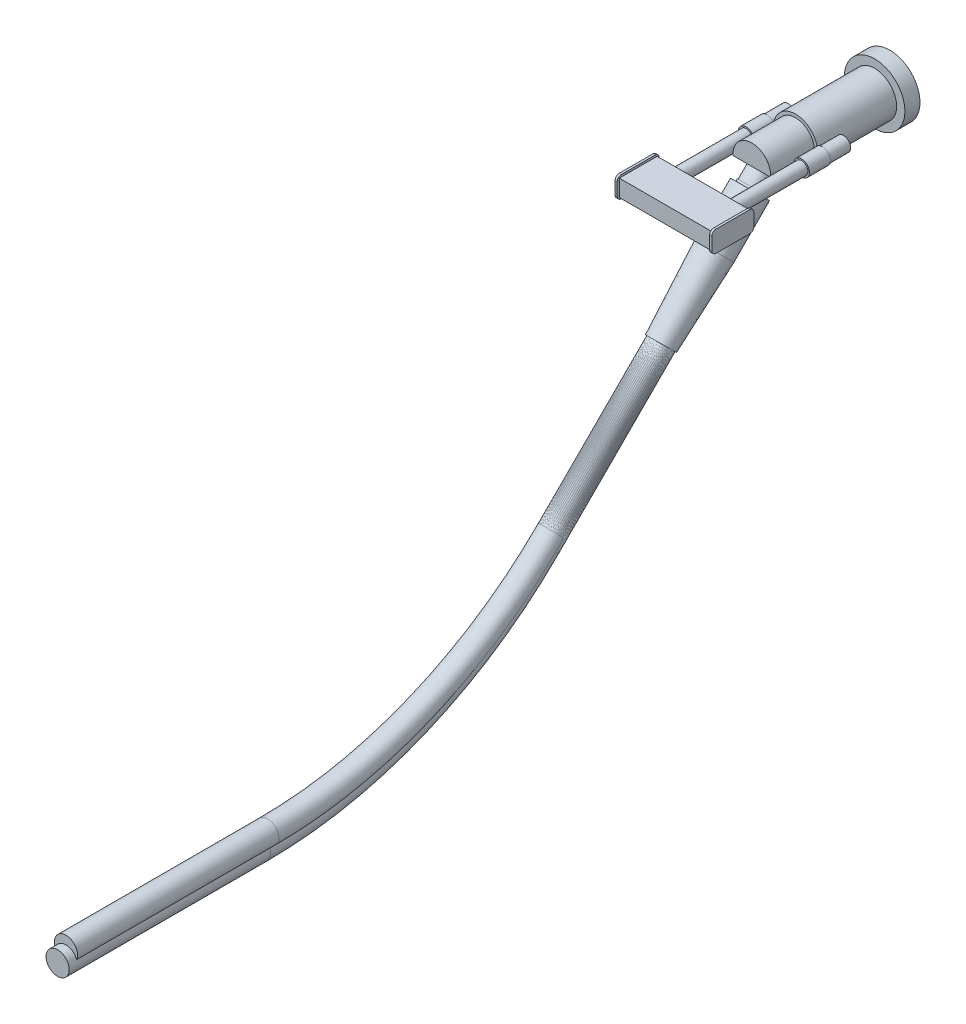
ISO-10303-21;
HEADER;
FILE_DESCRIPTION(('STEP AP214'),'2;1');
FILE_NAME('part.step','',(''),(''),'','','');
FILE_SCHEMA(('AUTOMOTIVE_DESIGN { 1 0 10303 214 1 1 1 1 }'));
ENDSEC;
DATA;
#1=APPLICATION_CONTEXT('core data for automotive mechanical design processes');
#2=APPLICATION_PROTOCOL_DEFINITION('international standard','automotive_design',2000,#1);
#3=PRODUCT_CONTEXT('',#1,'mechanical');
#4=PRODUCT('Part','Part','',(#3));
#5=PRODUCT_RELATED_PRODUCT_CATEGORY('part','',(#4));
#6=PRODUCT_DEFINITION_FORMATION('','',#4);
#7=PRODUCT_DEFINITION_CONTEXT('part definition',#1,'design');
#8=PRODUCT_DEFINITION('design','',#6,#7);
#9=PRODUCT_DEFINITION_SHAPE('','',#8);
#10=(LENGTH_UNIT() NAMED_UNIT(*) SI_UNIT(.MILLI.,.METRE.));
#11=(NAMED_UNIT(*) PLANE_ANGLE_UNIT() SI_UNIT($,.RADIAN.));
#12=(NAMED_UNIT(*) SI_UNIT($,.STERADIAN.) SOLID_ANGLE_UNIT());
#13=UNCERTAINTY_MEASURE_WITH_UNIT(LENGTH_MEASURE(1.E-05),#10,'distance_accuracy_value','');
#14=(GEOMETRIC_REPRESENTATION_CONTEXT(3) GLOBAL_UNCERTAINTY_ASSIGNED_CONTEXT((#13)) GLOBAL_UNIT_ASSIGNED_CONTEXT((#10,
#11,#12)) REPRESENTATION_CONTEXT('',''));
#15=CARTESIAN_POINT('',(0.,0.,0.));
#16=DIRECTION('',(0.,0.,1.));
#17=DIRECTION('',(1.,0.,0.));
#18=AXIS2_PLACEMENT_3D('',#15,#16,#17);
#19=CARTESIAN_POINT('',(0.,-329.452293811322,509.792293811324));
#20=DIRECTION('',(0.,0.707106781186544,-0.707106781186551));
#21=DIRECTION('',(0.,0.707106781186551,0.707106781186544));
#22=AXIS2_PLACEMENT_3D('',#19,#20,#21);
#23=CYLINDRICAL_SURFACE('',#22,17.4625);
#24=CARTESIAN_POINT('',(0.,-329.452293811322,509.792293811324));
#25=DIRECTION('',(0.,0.707106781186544,-0.707106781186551));
#26=DIRECTION('',(-1.,0.,0.));
#27=AXIS2_PLACEMENT_3D('',#24,#25,#26);
#28=CIRCLE('',#27,17.4625);
#29=CARTESIAN_POINT('',(0.,-341.800145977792,497.444441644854));
#30=VERTEX_POINT('',#29);
#31=EDGE_CURVE('E41',#30,#30,#28,.T.);
#32=ORIENTED_EDGE('',*,*,#31,.T.);
#33=EDGE_LOOP('',(#32));
#34=FACE_BOUND('',#33,.T.);
#35=CARTESIAN_POINT('',(0.,-164.542364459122,344.882364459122));
#36=DIRECTION('',(0.,0.707106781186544,-0.707106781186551));
#37=DIRECTION('',(-1.,0.,0.));
#38=AXIS2_PLACEMENT_3D('',#35,#36,#37);
#39=CIRCLE('',#38,17.4625);
#40=CARTESIAN_POINT('',(-17.4625,-164.542364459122,344.882364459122));
#41=VERTEX_POINT('',#40);
#42=EDGE_CURVE('E11',#41,#41,#39,.T.);
#43=ORIENTED_EDGE('',*,*,#42,.F.);
#44=EDGE_LOOP('',(#43));
#45=FACE_BOUND('',#44,.T.);
#46=ADVANCED_FACE('F35',(#34,#45),#23,.T.);
#47=CARTESIAN_POINT('',(0.,101.6,940.844587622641));
#48=DIRECTION('',(1.,0.,0.));
#49=DIRECTION('',(0.,0.,-1.));
#50=AXIS2_PLACEMENT_3D('',#47,#48,#49);
#51=TOROIDAL_SURFACE('',#50,609.6,17.4625);
#52=CARTESIAN_POINT('',(0.,-508.,940.844587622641));
#53=DIRECTION('',(0.,0.,-1.));
#54=DIRECTION('',(-1.,0.,0.));
#55=AXIS2_PLACEMENT_3D('',#52,#53,#54);
#56=CIRCLE('',#55,17.4625);
#57=CARTESIAN_POINT('',(0.,-525.4625,940.844587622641));
#58=VERTEX_POINT('',#57);
#59=EDGE_CURVE('E45',#58,#58,#56,.T.);
#60=CARTESIAN_POINT('',(0.,101.6,940.844587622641));
#61=DIRECTION('',(1.,0.,0.));
#62=DIRECTION('',(0.,0.,-1.));
#63=AXIS2_PLACEMENT_3D('',#60,#61,#62);
#64=CIRCLE('',#63,627.0625);
#65=EDGE_CURVE('',#58,#30,#64,.T.);
#66=ORIENTED_EDGE('',*,*,#59,.T.);
#67=ORIENTED_EDGE('',*,*,#31,.F.);
#68=ORIENTED_EDGE('',*,*,#65,.T.);
#69=ORIENTED_EDGE('',*,*,#65,.F.);
#70=EDGE_LOOP('',(#66,#68,#67,#69));
#71=FACE_BOUND('',#70,.T.);
#72=ADVANCED_FACE('F66',(#71),#51,.T.);
#73=CARTESIAN_POINT('',(0.,-508.,940.844587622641));
#74=DIRECTION('',(0.,0.,1.));
#75=DIRECTION('',(0.,-1.,0.));
#76=AXIS2_PLACEMENT_3D('',#73,#74,#75);
#77=CYLINDRICAL_SURFACE('',#76,17.4625);
#78=CARTESIAN_POINT('',(0.,-508.,1245.64458762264));
#79=DIRECTION('',(0.,0.,-1.));
#80=DIRECTION('',(-1.,0.,0.));
#81=AXIS2_PLACEMENT_3D('',#78,#79,#80);
#82=CIRCLE('',#81,17.4625);
#83=CARTESIAN_POINT('',(0.,-525.4625,1245.64458762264));
#84=VERTEX_POINT('',#83);
#85=EDGE_CURVE('E49',#84,#84,#82,.T.);
#86=CARTESIAN_POINT('',(0.,-525.4625,940.844587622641));
#87=CARTESIAN_POINT('',(0.,-525.4625,944.019587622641));
#88=CARTESIAN_POINT('',(0.,-525.4625,947.194587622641));
#89=CARTESIAN_POINT('',(0.,-525.4625,953.544587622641));
#90=CARTESIAN_POINT('',(0.,-525.4625,956.719587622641));
#91=CARTESIAN_POINT('',(0.,-525.4625,963.069587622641));
#92=CARTESIAN_POINT('',(0.,-525.4625,966.244587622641));
#93=CARTESIAN_POINT('',(0.,-525.4625,972.594587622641));
#94=CARTESIAN_POINT('',(0.,-525.4625,975.769587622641));
#95=CARTESIAN_POINT('',(0.,-525.4625,982.119587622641));
#96=CARTESIAN_POINT('',(0.,-525.4625,985.294587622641));
#97=CARTESIAN_POINT('',(0.,-525.4625,991.644587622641));
#98=CARTESIAN_POINT('',(0.,-525.4625,994.819587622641));
#99=CARTESIAN_POINT('',(0.,-525.4625,1001.16958762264));
#100=CARTESIAN_POINT('',(0.,-525.4625,1004.34458762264));
#101=CARTESIAN_POINT('',(0.,-525.4625,1010.69458762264));
#102=CARTESIAN_POINT('',(0.,-525.4625,1013.86958762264));
#103=CARTESIAN_POINT('',(0.,-525.4625,1020.21958762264));
#104=CARTESIAN_POINT('',(0.,-525.4625,1023.39458762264));
#105=CARTESIAN_POINT('',(0.,-525.4625,1029.74458762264));
#106=CARTESIAN_POINT('',(0.,-525.4625,1032.91958762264));
#107=CARTESIAN_POINT('',(0.,-525.4625,1039.26958762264));
#108=CARTESIAN_POINT('',(0.,-525.4625,1042.44458762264));
#109=CARTESIAN_POINT('',(0.,-525.4625,1048.79458762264));
#110=CARTESIAN_POINT('',(0.,-525.4625,1051.96958762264));
#111=CARTESIAN_POINT('',(0.,-525.4625,1058.31958762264));
#112=CARTESIAN_POINT('',(0.,-525.4625,1061.49458762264));
#113=CARTESIAN_POINT('',(0.,-525.4625,1067.84458762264));
#114=CARTESIAN_POINT('',(0.,-525.4625,1071.01958762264));
#115=CARTESIAN_POINT('',(0.,-525.4625,1077.36958762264));
#116=CARTESIAN_POINT('',(0.,-525.4625,1080.54458762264));
#117=CARTESIAN_POINT('',(0.,-525.4625,1086.89458762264));
#118=CARTESIAN_POINT('',(0.,-525.4625,1090.06958762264));
#119=CARTESIAN_POINT('',(0.,-525.4625,1096.41958762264));
#120=CARTESIAN_POINT('',(0.,-525.4625,1099.59458762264));
#121=CARTESIAN_POINT('',(0.,-525.4625,1105.94458762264));
#122=CARTESIAN_POINT('',(0.,-525.4625,1109.11958762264));
#123=CARTESIAN_POINT('',(0.,-525.4625,1115.46958762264));
#124=CARTESIAN_POINT('',(0.,-525.4625,1118.64458762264));
#125=CARTESIAN_POINT('',(0.,-525.4625,1124.99458762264));
#126=CARTESIAN_POINT('',(0.,-525.4625,1128.16958762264));
#127=CARTESIAN_POINT('',(0.,-525.4625,1134.51958762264));
#128=CARTESIAN_POINT('',(0.,-525.4625,1137.69458762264));
#129=CARTESIAN_POINT('',(0.,-525.4625,1144.04458762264));
#130=CARTESIAN_POINT('',(0.,-525.4625,1147.21958762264));
#131=CARTESIAN_POINT('',(0.,-525.4625,1153.56958762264));
#132=CARTESIAN_POINT('',(0.,-525.4625,1156.74458762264));
#133=CARTESIAN_POINT('',(0.,-525.4625,1163.09458762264));
#134=CARTESIAN_POINT('',(0.,-525.4625,1166.26958762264));
#135=CARTESIAN_POINT('',(0.,-525.4625,1172.61958762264));
#136=CARTESIAN_POINT('',(0.,-525.4625,1175.79458762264));
#137=CARTESIAN_POINT('',(0.,-525.4625,1182.14458762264));
#138=CARTESIAN_POINT('',(0.,-525.4625,1185.31958762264));
#139=CARTESIAN_POINT('',(0.,-525.4625,1191.66958762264));
#140=CARTESIAN_POINT('',(0.,-525.4625,1194.84458762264));
#141=CARTESIAN_POINT('',(0.,-525.4625,1201.19458762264));
#142=CARTESIAN_POINT('',(0.,-525.4625,1204.36958762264));
#143=CARTESIAN_POINT('',(0.,-525.4625,1210.71958762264));
#144=CARTESIAN_POINT('',(0.,-525.4625,1213.89458762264));
#145=CARTESIAN_POINT('',(0.,-525.4625,1220.24458762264));
#146=CARTESIAN_POINT('',(0.,-525.4625,1223.41958762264));
#147=CARTESIAN_POINT('',(0.,-525.4625,1229.76958762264));
#148=CARTESIAN_POINT('',(0.,-525.4625,1232.94458762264));
#149=CARTESIAN_POINT('',(0.,-525.4625,1239.29458762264));
#150=CARTESIAN_POINT('',(0.,-525.4625,1242.46958762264));
#151=CARTESIAN_POINT('',(0.,-525.4625,1245.64458762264));
#152=B_SPLINE_CURVE_WITH_KNOTS('',3,(#86,#87,#88,#89,#90,#91,#92,#93,#94,#95,#96,#97,#98,#99,
#100,#101,#102,#103,#104,#105,#106,#107,#108,#109,#110,#111,#112,#113,#114,#115,#116,#117,#118,
#119,#120,#121,#122,#123,#124,#125,#126,#127,#128,#129,#130,#131,#132,#133,#134,#135,#136,#137,
#138,#139,#140,#141,#142,#143,#144,#145,#146,#147,#148,#149,#150,#151),.UNSPECIFIED.,.F.,.F.,(4,
2,2,2,2,2,2,2,2,2,2,2,2,2,2,2,2,2,2,2,2,2,2,2,2,2,2,2,2,2,2,2,4),(0.,9.52500000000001,19.05,
28.575,38.1,47.625,57.15,66.6750000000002,76.2000000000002,85.7250000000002,95.2499999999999,
104.775,114.3,123.825,133.35,142.875,152.4,161.925,171.45,180.975,190.5,200.025,209.55,219.075,
228.6,238.125,247.65,257.175,266.7,276.225,285.75,295.275,304.8),.UNSPECIFIED.);
#153=EDGE_CURVE('BSEAM55',#58,#84,#152,.T.);
#154=ORIENTED_EDGE('',*,*,#59,.F.);
#155=ORIENTED_EDGE('',*,*,#85,.T.);
#156=ORIENTED_EDGE('',*,*,#153,.T.);
#157=ORIENTED_EDGE('',*,*,#153,.F.);
#158=EDGE_LOOP('',(#154,#156,#155,#157));
#159=FACE_BOUND('',#158,.T.);
#160=ADVANCED_FACE('F55',(#159),#77,.T.);
#161=CARTESIAN_POINT('',(0.,-164.542364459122,344.882364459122));
#162=DIRECTION('',(0.,0.707106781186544,-0.707106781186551));
#163=DIRECTION('',(-1.,0.,0.));
#164=AXIS2_PLACEMENT_3D('',#161,#162,#163);
#165=PLANE('',#164);
#166=ORIENTED_EDGE('',*,*,#42,.T.);
#167=EDGE_LOOP('',(#166));
#168=FACE_BOUND('',#167,.T.);
#169=ADVANCED_FACE('F59',(#168),#165,.T.);
#170=CARTESIAN_POINT('',(0.,-508.,1245.64458762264));
#171=DIRECTION('',(0.,0.,-1.));
#172=DIRECTION('',(-1.,0.,0.));
#173=AXIS2_PLACEMENT_3D('',#170,#171,#172);
#174=PLANE('',#173);
#175=ORIENTED_EDGE('',*,*,#85,.F.);
#176=EDGE_LOOP('',(#175));
#177=FACE_BOUND('',#176,.T.);
#178=ADVANCED_FACE('F57',(#177),#174,.F.);
#179=CLOSED_SHELL('',(#46,#72,#160,#169,#178));
#180=MANIFOLD_SOLID_BREP('B2',#179);
#181=CARTESIAN_POINT('',(0.,-342.152293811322,522.492293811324));
#182=DIRECTION('',(0.,0.707106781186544,-0.707106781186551));
#183=DIRECTION('',(0.,0.707106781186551,0.707106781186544));
#184=AXIS2_PLACEMENT_3D('',#181,#182,#183);
#185=CYLINDRICAL_SURFACE('',#184,17.4625);
#186=CARTESIAN_POINT('',(0.,-342.152293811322,522.492293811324));
#187=DIRECTION('',(0.,0.707106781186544,-0.707106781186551));
#188=DIRECTION('',(-1.,0.,0.));
#189=AXIS2_PLACEMENT_3D('',#186,#187,#188);
#190=CIRCLE('',#189,17.4625);
#191=CARTESIAN_POINT('',(0.,-354.500145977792,510.144441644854));
#192=VERTEX_POINT('',#191);
#193=EDGE_CURVE('E109',#192,#192,#190,.T.);
#194=ORIENTED_EDGE('',*,*,#193,.T.);
#195=EDGE_LOOP('',(#194));
#196=FACE_BOUND('',#195,.T.);
#197=CARTESIAN_POINT('',(0.,-164.542364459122,344.882364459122));
#198=DIRECTION('',(0.,0.707106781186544,-0.707106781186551));
#199=DIRECTION('',(-1.,0.,0.));
#200=AXIS2_PLACEMENT_3D('',#197,#198,#199);
#201=CIRCLE('',#200,17.4625);
#202=CARTESIAN_POINT('',(-17.4625,-164.542364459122,344.882364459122));
#203=VERTEX_POINT('',#202);
#204=EDGE_CURVE('E34',#203,#203,#201,.T.);
#205=ORIENTED_EDGE('',*,*,#204,.F.);
#206=EDGE_LOOP('',(#205));
#207=FACE_BOUND('',#206,.T.);
#208=ADVANCED_FACE('F103',(#196,#207),#185,.T.);
#209=CARTESIAN_POINT('',(0.,88.9000000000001,953.544587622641));
#210=DIRECTION('',(1.,0.,0.));
#211=DIRECTION('',(0.,0.,-1.));
#212=AXIS2_PLACEMENT_3D('',#209,#210,#211);
#213=TOROIDAL_SURFACE('',#212,609.6,17.4625);
#214=CARTESIAN_POINT('',(0.,-520.7,953.544587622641));
#215=DIRECTION('',(0.,0.,-1.));
#216=DIRECTION('',(-1.,0.,0.));
#217=AXIS2_PLACEMENT_3D('',#214,#215,#216);
#218=CIRCLE('',#217,17.4625);
#219=CARTESIAN_POINT('',(0.,-538.1625,953.544587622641));
#220=VERTEX_POINT('',#219);
#221=EDGE_CURVE('E113',#220,#220,#218,.T.);
#222=CARTESIAN_POINT('',(0.,88.9000000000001,953.544587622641));
#223=DIRECTION('',(1.,0.,0.));
#224=DIRECTION('',(0.,0.,-1.));
#225=AXIS2_PLACEMENT_3D('',#222,#223,#224);
#226=CIRCLE('',#225,627.0625);
#227=EDGE_CURVE('',#220,#192,#226,.T.);
#228=ORIENTED_EDGE('',*,*,#221,.T.);
#229=ORIENTED_EDGE('',*,*,#193,.F.);
#230=ORIENTED_EDGE('',*,*,#227,.T.);
#231=ORIENTED_EDGE('',*,*,#227,.F.);
#232=EDGE_LOOP('',(#228,#230,#229,#231));
#233=FACE_BOUND('',#232,.T.);
#234=ADVANCED_FACE('F134',(#233),#213,.T.);
#235=CARTESIAN_POINT('',(0.,-520.7,953.544587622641));
#236=DIRECTION('',(0.,0.,1.));
#237=DIRECTION('',(0.,-1.,0.));
#238=AXIS2_PLACEMENT_3D('',#235,#236,#237);
#239=CYLINDRICAL_SURFACE('',#238,17.4625);
#240=ORIENTED_EDGE('',*,*,#221,.F.);
#241=EDGE_LOOP('',(#240));
#242=FACE_BOUND('',#241,.T.);
#243=CARTESIAN_POINT('',(0.,-520.7,1258.34458762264));
#244=DIRECTION('',(0.,0.,-1.));
#245=DIRECTION('',(-1.,0.,0.));
#246=AXIS2_PLACEMENT_3D('',#243,#244,#245);
#247=CIRCLE('',#246,17.4625);
#248=CARTESIAN_POINT('',(-17.4625,-520.7,1258.34458762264));
#249=VERTEX_POINT('',#248);
#250=EDGE_CURVE('E117',#249,#249,#247,.T.);
#251=ORIENTED_EDGE('',*,*,#250,.T.);
#252=EDGE_LOOP('',(#251));
#253=FACE_BOUND('',#252,.T.);
#254=ADVANCED_FACE('F123',(#242,#253),#239,.T.);
#255=CARTESIAN_POINT('',(0.,-164.542364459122,344.882364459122));
#256=DIRECTION('',(0.,0.707106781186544,-0.707106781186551));
#257=DIRECTION('',(-1.,0.,0.));
#258=AXIS2_PLACEMENT_3D('',#255,#256,#257);
#259=PLANE('',#258);
#260=ORIENTED_EDGE('',*,*,#204,.T.);
#261=EDGE_LOOP('',(#260));
#262=FACE_BOUND('',#261,.T.);
#263=ADVANCED_FACE('F127',(#262),#259,.T.);
#264=CARTESIAN_POINT('',(0.,-520.7,1258.34458762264));
#265=DIRECTION('',(0.,0.,-1.));
#266=DIRECTION('',(-1.,0.,0.));
#267=AXIS2_PLACEMENT_3D('',#264,#265,#266);
#268=PLANE('',#267);
#269=ORIENTED_EDGE('',*,*,#250,.F.);
#270=EDGE_LOOP('',(#269));
#271=FACE_BOUND('',#270,.T.);
#272=ADVANCED_FACE('F125',(#271),#268,.F.);
#273=CLOSED_SHELL('',(#208,#234,#254,#263,#272));
#274=MANIFOLD_SOLID_BREP('B6',#273);
#275=CARTESIAN_POINT('',(8.88178419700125E-13,-15.2664354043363,195.606435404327));
#276=DIRECTION('',(0.,-0.707106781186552,0.707106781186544));
#277=DIRECTION('',(0.,-0.707106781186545,-0.707106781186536));
#278=AXIS2_PLACEMENT_3D('',#275,#276,#277);
#279=PLANE('',#278);
#280=CARTESIAN_POINT('',(8.88178419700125E-13,-15.2664354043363,195.606435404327));
#281=DIRECTION('',(0.,-0.707106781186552,0.707106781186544));
#282=DIRECTION('',(0.,-0.707106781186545,-0.707106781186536));
#283=AXIS2_PLACEMENT_3D('',#280,#281,#282);
#284=CIRCLE('',#283,16.5099999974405);
#285=CARTESIAN_POINT('',(9.30107796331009E-13,-26.9407683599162,183.932102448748));
#286=VERTEX_POINT('',#285);
#287=EDGE_CURVE('E102',#286,#286,#284,.T.);
#288=ORIENTED_EDGE('',*,*,#287,.F.);
#289=EDGE_LOOP('',(#288));
#290=FACE_BOUND('',#289,.T.);
#291=ADVANCED_FACE('F173',(#290),#279,.F.);
#292=CARTESIAN_POINT('',(8.88178419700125E-13,-165.685725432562,346.025725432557));
#293=DIRECTION('',(0.,-0.707106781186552,0.707106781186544));
#294=DIRECTION('',(0.,-0.707106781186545,-0.707106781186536));
#295=AXIS2_PLACEMENT_3D('',#292,#293,#294);
#296=CYLINDRICAL_SURFACE('',#295,16.5099999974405);
#297=CARTESIAN_POINT('',(4.44089209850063E-13,-28.7368195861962,209.076819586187));
#298=DIRECTION('',(0.,-0.707106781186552,0.707106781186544));
#299=DIRECTION('',(0.,-0.707106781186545,-0.707106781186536));
#300=AXIS2_PLACEMENT_3D('',#297,#298,#299);
#301=CIRCLE('',#300,16.5099999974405);
#302=CARTESIAN_POINT('',(4.86018586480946E-13,-40.4111525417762,197.402486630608));
#303=VERTEX_POINT('',#302);
#304=EDGE_CURVE('E179',#303,#303,#301,.T.);
#305=ORIENTED_EDGE('',*,*,#304,.F.);
#306=EDGE_LOOP('',(#305));
#307=FACE_BOUND('',#306,.T.);
#308=ORIENTED_EDGE('',*,*,#287,.T.);
#309=EDGE_LOOP('',(#308));
#310=FACE_BOUND('',#309,.T.);
#311=ADVANCED_FACE('F230',(#307,#310),#296,.T.);
#312=CARTESIAN_POINT('',(8.88178419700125E-13,-17.0624866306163,220.751152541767));
#313=DIRECTION('',(0.,-0.707106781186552,0.707106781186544));
#314=DIRECTION('',(0.,-0.707106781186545,-0.707106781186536));
#315=AXIS2_PLACEMENT_3D('',#312,#313,#314);
#316=PLANE('',#315);
#317=CARTESIAN_POINT('',(4.44089209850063E-13,-28.7368195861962,209.076819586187));
#318=DIRECTION('',(0.,-0.707106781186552,0.707106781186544));
#319=DIRECTION('',(0.,-0.707106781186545,-0.707106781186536));
#320=AXIS2_PLACEMENT_3D('',#317,#318,#319);
#321=CIRCLE('',#320,17.4624999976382);
#322=CARTESIAN_POINT('',(4.88437588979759E-13,-41.0846717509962,196.728967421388));
#323=VERTEX_POINT('',#322);
#324=EDGE_CURVE('E183',#323,#323,#321,.T.);
#325=ORIENTED_EDGE('',*,*,#324,.F.);
#326=EDGE_LOOP('',(#325));
#327=FACE_BOUND('',#326,.T.);
#328=ORIENTED_EDGE('',*,*,#304,.T.);
#329=EDGE_LOOP('',(#328));
#330=FACE_BOUND('',#329,.T.);
#331=ADVANCED_FACE('F225',(#327,#330),#316,.F.);
#332=CARTESIAN_POINT('',(8.88178419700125E-13,-165.685725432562,346.025725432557));
#333=DIRECTION('',(0.,-0.707106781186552,0.707106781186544));
#334=DIRECTION('',(0.,-0.707106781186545,-0.707106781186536));
#335=AXIS2_PLACEMENT_3D('',#332,#333,#334);
#336=CYLINDRICAL_SURFACE('',#335,17.4624999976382);
#337=CARTESIAN_POINT('',(2.88657986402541E-12,-30.9818836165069,211.321883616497));
#338=DIRECTION('',(0.,-0.707106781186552,0.707106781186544));
#339=DIRECTION('',(0.,-0.707106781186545,-0.707106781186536));
#340=AXIS2_PLACEMENT_3D('',#337,#338,#339);
#341=CIRCLE('',#340,17.4624999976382);
#342=CARTESIAN_POINT('',(2.9309282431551E-12,-43.3297357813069,198.974031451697));
#343=VERTEX_POINT('',#342);
#344=EDGE_CURVE('E187',#343,#343,#341,.T.);
#345=ORIENTED_EDGE('',*,*,#344,.F.);
#346=EDGE_LOOP('',(#345));
#347=FACE_BOUND('',#346,.T.);
#348=ORIENTED_EDGE('',*,*,#324,.T.);
#349=EDGE_LOOP('',(#348));
#350=FACE_BOUND('',#349,.T.);
#351=ADVANCED_FACE('F219',(#347,#350),#336,.T.);
#352=CARTESIAN_POINT('',(4.44089209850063E-13,-18.6340314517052,223.669735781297));
#353=DIRECTION('',(0.,-0.707106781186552,0.707106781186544));
#354=DIRECTION('',(0.,-0.707106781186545,-0.707106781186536));
#355=AXIS2_PLACEMENT_3D('',#352,#353,#354);
#356=PLANE('',#355);
#357=CARTESIAN_POINT('',(2.88657986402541E-12,-30.9818836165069,211.321883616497));
#358=DIRECTION('',(0.,-0.707106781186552,0.707106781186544));
#359=DIRECTION('',(0.,-0.707106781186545,-0.707106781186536));
#360=AXIS2_PLACEMENT_3D('',#357,#358,#359);
#361=CIRCLE('',#360,24.1299999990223);
#362=CARTESIAN_POINT('',(2.94786126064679E-12,-48.0443702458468,194.259396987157));
#363=VERTEX_POINT('',#362);
#364=EDGE_CURVE('E192',#363,#363,#361,.T.);
#365=ORIENTED_EDGE('',*,*,#364,.F.);
#366=EDGE_LOOP('',(#365));
#367=FACE_BOUND('',#366,.T.);
#368=ORIENTED_EDGE('',*,*,#344,.T.);
#369=EDGE_LOOP('',(#368));
#370=FACE_BOUND('',#369,.T.);
#371=ADVANCED_FACE('F213',(#367,#370),#356,.F.);
#372=CARTESIAN_POINT('',(8.88178419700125E-13,-165.685725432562,346.025725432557));
#373=DIRECTION('',(0.,-0.707106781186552,0.707106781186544));
#374=DIRECTION('',(0.,-0.707106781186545,-0.707106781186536));
#375=AXIS2_PLACEMENT_3D('',#372,#373,#374);
#376=CYLINDRICAL_SURFACE('',#375,24.1299999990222);
#377=CARTESIAN_POINT('',(0.,-84.8634203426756,265.203420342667));
#378=DIRECTION('',(0.,-0.707106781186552,0.707106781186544));
#379=DIRECTION('',(0.,-0.707106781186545,-0.707106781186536));
#380=AXIS2_PLACEMENT_3D('',#377,#378,#379);
#381=CIRCLE('',#380,24.1299999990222);
#382=CARTESIAN_POINT('',(0.,-101.925906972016,248.140933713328));
#383=VERTEX_POINT('',#382);
#384=EDGE_CURVE('E195',#383,#383,#381,.T.);
#385=ORIENTED_EDGE('',*,*,#384,.F.);
#386=EDGE_LOOP('',(#385));
#387=FACE_BOUND('',#386,.T.);
#388=ORIENTED_EDGE('',*,*,#364,.T.);
#389=EDGE_LOOP('',(#388));
#390=FACE_BOUND('',#389,.T.);
#391=ADVANCED_FACE('F207',(#387,#390),#376,.T.);
#392=CARTESIAN_POINT('',(0.,-84.8634203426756,265.203420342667));
#393=DIRECTION('',(0.,0.707106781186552,-0.707106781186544));
#394=DIRECTION('',(0.,0.707106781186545,0.707106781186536));
#395=AXIS2_PLACEMENT_3D('',#392,#393,#394);
#396=CONICAL_SURFACE('',#395,24.1299999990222,0.0436332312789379);
#397=CARTESIAN_POINT('',(8.88178419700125E-13,-165.685725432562,346.025725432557));
#398=DIRECTION('',(0.,-0.707106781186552,0.707106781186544));
#399=DIRECTION('',(0.,-0.707106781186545,-0.707106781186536));
#400=AXIS2_PLACEMENT_3D('',#397,#398,#399);
#401=CIRCLE('',#400,19.1395542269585);
#402=CARTESIAN_POINT('',(9.36785904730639E-13,-179.219434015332,332.492016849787));
#403=VERTEX_POINT('',#402);
#404=EDGE_CURVE('E198',#403,#403,#401,.T.);
#405=ORIENTED_EDGE('',*,*,#404,.F.);
#406=EDGE_LOOP('',(#405));
#407=FACE_BOUND('',#406,.T.);
#408=ORIENTED_EDGE('',*,*,#384,.T.);
#409=EDGE_LOOP('',(#408));
#410=FACE_BOUND('',#409,.T.);
#411=ADVANCED_FACE('F204',(#407,#410),#396,.T.);
#412=CARTESIAN_POINT('',(8.88178419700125E-13,-165.685725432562,346.025725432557));
#413=DIRECTION('',(0.,0.707106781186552,-0.707106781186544));
#414=DIRECTION('',(0.,0.707106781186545,0.707106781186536));
#415=AXIS2_PLACEMENT_3D('',#412,#413,#414);
#416=PLANE('',#415);
#417=ORIENTED_EDGE('',*,*,#404,.T.);
#418=EDGE_LOOP('',(#417));
#419=FACE_BOUND('',#418,.T.);
#420=ADVANCED_FACE('F202',(#419),#416,.F.);
#421=CLOSED_SHELL('',(#291,#311,#331,#351,#371,#391,#411,#420));
#422=MANIFOLD_SOLID_BREP('B29',#421);
#423=CARTESIAN_POINT('',(0.,0.,208.533999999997));
#424=DIRECTION('',(0.,0.,-0.999999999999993));
#425=DIRECTION('',(-1.,0.,0.));
#426=AXIS2_PLACEMENT_3D('',#423,#424,#425);
#427=CYLINDRICAL_SURFACE('',#426,28.448);
#428=CARTESIAN_POINT('',(0.,-6.88338275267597E-12,142.493999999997));
#429=DIRECTION('',(0.,0.,0.999999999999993));
#430=DIRECTION('',(1.,0.,0.));
#431=AXIS2_PLACEMENT_3D('',#428,#429,#430);
#432=CIRCLE('',#431,28.448);
#433=CARTESIAN_POINT('',(28.448,-6.98050239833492E-12,142.493999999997));
#434=VERTEX_POINT('',#433);
#435=EDGE_CURVE('E287',#434,#434,#432,.T.);
#436=ORIENTED_EDGE('',*,*,#435,.T.);
#437=EDGE_LOOP('',(#436));
#438=FACE_BOUND('',#437,.T.);
#439=CARTESIAN_POINT('',(0.,0.,210.872870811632));
#440=DIRECTION('',(0.,-0.707106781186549,0.707106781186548));
#441=DIRECTION('',(0.,-0.707106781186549,-0.707106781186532));
#442=AXIS2_PLACEMENT_3D('',#439,#440,#441);
#443=ELLIPSE('',#442,40.2315474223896,28.448);
#444=CARTESIAN_POINT('',(28.3516910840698,-2.33887081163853,208.533999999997));
#445=VERTEX_POINT('',#444);
#446=CARTESIAN_POINT('',(-28.3516910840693,-2.33887081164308,208.533999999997));
#447=VERTEX_POINT('',#446);
#448=EDGE_CURVE('E293',#445,#447,#443,.F.);
#449=ORIENTED_EDGE('',*,*,#448,.T.);
#450=CARTESIAN_POINT('',(0.,0.,208.533999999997));
#451=DIRECTION('',(0.,0.,0.999999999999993));
#452=DIRECTION('',(1.,0.,0.));
#453=AXIS2_PLACEMENT_3D('',#450,#451,#452);
#454=CIRCLE('',#453,28.448);
#455=EDGE_CURVE('E171',#445,#447,#454,.T.);
#456=ORIENTED_EDGE('',*,*,#455,.F.);
#457=EDGE_LOOP('',(#449,#456));
#458=FACE_BOUND('',#457,.T.);
#459=ADVANCED_FACE('F280',(#438,#458),#427,.T.);
#460=CARTESIAN_POINT('',(0.,0.,208.533999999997));
#461=DIRECTION('',(0.,0.,0.999999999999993));
#462=DIRECTION('',(1.,0.,0.));
#463=AXIS2_PLACEMENT_3D('',#460,#461,#462);
#464=PLANE('',#463);
#465=ORIENTED_EDGE('',*,*,#455,.T.);
#466=DIRECTION('',(-1.,0.,0.));
#467=VECTOR('',#466,1.);
#468=CARTESIAN_POINT('',(73.1530000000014,-2.33887081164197,208.533999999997));
#469=LINE('',#468,#467);
#470=EDGE_CURVE('E295',#445,#447,#469,.T.);
#471=ORIENTED_EDGE('',*,*,#470,.F.);
#472=EDGE_LOOP('',(#465,#471));
#473=FACE_BOUND('',#472,.T.);
#474=ADVANCED_FACE('F302',(#473),#464,.T.);
#475=CARTESIAN_POINT('',(0.,-6.88338275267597E-12,142.493999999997));
#476=DIRECTION('',(0.,0.,0.999999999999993));
#477=DIRECTION('',(1.,0.,0.));
#478=AXIS2_PLACEMENT_3D('',#475,#476,#477);
#479=PLANE('',#478);
#480=ORIENTED_EDGE('',*,*,#435,.F.);
#481=EDGE_LOOP('',(#480));
#482=FACE_BOUND('',#481,.T.);
#483=ADVANCED_FACE('F304',(#482),#479,.F.);
#484=CARTESIAN_POINT('',(73.1530000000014,-2.33887081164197,208.533999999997));
#485=DIRECTION('',(0.,-0.707106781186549,0.707106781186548));
#486=DIRECTION('',(0.,-0.707106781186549,-0.707106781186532));
#487=AXIS2_PLACEMENT_3D('',#484,#485,#486);
#488=PLANE('',#487);
#489=ORIENTED_EDGE('',*,*,#470,.T.);
#490=ORIENTED_EDGE('',*,*,#448,.F.);
#491=EDGE_LOOP('',(#489,#490));
#492=FACE_BOUND('',#491,.T.);
#493=ADVANCED_FACE('F296',(#492),#488,.T.);
#494=CLOSED_SHELL('',(#459,#474,#483,#493));
#495=MANIFOLD_SOLID_BREP('B97',#494);
#496=CARTESIAN_POINT('',(-41.9099999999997,-4.88498130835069E-12,111.759999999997));
#497=DIRECTION('',(0.,0.,0.999999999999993));
#498=DIRECTION('',(-1.,0.,0.));
#499=AXIS2_PLACEMENT_3D('',#496,#497,#498);
#500=CYLINDRICAL_SURFACE('',#499,10.795);
#501=CARTESIAN_POINT('',(-41.9099999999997,-4.88498130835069E-12,111.759999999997));
#502=DIRECTION('',(0.,0.,-0.999999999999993));
#503=DIRECTION('',(-1.,0.,0.));
#504=AXIS2_PLACEMENT_3D('',#501,#502,#503);
#505=CIRCLE('',#504,10.795);
#506=CARTESIAN_POINT('',(-52.7049999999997,-4.84812787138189E-12,111.759999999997));
#507=VERTEX_POINT('',#506);
#508=EDGE_CURVE('E279',#507,#507,#505,.T.);
#509=CARTESIAN_POINT('',(-41.9100000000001,-4.88498130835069E-12,143.509999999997));
#510=DIRECTION('',(0.,0.,-0.999999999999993));
#511=DIRECTION('',(-1.,0.,0.));
#512=AXIS2_PLACEMENT_3D('',#509,#510,#511);
#513=CIRCLE('',#512,10.795);
#514=CARTESIAN_POINT('',(-52.7049999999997,-4.85626818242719E-12,143.509999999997));
#515=VERTEX_POINT('',#514);
#516=EDGE_CURVE('E346',#515,#515,#513,.T.);
#517=CARTESIAN_POINT('',(-52.7049999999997,-4.84812787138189E-12,111.759999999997));
#518=CARTESIAN_POINT('',(-52.7049999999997,-4.84821266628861E-12,112.090729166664));
#519=CARTESIAN_POINT('',(-52.7049999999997,-4.84829746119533E-12,112.421458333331));
#520=CARTESIAN_POINT('',(-52.7049999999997,-4.84846705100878E-12,113.082916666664));
#521=CARTESIAN_POINT('',(-52.7049999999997,-4.8485518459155E-12,113.413645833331));
#522=CARTESIAN_POINT('',(-52.7049999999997,-4.84872143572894E-12,114.075104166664));
#523=CARTESIAN_POINT('',(-52.7049999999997,-4.84880623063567E-12,114.405833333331));
#524=CARTESIAN_POINT('',(-52.7049999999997,-4.84897582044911E-12,115.067291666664));
#525=CARTESIAN_POINT('',(-52.7049999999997,-4.84906061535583E-12,115.398020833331));
#526=CARTESIAN_POINT('',(-52.7049999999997,-4.84923020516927E-12,116.059479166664));
#527=CARTESIAN_POINT('',(-52.7049999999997,-4.849315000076E-12,116.390208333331));
#528=CARTESIAN_POINT('',(-52.7049999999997,-4.84948458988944E-12,117.051666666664));
#529=CARTESIAN_POINT('',(-52.7049999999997,-4.84956938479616E-12,117.382395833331));
#530=CARTESIAN_POINT('',(-52.7049999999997,-4.84973897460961E-12,118.043854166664));
#531=CARTESIAN_POINT('',(-52.7049999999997,-4.84982376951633E-12,118.374583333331));
#532=CARTESIAN_POINT('',(-52.7049999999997,-4.84999335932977E-12,119.036041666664));
#533=CARTESIAN_POINT('',(-52.7049999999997,-4.85007815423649E-12,119.366770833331));
#534=CARTESIAN_POINT('',(-52.7049999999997,-4.85024774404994E-12,120.028229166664));
#535=CARTESIAN_POINT('',(-52.7049999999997,-4.85033253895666E-12,120.358958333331));
#536=CARTESIAN_POINT('',(-52.7049999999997,-4.8505021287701E-12,121.020416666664));
#537=CARTESIAN_POINT('',(-52.7049999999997,-4.85058692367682E-12,121.351145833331));
#538=CARTESIAN_POINT('',(-52.7049999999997,-4.85075651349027E-12,122.012604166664));
#539=CARTESIAN_POINT('',(-52.7049999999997,-4.85084130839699E-12,122.343333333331));
#540=CARTESIAN_POINT('',(-52.7049999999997,-4.85101089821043E-12,123.004791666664));
#541=CARTESIAN_POINT('',(-52.7049999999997,-4.85109569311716E-12,123.335520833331));
#542=CARTESIAN_POINT('',(-52.7049999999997,-4.8512652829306E-12,123.996979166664));
#543=CARTESIAN_POINT('',(-52.7049999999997,-4.85135007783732E-12,124.327708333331));
#544=CARTESIAN_POINT('',(-52.7049999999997,-4.85151966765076E-12,124.989166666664));
#545=CARTESIAN_POINT('',(-52.7049999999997,-4.85160446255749E-12,125.319895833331));
#546=CARTESIAN_POINT('',(-52.7049999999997,-4.85177405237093E-12,125.981354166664));
#547=CARTESIAN_POINT('',(-52.7049999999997,-4.85185884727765E-12,126.312083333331));
#548=CARTESIAN_POINT('',(-52.7049999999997,-4.8520284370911E-12,126.973541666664));
#549=CARTESIAN_POINT('',(-52.7049999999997,-4.85211323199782E-12,127.304270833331));
#550=CARTESIAN_POINT('',(-52.7049999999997,-4.85228282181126E-12,127.965729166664));
#551=CARTESIAN_POINT('',(-52.7049999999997,-4.85236761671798E-12,128.296458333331));
#552=CARTESIAN_POINT('',(-52.7049999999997,-4.85253720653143E-12,128.957916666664));
#553=CARTESIAN_POINT('',(-52.7049999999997,-4.85262200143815E-12,129.288645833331));
#554=CARTESIAN_POINT('',(-52.7049999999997,-4.85279159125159E-12,129.950104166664));
#555=CARTESIAN_POINT('',(-52.7049999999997,-4.85287638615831E-12,130.280833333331));
#556=CARTESIAN_POINT('',(-52.7049999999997,-4.85304597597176E-12,130.942291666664));
#557=CARTESIAN_POINT('',(-52.7049999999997,-4.85313077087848E-12,131.273020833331));
#558=CARTESIAN_POINT('',(-52.7049999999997,-4.85330036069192E-12,131.934479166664));
#559=CARTESIAN_POINT('',(-52.7049999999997,-4.85338515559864E-12,132.265208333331));
#560=CARTESIAN_POINT('',(-52.7049999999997,-4.85355474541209E-12,132.926666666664));
#561=CARTESIAN_POINT('',(-52.7049999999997,-4.85363954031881E-12,133.257395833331));
#562=CARTESIAN_POINT('',(-52.7049999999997,-4.85380913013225E-12,133.918854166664));
#563=CARTESIAN_POINT('',(-52.7049999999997,-4.85389392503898E-12,134.249583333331));
#564=CARTESIAN_POINT('',(-52.7049999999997,-4.85406351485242E-12,134.911041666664));
#565=CARTESIAN_POINT('',(-52.7049999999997,-4.85414830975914E-12,135.241770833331));
#566=CARTESIAN_POINT('',(-52.7049999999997,-4.85431789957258E-12,135.903229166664));
#567=CARTESIAN_POINT('',(-52.7049999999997,-4.85440269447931E-12,136.233958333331));
#568=CARTESIAN_POINT('',(-52.7049999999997,-4.85457228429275E-12,136.895416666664));
#569=CARTESIAN_POINT('',(-52.7049999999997,-4.85465707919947E-12,137.226145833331));
#570=CARTESIAN_POINT('',(-52.7049999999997,-4.85482666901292E-12,137.887604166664));
#571=CARTESIAN_POINT('',(-52.7049999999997,-4.85491146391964E-12,138.218333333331));
#572=CARTESIAN_POINT('',(-52.7049999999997,-4.85508105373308E-12,138.879791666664));
#573=CARTESIAN_POINT('',(-52.7049999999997,-4.8551658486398E-12,139.210520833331));
#574=CARTESIAN_POINT('',(-52.7049999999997,-4.85533543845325E-12,139.871979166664));
#575=CARTESIAN_POINT('',(-52.7049999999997,-4.85542023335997E-12,140.202708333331));
#576=CARTESIAN_POINT('',(-52.7049999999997,-4.85558982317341E-12,140.864166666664));
#577=CARTESIAN_POINT('',(-52.7049999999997,-4.85567461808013E-12,141.194895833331));
#578=CARTESIAN_POINT('',(-52.7049999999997,-4.85584420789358E-12,141.856354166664));
#579=CARTESIAN_POINT('',(-52.7049999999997,-4.8559290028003E-12,142.187083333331));
#580=CARTESIAN_POINT('',(-52.7049999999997,-4.85609859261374E-12,142.848541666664));
#581=CARTESIAN_POINT('',(-52.7049999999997,-4.85618338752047E-12,143.179270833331));
#582=CARTESIAN_POINT('',(-52.7049999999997,-4.85626818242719E-12,143.509999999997));
#583=B_SPLINE_CURVE_WITH_KNOTS('',3,(#517,#518,#519,#520,#521,#522,#523,#524,#525,#526,#527,
#528,#529,#530,#531,#532,#533,#534,#535,#536,#537,#538,#539,#540,#541,#542,#543,#544,#545,#546,
#547,#548,#549,#550,#551,#552,#553,#554,#555,#556,#557,#558,#559,#560,#561,#562,#563,#564,#565,
#566,#567,#568,#569,#570,#571,#572,#573,#574,#575,#576,#577,#578,#579,#580,#581,#582),
.UNSPECIFIED.,.F.,.F.,(4,2,2,2,2,2,2,2,2,2,2,2,2,2,2,2,2,2,2,2,2,2,2,2,2,2,2,2,2,2,2,2,4),(0.,
0.992187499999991,1.984375,2.9765625,3.96875000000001,4.96093750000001,5.95312500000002,
6.94531250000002,7.93750000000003,8.92968750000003,9.92187500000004,10.9140625,11.90625,
12.8984375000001,13.8906250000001,14.8828125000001,15.8750000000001,16.8671875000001,
17.8593750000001,18.8515625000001,19.8437500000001,20.8359375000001,21.8281250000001,
22.8203125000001,23.8125000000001,24.8046875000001,25.7968750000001,26.7890625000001,
27.7812500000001,28.7734375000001,29.7656250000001,30.7578125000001,31.7500000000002),.UNSPECIFIED.);
#584=EDGE_CURVE('BSEAM340',#507,#515,#583,.T.);
#585=ORIENTED_EDGE('',*,*,#508,.F.);
#586=ORIENTED_EDGE('',*,*,#516,.T.);
#587=ORIENTED_EDGE('',*,*,#584,.T.);
#588=ORIENTED_EDGE('',*,*,#584,.F.);
#589=EDGE_LOOP('',(#585,#587,#586,#588));
#590=FACE_BOUND('',#589,.T.);
#591=ADVANCED_FACE('F340',(#590),#500,.T.);
#592=CARTESIAN_POINT('',(-41.9099999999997,-4.88498130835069E-12,111.759999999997));
#593=DIRECTION('',(0.,0.,0.999999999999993));
#594=DIRECTION('',(-1.,0.,0.));
#595=AXIS2_PLACEMENT_3D('',#592,#593,#594);
#596=PLANE('',#595);
#597=ORIENTED_EDGE('',*,*,#508,.T.);
#598=EDGE_LOOP('',(#597));
#599=FACE_BOUND('',#598,.T.);
#600=ADVANCED_FACE('F355',(#599),#596,.F.);
#601=CARTESIAN_POINT('',(-41.9100000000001,-4.88498130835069E-12,143.509999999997));
#602=DIRECTION('',(0.,0.,0.999999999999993));
#603=DIRECTION('',(-1.,0.,0.));
#604=AXIS2_PLACEMENT_3D('',#601,#602,#603);
#605=PLANE('',#604);
#606=ORIENTED_EDGE('',*,*,#516,.F.);
#607=EDGE_LOOP('',(#606));
#608=FACE_BOUND('',#607,.T.);
#609=ADVANCED_FACE('F353',(#608),#605,.T.);
#610=CLOSED_SHELL('',(#591,#600,#609));
#611=MANIFOLD_SOLID_BREP('B165',#610);
#612=CARTESIAN_POINT('',(-41.9099999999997,-4.44089209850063E-12,175.259999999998));
#613=DIRECTION('',(0.,0.,0.999999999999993));
#614=DIRECTION('',(-1.,0.,0.));
#615=AXIS2_PLACEMENT_3D('',#612,#613,#614);
#616=PLANE('',#615);
#617=CARTESIAN_POINT('',(-41.9099999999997,-4.44089209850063E-12,175.259999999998));
#618=DIRECTION('',(0.,0.,-0.999999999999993));
#619=DIRECTION('',(-1.,0.,0.));
#620=AXIS2_PLACEMENT_3D('',#617,#618,#619);
#621=CIRCLE('',#620,11.938);
#622=CARTESIAN_POINT('',(-29.9719999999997,-4.48164766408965E-12,175.259999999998));
#623=VERTEX_POINT('',#622);
#624=EDGE_CURVE('E339',#623,#623,#621,.T.);
#625=ORIENTED_EDGE('',*,*,#624,.F.);
#626=EDGE_LOOP('',(#625));
#627=FACE_BOUND('',#626,.T.);
#628=CARTESIAN_POINT('',(-41.9099999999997,-4.44089209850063E-12,175.259999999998));
#629=DIRECTION('',(0.,0.,-0.999999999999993));
#630=DIRECTION('',(-1.,0.,0.));
#631=AXIS2_PLACEMENT_3D('',#628,#629,#630);
#632=CIRCLE('',#631,9.652);
#633=CARTESIAN_POINT('',(-32.2579999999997,-4.4738434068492E-12,175.259999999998));
#634=VERTEX_POINT('',#633);
#635=EDGE_CURVE('E393',#634,#634,#632,.T.);
#636=ORIENTED_EDGE('',*,*,#635,.T.);
#637=EDGE_LOOP('',(#636));
#638=FACE_BOUND('',#637,.T.);
#639=ADVANCED_FACE('F382',(#627,#638),#616,.T.);
#640=CARTESIAN_POINT('',(-41.9100000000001,-4.88498130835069E-12,143.509999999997));
#641=DIRECTION('',(0.,0.,0.999999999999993));
#642=DIRECTION('',(-1.,0.,0.));
#643=AXIS2_PLACEMENT_3D('',#640,#641,#642);
#644=PLANE('',#643);
#645=CARTESIAN_POINT('',(-41.9100000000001,-4.88498130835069E-12,143.509999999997));
#646=DIRECTION('',(0.,0.,-0.999999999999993));
#647=DIRECTION('',(-1.,0.,0.));
#648=AXIS2_PLACEMENT_3D('',#645,#646,#647);
#649=CIRCLE('',#648,11.938);
#650=CARTESIAN_POINT('',(-29.9719999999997,-4.47350735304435E-12,143.509999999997));
#651=VERTEX_POINT('',#650);
#652=EDGE_CURVE('E389',#651,#651,#649,.T.);
#653=ORIENTED_EDGE('',*,*,#652,.T.);
#654=EDGE_LOOP('',(#653));
#655=FACE_BOUND('',#654,.T.);
#656=CARTESIAN_POINT('',(-41.9100000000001,-4.88498130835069E-12,143.509999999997));
#657=DIRECTION('',(0.,0.,-0.999999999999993));
#658=DIRECTION('',(-1.,0.,0.));
#659=AXIS2_PLACEMENT_3D('',#656,#657,#658);
#660=CIRCLE('',#659,9.652);
#661=CARTESIAN_POINT('',(-32.2579999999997,-4.4657030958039E-12,143.509999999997));
#662=VERTEX_POINT('',#661);
#663=EDGE_CURVE('E397',#662,#662,#660,.T.);
#664=ORIENTED_EDGE('',*,*,#663,.F.);
#665=EDGE_LOOP('',(#664));
#666=FACE_BOUND('',#665,.T.);
#667=ADVANCED_FACE('F405',(#655,#666),#644,.F.);
#668=CARTESIAN_POINT('',(-41.9099999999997,-4.44089209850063E-12,175.259999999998));
#669=DIRECTION('',(0.,0.,-0.999999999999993));
#670=DIRECTION('',(1.,0.,0.));
#671=AXIS2_PLACEMENT_3D('',#668,#669,#670);
#672=CYLINDRICAL_SURFACE('',#671,11.938);
#673=CARTESIAN_POINT('',(-29.9719999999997,-4.48164766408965E-12,175.259999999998));
#674=CARTESIAN_POINT('',(-29.9719999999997,-4.48156286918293E-12,174.929270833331));
#675=CARTESIAN_POINT('',(-29.9719999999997,-4.48147807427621E-12,174.598541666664));
#676=CARTESIAN_POINT('',(-29.9719999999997,-4.48130848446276E-12,173.937083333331));
#677=CARTESIAN_POINT('',(-29.9719999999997,-4.48122368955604E-12,173.606354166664));
#678=CARTESIAN_POINT('',(-29.9719999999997,-4.4810540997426E-12,172.944895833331));
#679=CARTESIAN_POINT('',(-29.9719999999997,-4.48096930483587E-12,172.614166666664));
#680=CARTESIAN_POINT('',(-29.9719999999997,-4.48079971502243E-12,171.952708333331));
#681=CARTESIAN_POINT('',(-29.9719999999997,-4.48071492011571E-12,171.621979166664));
#682=CARTESIAN_POINT('',(-29.9719999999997,-4.48054533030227E-12,170.960520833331));
#683=CARTESIAN_POINT('',(-29.9719999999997,-4.48046053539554E-12,170.629791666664));
#684=CARTESIAN_POINT('',(-29.9719999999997,-4.4802909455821E-12,169.968333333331));
#685=CARTESIAN_POINT('',(-29.9719999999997,-4.48020615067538E-12,169.637604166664));
#686=CARTESIAN_POINT('',(-29.9719999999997,-4.48003656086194E-12,168.976145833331));
#687=CARTESIAN_POINT('',(-29.9719999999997,-4.47995176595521E-12,168.645416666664));
#688=CARTESIAN_POINT('',(-29.9719999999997,-4.47978217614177E-12,167.983958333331));
#689=CARTESIAN_POINT('',(-29.9719999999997,-4.47969738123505E-12,167.653229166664));
#690=CARTESIAN_POINT('',(-29.9719999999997,-4.4795277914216E-12,166.991770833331));
#691=CARTESIAN_POINT('',(-29.9719999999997,-4.47944299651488E-12,166.661041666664));
#692=CARTESIAN_POINT('',(-29.9719999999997,-4.47927340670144E-12,165.999583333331));
#693=CARTESIAN_POINT('',(-29.9719999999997,-4.47918861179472E-12,165.668854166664));
#694=CARTESIAN_POINT('',(-29.9719999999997,-4.47901902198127E-12,165.007395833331));
#695=CARTESIAN_POINT('',(-29.9719999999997,-4.47893422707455E-12,164.676666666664));
#696=CARTESIAN_POINT('',(-29.9719999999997,-4.47876463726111E-12,164.015208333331));
#697=CARTESIAN_POINT('',(-29.9719999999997,-4.47867984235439E-12,163.684479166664));
#698=CARTESIAN_POINT('',(-29.9719999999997,-4.47851025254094E-12,163.023020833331));
#699=CARTESIAN_POINT('',(-29.9719999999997,-4.47842545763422E-12,162.692291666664));
#700=CARTESIAN_POINT('',(-29.9719999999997,-4.47825586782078E-12,162.030833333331));
#701=CARTESIAN_POINT('',(-29.9719999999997,-4.47817107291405E-12,161.700104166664));
#702=CARTESIAN_POINT('',(-29.9719999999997,-4.47800148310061E-12,161.038645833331));
#703=CARTESIAN_POINT('',(-29.9719999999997,-4.47791668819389E-12,160.707916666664));
#704=CARTESIAN_POINT('',(-29.9719999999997,-4.47774709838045E-12,160.046458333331));
#705=CARTESIAN_POINT('',(-29.9719999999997,-4.47766230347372E-12,159.715729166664));
#706=CARTESIAN_POINT('',(-29.9719999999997,-4.47749271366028E-12,159.054270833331));
#707=CARTESIAN_POINT('',(-29.9719999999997,-4.47740791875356E-12,158.723541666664));
#708=CARTESIAN_POINT('',(-29.9719999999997,-4.47723832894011E-12,158.062083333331));
#709=CARTESIAN_POINT('',(-29.9719999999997,-4.47715353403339E-12,157.731354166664));
#710=CARTESIAN_POINT('',(-29.9719999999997,-4.47698394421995E-12,157.069895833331));
#711=CARTESIAN_POINT('',(-29.9719999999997,-4.47689914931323E-12,156.739166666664));
#712=CARTESIAN_POINT('',(-29.9719999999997,-4.47672955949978E-12,156.077708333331));
#713=CARTESIAN_POINT('',(-29.9719999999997,-4.47664476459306E-12,155.746979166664));
#714=CARTESIAN_POINT('',(-29.9719999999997,-4.47647517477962E-12,155.085520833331));
#715=CARTESIAN_POINT('',(-29.9719999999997,-4.4763903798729E-12,154.754791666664));
#716=CARTESIAN_POINT('',(-29.9719999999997,-4.47622079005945E-12,154.093333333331));
#717=CARTESIAN_POINT('',(-29.9719999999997,-4.47613599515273E-12,153.762604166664));
#718=CARTESIAN_POINT('',(-29.9719999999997,-4.47596640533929E-12,153.101145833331));
#719=CARTESIAN_POINT('',(-29.9719999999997,-4.47588161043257E-12,152.770416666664));
#720=CARTESIAN_POINT('',(-29.9719999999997,-4.47571202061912E-12,152.108958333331));
#721=CARTESIAN_POINT('',(-29.9719999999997,-4.4756272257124E-12,151.778229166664));
#722=CARTESIAN_POINT('',(-29.9719999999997,-4.47545763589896E-12,151.116770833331));
#723=CARTESIAN_POINT('',(-29.9719999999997,-4.47537284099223E-12,150.786041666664));
#724=CARTESIAN_POINT('',(-29.9719999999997,-4.47520325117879E-12,150.124583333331));
#725=CARTESIAN_POINT('',(-29.9719999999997,-4.47511845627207E-12,149.793854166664));
#726=CARTESIAN_POINT('',(-29.9719999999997,-4.47494886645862E-12,149.132395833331));
#727=CARTESIAN_POINT('',(-29.9719999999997,-4.4748640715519E-12,148.801666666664));
#728=CARTESIAN_POINT('',(-29.9719999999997,-4.47469448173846E-12,148.140208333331));
#729=CARTESIAN_POINT('',(-29.9719999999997,-4.47460968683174E-12,147.809479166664));
#730=CARTESIAN_POINT('',(-29.9719999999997,-4.47444009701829E-12,147.148020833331));
#731=CARTESIAN_POINT('',(-29.9719999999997,-4.47435530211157E-12,146.817291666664));
#732=CARTESIAN_POINT('',(-29.9719999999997,-4.47418571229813E-12,146.155833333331));
#733=CARTESIAN_POINT('',(-29.9719999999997,-4.47410091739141E-12,145.825104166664));
#734=CARTESIAN_POINT('',(-29.9719999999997,-4.47393132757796E-12,145.163645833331));
#735=CARTESIAN_POINT('',(-29.9719999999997,-4.47384653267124E-12,144.832916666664));
#736=CARTESIAN_POINT('',(-29.9719999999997,-4.4736769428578E-12,144.171458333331));
#737=CARTESIAN_POINT('',(-29.9719999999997,-4.47359214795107E-12,143.840729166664));
#738=CARTESIAN_POINT('',(-29.9719999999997,-4.47350735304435E-12,143.509999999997));
#739=B_SPLINE_CURVE_WITH_KNOTS('',3,(#673,#674,#675,#676,#677,#678,#679,#680,#681,#682,#683,
#684,#685,#686,#687,#688,#689,#690,#691,#692,#693,#694,#695,#696,#697,#698,#699,#700,#701,#702,
#703,#704,#705,#706,#707,#708,#709,#710,#711,#712,#713,#714,#715,#716,#717,#718,#719,#720,#721,
#722,#723,#724,#725,#726,#727,#728,#729,#730,#731,#732,#733,#734,#735,#736,#737,#738),
.UNSPECIFIED.,.F.,.F.,(4,2,2,2,2,2,2,2,2,2,2,2,2,2,2,2,2,2,2,2,2,2,2,2,2,2,2,2,2,2,2,2,4),(0.,
0.992187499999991,1.98437499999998,2.9765625,3.96875000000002,4.96093750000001,5.953125,
6.94531250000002,7.93750000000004,8.92968750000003,9.92187500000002,10.9140625,11.9062500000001,
12.8984375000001,13.890625,14.8828125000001,15.8750000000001,16.8671875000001,17.8593750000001,
18.8515625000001,19.8437500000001,20.8359375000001,21.8281250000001,22.8203125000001,
23.8125000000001,24.8046875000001,25.7968750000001,26.7890625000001,27.7812500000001,
28.7734375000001,29.7656250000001,30.7578125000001,31.7500000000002),.UNSPECIFIED.);
#740=EDGE_CURVE('BSEAM384',#623,#651,#739,.T.);
#741=ORIENTED_EDGE('',*,*,#624,.T.);
#742=ORIENTED_EDGE('',*,*,#652,.F.);
#743=ORIENTED_EDGE('',*,*,#740,.T.);
#744=ORIENTED_EDGE('',*,*,#740,.F.);
#745=EDGE_LOOP('',(#741,#743,#742,#744));
#746=FACE_BOUND('',#745,.T.);
#747=ADVANCED_FACE('F384',(#746),#672,.T.);
#748=CARTESIAN_POINT('',(-41.9099999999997,-4.44089209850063E-12,175.259999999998));
#749=DIRECTION('',(0.,0.,-0.999999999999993));
#750=DIRECTION('',(1.,0.,0.));
#751=AXIS2_PLACEMENT_3D('',#748,#749,#750);
#752=CYLINDRICAL_SURFACE('',#751,9.652);
#753=CARTESIAN_POINT('',(-32.2579999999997,-4.4738434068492E-12,175.259999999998));
#754=CARTESIAN_POINT('',(-32.2579999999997,-4.47375861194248E-12,174.929270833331));
#755=CARTESIAN_POINT('',(-32.2579999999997,-4.47367381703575E-12,174.598541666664));
#756=CARTESIAN_POINT('',(-32.2579999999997,-4.47350422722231E-12,173.937083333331));
#757=CARTESIAN_POINT('',(-32.2579999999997,-4.47341943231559E-12,173.606354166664));
#758=CARTESIAN_POINT('',(-32.2579999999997,-4.47324984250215E-12,172.944895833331));
#759=CARTESIAN_POINT('',(-32.2579999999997,-4.47316504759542E-12,172.614166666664));
#760=CARTESIAN_POINT('',(-32.2579999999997,-4.47299545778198E-12,171.952708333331));
#761=CARTESIAN_POINT('',(-32.2579999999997,-4.47291066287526E-12,171.621979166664));
#762=CARTESIAN_POINT('',(-32.2579999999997,-4.47274107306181E-12,170.960520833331));
#763=CARTESIAN_POINT('',(-32.2579999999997,-4.47265627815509E-12,170.629791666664));
#764=CARTESIAN_POINT('',(-32.2579999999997,-4.47248668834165E-12,169.968333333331));
#765=CARTESIAN_POINT('',(-32.2579999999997,-4.47240189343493E-12,169.637604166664));
#766=CARTESIAN_POINT('',(-32.2579999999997,-4.47223230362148E-12,168.976145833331));
#767=CARTESIAN_POINT('',(-32.2579999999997,-4.47214750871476E-12,168.645416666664));
#768=CARTESIAN_POINT('',(-32.2579999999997,-4.47197791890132E-12,167.983958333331));
#769=CARTESIAN_POINT('',(-32.2579999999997,-4.4718931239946E-12,167.653229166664));
#770=CARTESIAN_POINT('',(-32.2579999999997,-4.47172353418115E-12,166.991770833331));
#771=CARTESIAN_POINT('',(-32.2579999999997,-4.47163873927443E-12,166.661041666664));
#772=CARTESIAN_POINT('',(-32.2579999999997,-4.47146914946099E-12,165.999583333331));
#773=CARTESIAN_POINT('',(-32.2579999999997,-4.47138435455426E-12,165.668854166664));
#774=CARTESIAN_POINT('',(-32.2579999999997,-4.47121476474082E-12,165.007395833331));
#775=CARTESIAN_POINT('',(-32.2579999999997,-4.4711299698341E-12,164.676666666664));
#776=CARTESIAN_POINT('',(-32.2579999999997,-4.47096038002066E-12,164.015208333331));
#777=CARTESIAN_POINT('',(-32.2579999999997,-4.47087558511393E-12,163.684479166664));
#778=CARTESIAN_POINT('',(-32.2579999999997,-4.47070599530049E-12,163.023020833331));
#779=CARTESIAN_POINT('',(-32.2579999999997,-4.47062120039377E-12,162.692291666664));
#780=CARTESIAN_POINT('',(-32.2579999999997,-4.47045161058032E-12,162.030833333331));
#781=CARTESIAN_POINT('',(-32.2579999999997,-4.4703668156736E-12,161.700104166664));
#782=CARTESIAN_POINT('',(-32.2579999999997,-4.47019722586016E-12,161.038645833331));
#783=CARTESIAN_POINT('',(-32.2579999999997,-4.47011243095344E-12,160.707916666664));
#784=CARTESIAN_POINT('',(-32.2579999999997,-4.46994284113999E-12,160.046458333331));
#785=CARTESIAN_POINT('',(-32.2579999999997,-4.46985804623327E-12,159.715729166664));
#786=CARTESIAN_POINT('',(-32.2579999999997,-4.46968845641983E-12,159.054270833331));
#787=CARTESIAN_POINT('',(-32.2579999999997,-4.46960366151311E-12,158.723541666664));
#788=CARTESIAN_POINT('',(-32.2579999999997,-4.46943407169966E-12,158.062083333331));
#789=CARTESIAN_POINT('',(-32.2579999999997,-4.46934927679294E-12,157.731354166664));
#790=CARTESIAN_POINT('',(-32.2579999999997,-4.4691796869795E-12,157.069895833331));
#791=CARTESIAN_POINT('',(-32.2579999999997,-4.46909489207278E-12,156.739166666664));
#792=CARTESIAN_POINT('',(-32.2579999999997,-4.46892530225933E-12,156.077708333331));
#793=CARTESIAN_POINT('',(-32.2579999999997,-4.46884050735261E-12,155.746979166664));
#794=CARTESIAN_POINT('',(-32.2579999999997,-4.46867091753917E-12,155.085520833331));
#795=CARTESIAN_POINT('',(-32.2579999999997,-4.46858612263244E-12,154.754791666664));
#796=CARTESIAN_POINT('',(-32.2579999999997,-4.468416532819E-12,154.093333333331));
#797=CARTESIAN_POINT('',(-32.2579999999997,-4.46833173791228E-12,153.762604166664));
#798=CARTESIAN_POINT('',(-32.2579999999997,-4.46816214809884E-12,153.101145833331));
#799=CARTESIAN_POINT('',(-32.2579999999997,-4.46807735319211E-12,152.770416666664));
#800=CARTESIAN_POINT('',(-32.2579999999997,-4.46790776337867E-12,152.108958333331));
#801=CARTESIAN_POINT('',(-32.2579999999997,-4.46782296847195E-12,151.778229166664));
#802=CARTESIAN_POINT('',(-32.2579999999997,-4.4676533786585E-12,151.116770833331));
#803=CARTESIAN_POINT('',(-32.2579999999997,-4.46756858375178E-12,150.786041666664));
#804=CARTESIAN_POINT('',(-32.2579999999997,-4.46739899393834E-12,150.124583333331));
#805=CARTESIAN_POINT('',(-32.2579999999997,-4.46731419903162E-12,149.793854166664));
#806=CARTESIAN_POINT('',(-32.2579999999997,-4.46714460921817E-12,149.132395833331));
#807=CARTESIAN_POINT('',(-32.2579999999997,-4.46705981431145E-12,148.801666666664));
#808=CARTESIAN_POINT('',(-32.2579999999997,-4.46689022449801E-12,148.140208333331));
#809=CARTESIAN_POINT('',(-32.2579999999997,-4.46680542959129E-12,147.809479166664));
#810=CARTESIAN_POINT('',(-32.2579999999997,-4.46663583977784E-12,147.148020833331));
#811=CARTESIAN_POINT('',(-32.2579999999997,-4.46655104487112E-12,146.817291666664));
#812=CARTESIAN_POINT('',(-32.2579999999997,-4.46638145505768E-12,146.155833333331));
#813=CARTESIAN_POINT('',(-32.2579999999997,-4.46629666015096E-12,145.825104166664));
#814=CARTESIAN_POINT('',(-32.2579999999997,-4.46612707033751E-12,145.163645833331));
#815=CARTESIAN_POINT('',(-32.2579999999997,-4.46604227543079E-12,144.832916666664));
#816=CARTESIAN_POINT('',(-32.2579999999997,-4.46587268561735E-12,144.171458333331));
#817=CARTESIAN_POINT('',(-32.2579999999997,-4.46578789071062E-12,143.840729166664));
#818=CARTESIAN_POINT('',(-32.2579999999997,-4.4657030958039E-12,143.509999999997));
#819=B_SPLINE_CURVE_WITH_KNOTS('',3,(#753,#754,#755,#756,#757,#758,#759,#760,#761,#762,#763,
#764,#765,#766,#767,#768,#769,#770,#771,#772,#773,#774,#775,#776,#777,#778,#779,#780,#781,#782,
#783,#784,#785,#786,#787,#788,#789,#790,#791,#792,#793,#794,#795,#796,#797,#798,#799,#800,#801,
#802,#803,#804,#805,#806,#807,#808,#809,#810,#811,#812,#813,#814,#815,#816,#817,#818),
.UNSPECIFIED.,.F.,.F.,(4,2,2,2,2,2,2,2,2,2,2,2,2,2,2,2,2,2,2,2,2,2,2,2,2,2,2,2,2,2,2,2,4),(0.,
0.992187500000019,1.98437500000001,2.97656250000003,3.96875000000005,4.96093750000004,
5.95312500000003,6.94531250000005,7.93750000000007,8.92968750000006,9.92187500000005,
10.9140625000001,11.9062500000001,12.8984375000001,13.8906250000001,14.8828125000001,
15.8750000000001,16.8671875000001,17.8593750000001,18.8515625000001,19.8437500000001,
20.8359375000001,21.8281250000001,22.8203125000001,23.8125000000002,24.8046875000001,
25.7968750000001,26.7890625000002,27.7812500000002,28.7734375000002,29.7656250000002,
30.7578125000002,31.7500000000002),.UNSPECIFIED.);
#820=EDGE_CURVE('BSEAM403',#634,#662,#819,.T.);
#821=ORIENTED_EDGE('',*,*,#635,.F.);
#822=ORIENTED_EDGE('',*,*,#663,.T.);
#823=ORIENTED_EDGE('',*,*,#820,.T.);
#824=ORIENTED_EDGE('',*,*,#820,.F.);
#825=EDGE_LOOP('',(#821,#823,#822,#824));
#826=FACE_BOUND('',#825,.T.);
#827=ADVANCED_FACE('F403',(#826),#752,.F.);
#828=CLOSED_SHELL('',(#639,#667,#747,#827));
#829=MANIFOLD_SOLID_BREP('B274',#828);
#830=CARTESIAN_POINT('',(-41.9099999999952,-5.6621374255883E-12,281.939999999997));
#831=DIRECTION('',(0.,0.,-0.999999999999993));
#832=DIRECTION('',(1.,0.,0.));
#833=AXIS2_PLACEMENT_3D('',#830,#831,#832);
#834=CYLINDRICAL_SURFACE('',#833,9.52500000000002);
#835=CARTESIAN_POINT('',(-41.9099999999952,-5.6621374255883E-12,281.939999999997));
#836=DIRECTION('',(0.,0.,-0.999999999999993));
#837=DIRECTION('',(-1.,0.,0.));
#838=AXIS2_PLACEMENT_3D('',#835,#836,#837);
#839=CIRCLE('',#838,9.52500000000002);
#840=CARTESIAN_POINT('',(-32.3849999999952,-5.69465516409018E-12,281.939999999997));
#841=VERTEX_POINT('',#840);
#842=EDGE_CURVE('E381',#841,#841,#839,.T.);
#843=CARTESIAN_POINT('',(-41.9100000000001,-4.88498130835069E-12,143.509999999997));
#844=DIRECTION('',(0.,0.,-0.999999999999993));
#845=DIRECTION('',(-1.,0.,0.));
#846=AXIS2_PLACEMENT_3D('',#843,#844,#845);
#847=CIRCLE('',#846,9.52500000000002);
#848=CARTESIAN_POINT('',(-32.3849999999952,-5.65916340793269E-12,143.509999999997));
#849=VERTEX_POINT('',#848);
#850=EDGE_CURVE('E455',#849,#849,#847,.T.);
#851=CARTESIAN_POINT('',(-32.3849999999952,-5.69465516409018E-12,281.939999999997));
#852=CARTESIAN_POINT('',(-32.3849999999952,-5.69428545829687E-12,280.498020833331));
#853=CARTESIAN_POINT('',(-32.3849999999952,-5.69391575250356E-12,279.056041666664));
#854=CARTESIAN_POINT('',(-32.3849999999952,-5.69317634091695E-12,276.172083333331));
#855=CARTESIAN_POINT('',(-32.3849999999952,-5.69280663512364E-12,274.730104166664));
#856=CARTESIAN_POINT('',(-32.3849999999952,-5.69206722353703E-12,271.846145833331));
#857=CARTESIAN_POINT('',(-32.3849999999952,-5.69169751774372E-12,270.404166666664));
#858=CARTESIAN_POINT('',(-32.3849999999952,-5.69095810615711E-12,267.520208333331));
#859=CARTESIAN_POINT('',(-32.3849999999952,-5.6905884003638E-12,266.078229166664));
#860=CARTESIAN_POINT('',(-32.3849999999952,-5.68984898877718E-12,263.194270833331));
#861=CARTESIAN_POINT('',(-32.3849999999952,-5.68947928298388E-12,261.752291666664));
#862=CARTESIAN_POINT('',(-32.3849999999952,-5.68873987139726E-12,258.868333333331));
#863=CARTESIAN_POINT('',(-32.3849999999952,-5.68837016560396E-12,257.426354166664));
#864=CARTESIAN_POINT('',(-32.3849999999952,-5.68763075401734E-12,254.542395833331));
#865=CARTESIAN_POINT('',(-32.3849999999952,-5.68726104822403E-12,253.100416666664));
#866=CARTESIAN_POINT('',(-32.3849999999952,-5.68652163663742E-12,250.216458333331));
#867=CARTESIAN_POINT('',(-32.3849999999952,-5.68615193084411E-12,248.774479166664));
#868=CARTESIAN_POINT('',(-32.3849999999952,-5.6854125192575E-12,245.890520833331));
#869=CARTESIAN_POINT('',(-32.3849999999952,-5.68504281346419E-12,244.448541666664));
#870=CARTESIAN_POINT('',(-32.3849999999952,-5.68430340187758E-12,241.564583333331));
#871=CARTESIAN_POINT('',(-32.3849999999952,-5.68393369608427E-12,240.122604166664));
#872=CARTESIAN_POINT('',(-32.3849999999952,-5.68319428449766E-12,237.238645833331));
#873=CARTESIAN_POINT('',(-32.3849999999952,-5.68282457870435E-12,235.796666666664));
#874=CARTESIAN_POINT('',(-32.3849999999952,-5.68208516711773E-12,232.912708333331));
#875=CARTESIAN_POINT('',(-32.3849999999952,-5.68171546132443E-12,231.470729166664));
#876=CARTESIAN_POINT('',(-32.3849999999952,-5.68097604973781E-12,228.586770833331));
#877=CARTESIAN_POINT('',(-32.3849999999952,-5.6806063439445E-12,227.144791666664));
#878=CARTESIAN_POINT('',(-32.3849999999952,-5.67986693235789E-12,224.260833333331));
#879=CARTESIAN_POINT('',(-32.3849999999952,-5.67949722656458E-12,222.818854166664));
#880=CARTESIAN_POINT('',(-32.3849999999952,-5.67875781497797E-12,219.934895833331));
#881=CARTESIAN_POINT('',(-32.3849999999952,-5.67838810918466E-12,218.492916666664));
#882=CARTESIAN_POINT('',(-32.3849999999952,-5.67764869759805E-12,215.608958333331));
#883=CARTESIAN_POINT('',(-32.3849999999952,-5.67727899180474E-12,214.166979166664));
#884=CARTESIAN_POINT('',(-32.3849999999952,-5.67653958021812E-12,211.283020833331));
#885=CARTESIAN_POINT('',(-32.3849999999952,-5.67616987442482E-12,209.841041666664));
#886=CARTESIAN_POINT('',(-32.3849999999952,-5.6754304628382E-12,206.957083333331));
#887=CARTESIAN_POINT('',(-32.3849999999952,-5.6750607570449E-12,205.515104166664));
#888=CARTESIAN_POINT('',(-32.3849999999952,-5.67432134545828E-12,202.631145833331));
#889=CARTESIAN_POINT('',(-32.3849999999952,-5.67395163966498E-12,201.189166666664));
#890=CARTESIAN_POINT('',(-32.3849999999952,-5.67321222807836E-12,198.305208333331));
#891=CARTESIAN_POINT('',(-32.3849999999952,-5.67284252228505E-12,196.863229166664));
#892=CARTESIAN_POINT('',(-32.3849999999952,-5.67210311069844E-12,193.979270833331));
#893=CARTESIAN_POINT('',(-32.3849999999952,-5.67173340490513E-12,192.537291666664));
#894=CARTESIAN_POINT('',(-32.3849999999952,-5.67099399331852E-12,189.653333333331));
#895=CARTESIAN_POINT('',(-32.3849999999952,-5.67062428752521E-12,188.211354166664));
#896=CARTESIAN_POINT('',(-32.3849999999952,-5.6698848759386E-12,185.327395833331));
#897=CARTESIAN_POINT('',(-32.3849999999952,-5.66951517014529E-12,183.885416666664));
#898=CARTESIAN_POINT('',(-32.3849999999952,-5.66877575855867E-12,181.001458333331));
#899=CARTESIAN_POINT('',(-32.3849999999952,-5.66840605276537E-12,179.559479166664));
#900=CARTESIAN_POINT('',(-32.3849999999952,-5.66766664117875E-12,176.675520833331));
#901=CARTESIAN_POINT('',(-32.3849999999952,-5.66729693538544E-12,175.233541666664));
#902=CARTESIAN_POINT('',(-32.3849999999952,-5.66655752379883E-12,172.349583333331));
#903=CARTESIAN_POINT('',(-32.3849999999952,-5.66618781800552E-12,170.907604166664));
#904=CARTESIAN_POINT('',(-32.3849999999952,-5.66544840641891E-12,168.023645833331));
#905=CARTESIAN_POINT('',(-32.3849999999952,-5.6650787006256E-12,166.581666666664));
#906=CARTESIAN_POINT('',(-32.3849999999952,-5.66433928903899E-12,163.697708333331));
#907=CARTESIAN_POINT('',(-32.3849999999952,-5.66396958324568E-12,162.255729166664));
#908=CARTESIAN_POINT('',(-32.3849999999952,-5.66323017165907E-12,159.371770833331));
#909=CARTESIAN_POINT('',(-32.3849999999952,-5.66286046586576E-12,157.929791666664));
#910=CARTESIAN_POINT('',(-32.3849999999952,-5.66212105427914E-12,155.045833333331));
#911=CARTESIAN_POINT('',(-32.3849999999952,-5.66175134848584E-12,153.603854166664));
#912=CARTESIAN_POINT('',(-32.3849999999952,-5.66101193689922E-12,150.719895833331));
#913=CARTESIAN_POINT('',(-32.3849999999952,-5.66064223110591E-12,149.277916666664));
#914=CARTESIAN_POINT('',(-32.3849999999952,-5.6599028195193E-12,146.393958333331));
#915=CARTESIAN_POINT('',(-32.3849999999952,-5.65953311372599E-12,144.951979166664));
#916=CARTESIAN_POINT('',(-32.3849999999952,-5.65916340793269E-12,143.509999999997));
#917=B_SPLINE_CURVE_WITH_KNOTS('',3,(#851,#852,#853,#854,#855,#856,#857,#858,#859,#860,#861,
#862,#863,#864,#865,#866,#867,#868,#869,#870,#871,#872,#873,#874,#875,#876,#877,#878,#879,#880,
#881,#882,#883,#884,#885,#886,#887,#888,#889,#890,#891,#892,#893,#894,#895,#896,#897,#898,#899,
#900,#901,#902,#903,#904,#905,#906,#907,#908,#909,#910,#911,#912,#913,#914,#915,#916),
.UNSPECIFIED.,.F.,.F.,(4,2,2,2,2,2,2,2,2,2,2,2,2,2,2,2,2,2,2,2,2,2,2,2,2,2,2,2,2,2,2,2,4),(0.,
4.32593750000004,8.65187500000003,12.9778125,17.30375,21.6296875,25.955625,30.2815625,34.6075,
38.9334375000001,43.259375,47.5853125,51.91125,56.2371875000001,60.563125,64.8890625,
69.2150000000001,73.5409375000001,77.8668750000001,82.1928125,86.5187500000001,90.8446875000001,
95.1706250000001,99.4965625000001,103.8225,108.1484375,112.474375,116.8003125,121.12625,
125.4521875,129.778125,134.1040625,138.43),.UNSPECIFIED.);
#918=EDGE_CURVE('BSEAM449',#841,#849,#917,.T.);
#919=ORIENTED_EDGE('',*,*,#842,.T.);
#920=ORIENTED_EDGE('',*,*,#850,.F.);
#921=ORIENTED_EDGE('',*,*,#918,.T.);
#922=ORIENTED_EDGE('',*,*,#918,.F.);
#923=EDGE_LOOP('',(#919,#921,#920,#922));
#924=FACE_BOUND('',#923,.T.);
#925=ADVANCED_FACE('F449',(#924),#834,.T.);
#926=CARTESIAN_POINT('',(-41.9099999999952,-5.6621374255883E-12,281.939999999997));
#927=DIRECTION('',(0.,0.,0.999999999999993));
#928=DIRECTION('',(-1.,0.,0.));
#929=AXIS2_PLACEMENT_3D('',#926,#927,#928);
#930=PLANE('',#929);
#931=ORIENTED_EDGE('',*,*,#842,.F.);
#932=EDGE_LOOP('',(#931));
#933=FACE_BOUND('',#932,.T.);
#934=ADVANCED_FACE('F464',(#933),#930,.T.);
#935=CARTESIAN_POINT('',(-41.9100000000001,-4.88498130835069E-12,143.509999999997));
#936=DIRECTION('',(0.,0.,0.999999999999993));
#937=DIRECTION('',(-1.,0.,0.));
#938=AXIS2_PLACEMENT_3D('',#935,#936,#937);
#939=PLANE('',#938);
#940=ORIENTED_EDGE('',*,*,#850,.T.);
#941=EDGE_LOOP('',(#940));
#942=FACE_BOUND('',#941,.T.);
#943=ADVANCED_FACE('F461',(#942),#939,.F.);
#944=CLOSED_SHELL('',(#925,#934,#943));
#945=MANIFOLD_SOLID_BREP('B334',#944);
#946=CARTESIAN_POINT('',(41.9100000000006,-6.32827124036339E-12,175.259999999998));
#947=DIRECTION('',(0.,0.,0.999999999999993));
#948=DIRECTION('',(1.,0.,0.));
#949=AXIS2_PLACEMENT_3D('',#946,#947,#948);
#950=PLANE('',#949);
#951=CARTESIAN_POINT('',(41.9100000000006,-6.32827124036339E-12,175.259999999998));
#952=DIRECTION('',(0.,0.,0.999999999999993));
#953=DIRECTION('',(1.,0.,0.));
#954=AXIS2_PLACEMENT_3D('',#951,#952,#953);
#955=CIRCLE('',#954,11.938);
#956=CARTESIAN_POINT('',(29.9720000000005,-6.28751567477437E-12,175.259999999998));
#957=VERTEX_POINT('',#956);
#958=EDGE_CURVE('E448',#957,#957,#955,.T.);
#959=ORIENTED_EDGE('',*,*,#958,.T.);
#960=EDGE_LOOP('',(#959));
#961=FACE_BOUND('',#960,.T.);
#962=CARTESIAN_POINT('',(41.9100000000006,-6.32827124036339E-12,175.259999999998));
#963=DIRECTION('',(0.,0.,0.999999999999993));
#964=DIRECTION('',(1.,0.,0.));
#965=AXIS2_PLACEMENT_3D('',#962,#963,#964);
#966=CIRCLE('',#965,9.652);
#967=CARTESIAN_POINT('',(32.2580000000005,-6.29531993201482E-12,175.259999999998));
#968=VERTEX_POINT('',#967);
#969=EDGE_CURVE('E504',#968,#968,#966,.T.);
#970=ORIENTED_EDGE('',*,*,#969,.F.);
#971=EDGE_LOOP('',(#970));
#972=FACE_BOUND('',#971,.T.);
#973=ADVANCED_FACE('F493',(#961,#972),#950,.T.);
#974=CARTESIAN_POINT('',(41.9100000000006,-6.32827124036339E-12,143.509999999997));
#975=DIRECTION('',(0.,0.,0.999999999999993));
#976=DIRECTION('',(1.,0.,0.));
#977=AXIS2_PLACEMENT_3D('',#974,#975,#976);
#978=PLANE('',#977);
#979=CARTESIAN_POINT('',(41.9100000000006,-6.32827124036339E-12,143.509999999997));
#980=DIRECTION('',(0.,0.,0.999999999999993));
#981=DIRECTION('',(1.,0.,0.));
#982=AXIS2_PLACEMENT_3D('',#979,#980,#981);
#983=CIRCLE('',#982,11.938);
#984=CARTESIAN_POINT('',(29.9720000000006,-6.27937536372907E-12,143.509999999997));
#985=VERTEX_POINT('',#984);
#986=EDGE_CURVE('E500',#985,#985,#983,.T.);
#987=ORIENTED_EDGE('',*,*,#986,.F.);
#988=EDGE_LOOP('',(#987));
#989=FACE_BOUND('',#988,.T.);
#990=CARTESIAN_POINT('',(41.9100000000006,-6.32827124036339E-12,143.509999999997));
#991=DIRECTION('',(0.,0.,0.999999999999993));
#992=DIRECTION('',(1.,0.,0.));
#993=AXIS2_PLACEMENT_3D('',#990,#991,#992);
#994=CIRCLE('',#993,9.652);
#995=CARTESIAN_POINT('',(32.2580000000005,-6.28717962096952E-12,143.509999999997));
#996=VERTEX_POINT('',#995);
#997=EDGE_CURVE('E508',#996,#996,#994,.T.);
#998=ORIENTED_EDGE('',*,*,#997,.T.);
#999=EDGE_LOOP('',(#998));
#1000=FACE_BOUND('',#999,.T.);
#1001=ADVANCED_FACE('F514',(#989,#1000),#978,.F.);
#1002=CARTESIAN_POINT('',(41.9100000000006,-6.32827124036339E-12,175.259999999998));
#1003=DIRECTION('',(0.,0.,-0.999999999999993));
#1004=DIRECTION('',(-1.,0.,0.));
#1005=AXIS2_PLACEMENT_3D('',#1002,#1003,#1004);
#1006=CYLINDRICAL_SURFACE('',#1005,11.938);
#1007=CARTESIAN_POINT('',(29.9720000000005,-6.28751567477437E-12,175.259999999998));
#1008=CARTESIAN_POINT('',(29.9720000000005,-6.28743087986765E-12,174.929270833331));
#1009=CARTESIAN_POINT('',(29.9720000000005,-6.28734608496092E-12,174.598541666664));
#1010=CARTESIAN_POINT('',(29.9720000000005,-6.28717649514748E-12,173.937083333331));
#1011=CARTESIAN_POINT('',(29.9720000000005,-6.28709170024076E-12,173.606354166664));
#1012=CARTESIAN_POINT('',(29.9720000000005,-6.28692211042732E-12,172.944895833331));
#1013=CARTESIAN_POINT('',(29.9720000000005,-6.28683731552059E-12,172.614166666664));
#1014=CARTESIAN_POINT('',(29.9720000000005,-6.28666772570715E-12,171.952708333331));
#1015=CARTESIAN_POINT('',(29.9720000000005,-6.28658293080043E-12,171.621979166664));
#1016=CARTESIAN_POINT('',(29.9720000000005,-6.28641334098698E-12,170.960520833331));
#1017=CARTESIAN_POINT('',(29.9720000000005,-6.28632854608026E-12,170.629791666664));
#1018=CARTESIAN_POINT('',(29.9720000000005,-6.28615895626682E-12,169.968333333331));
#1019=CARTESIAN_POINT('',(29.9720000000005,-6.2860741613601E-12,169.637604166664));
#1020=CARTESIAN_POINT('',(29.9720000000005,-6.28590457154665E-12,168.976145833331));
#1021=CARTESIAN_POINT('',(29.9720000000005,-6.28581977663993E-12,168.645416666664));
#1022=CARTESIAN_POINT('',(29.9720000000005,-6.28565018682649E-12,167.983958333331));
#1023=CARTESIAN_POINT('',(29.9720000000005,-6.28556539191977E-12,167.653229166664));
#1024=CARTESIAN_POINT('',(29.9720000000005,-6.28539580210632E-12,166.991770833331));
#1025=CARTESIAN_POINT('',(29.9720000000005,-6.2853110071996E-12,166.661041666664));
#1026=CARTESIAN_POINT('',(29.9720000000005,-6.28514141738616E-12,165.999583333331));
#1027=CARTESIAN_POINT('',(29.9720000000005,-6.28505662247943E-12,165.668854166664));
#1028=CARTESIAN_POINT('',(29.9720000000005,-6.28488703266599E-12,165.007395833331));
#1029=CARTESIAN_POINT('',(29.9720000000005,-6.28480223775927E-12,164.676666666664));
#1030=CARTESIAN_POINT('',(29.9720000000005,-6.28463264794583E-12,164.015208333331));
#1031=CARTESIAN_POINT('',(29.9720000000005,-6.2845478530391E-12,163.684479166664));
#1032=CARTESIAN_POINT('',(29.9720000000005,-6.28437826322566E-12,163.023020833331));
#1033=CARTESIAN_POINT('',(29.9720000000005,-6.28429346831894E-12,162.692291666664));
#1034=CARTESIAN_POINT('',(29.9720000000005,-6.2841238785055E-12,162.030833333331));
#1035=CARTESIAN_POINT('',(29.9720000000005,-6.28403908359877E-12,161.700104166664));
#1036=CARTESIAN_POINT('',(29.9720000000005,-6.28386949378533E-12,161.038645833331));
#1037=CARTESIAN_POINT('',(29.9720000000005,-6.28378469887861E-12,160.707916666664));
#1038=CARTESIAN_POINT('',(29.9720000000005,-6.28361510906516E-12,160.046458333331));
#1039=CARTESIAN_POINT('',(29.9720000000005,-6.28353031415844E-12,159.715729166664));
#1040=CARTESIAN_POINT('',(29.9720000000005,-6.283360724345E-12,159.054270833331));
#1041=CARTESIAN_POINT('',(29.9720000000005,-6.28327592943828E-12,158.723541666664));
#1042=CARTESIAN_POINT('',(29.9720000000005,-6.28310633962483E-12,158.062083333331));
#1043=CARTESIAN_POINT('',(29.9720000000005,-6.28302154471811E-12,157.731354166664));
#1044=CARTESIAN_POINT('',(29.9720000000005,-6.28285195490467E-12,157.069895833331));
#1045=CARTESIAN_POINT('',(29.9720000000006,-6.28276715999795E-12,156.739166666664));
#1046=CARTESIAN_POINT('',(29.9720000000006,-6.2825975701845E-12,156.077708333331));
#1047=CARTESIAN_POINT('',(29.9720000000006,-6.28251277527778E-12,155.746979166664));
#1048=CARTESIAN_POINT('',(29.9720000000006,-6.28234318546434E-12,155.085520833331));
#1049=CARTESIAN_POINT('',(29.9720000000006,-6.28225839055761E-12,154.754791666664));
#1050=CARTESIAN_POINT('',(29.9720000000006,-6.28208880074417E-12,154.093333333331));
#1051=CARTESIAN_POINT('',(29.9720000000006,-6.28200400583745E-12,153.762604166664));
#1052=CARTESIAN_POINT('',(29.9720000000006,-6.28183441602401E-12,153.101145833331));
#1053=CARTESIAN_POINT('',(29.9720000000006,-6.28174962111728E-12,152.770416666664));
#1054=CARTESIAN_POINT('',(29.9720000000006,-6.28158003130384E-12,152.108958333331));
#1055=CARTESIAN_POINT('',(29.9720000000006,-6.28149523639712E-12,151.778229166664));
#1056=CARTESIAN_POINT('',(29.9720000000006,-6.28132564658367E-12,151.116770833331));
#1057=CARTESIAN_POINT('',(29.9720000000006,-6.28124085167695E-12,150.786041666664));
#1058=CARTESIAN_POINT('',(29.9720000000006,-6.28107126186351E-12,150.124583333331));
#1059=CARTESIAN_POINT('',(29.9720000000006,-6.28098646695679E-12,149.793854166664));
#1060=CARTESIAN_POINT('',(29.9720000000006,-6.28081687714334E-12,149.132395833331));
#1061=CARTESIAN_POINT('',(29.9720000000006,-6.28073208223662E-12,148.801666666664));
#1062=CARTESIAN_POINT('',(29.9720000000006,-6.28056249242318E-12,148.140208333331));
#1063=CARTESIAN_POINT('',(29.9720000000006,-6.28047769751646E-12,147.809479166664));
#1064=CARTESIAN_POINT('',(29.9720000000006,-6.28030810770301E-12,147.148020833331));
#1065=CARTESIAN_POINT('',(29.9720000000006,-6.28022331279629E-12,146.817291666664));
#1066=CARTESIAN_POINT('',(29.9720000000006,-6.28005372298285E-12,146.155833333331));
#1067=CARTESIAN_POINT('',(29.9720000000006,-6.27996892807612E-12,145.825104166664));
#1068=CARTESIAN_POINT('',(29.9720000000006,-6.27979933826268E-12,145.163645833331));
#1069=CARTESIAN_POINT('',(29.9720000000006,-6.27971454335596E-12,144.832916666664));
#1070=CARTESIAN_POINT('',(29.9720000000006,-6.27954495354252E-12,144.171458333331));
#1071=CARTESIAN_POINT('',(29.9720000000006,-6.27946015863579E-12,143.840729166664));
#1072=CARTESIAN_POINT('',(29.9720000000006,-6.27937536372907E-12,143.509999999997));
#1073=B_SPLINE_CURVE_WITH_KNOTS('',3,(#1007,#1008,#1009,#1010,#1011,#1012,#1013,#1014,#1015,
#1016,#1017,#1018,#1019,#1020,#1021,#1022,#1023,#1024,#1025,#1026,#1027,#1028,#1029,#1030,#1031,
#1032,#1033,#1034,#1035,#1036,#1037,#1038,#1039,#1040,#1041,#1042,#1043,#1044,#1045,#1046,#1047,
#1048,#1049,#1050,#1051,#1052,#1053,#1054,#1055,#1056,#1057,#1058,#1059,#1060,#1061,#1062,#1063,
#1064,#1065,#1066,#1067,#1068,#1069,#1070,#1071,#1072),.UNSPECIFIED.,.F.,.F.,(4,2,2,2,2,2,2,2,2,
2,2,2,2,2,2,2,2,2,2,2,2,2,2,2,2,2,2,2,2,2,2,2,4),(0.,0.992187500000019,1.98437500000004,
2.97656250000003,3.96875000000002,4.96093750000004,5.95312500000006,6.94531250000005,
7.93750000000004,8.92968750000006,9.92187500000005,10.9140625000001,11.9062500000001,
12.8984375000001,13.8906250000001,14.8828125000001,15.8750000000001,16.8671875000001,
17.8593750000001,18.8515625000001,19.8437500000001,20.8359375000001,21.8281250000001,
22.8203125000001,23.8125000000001,24.8046875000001,25.7968750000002,26.7890625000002,
27.7812500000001,28.7734375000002,29.7656250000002,30.7578125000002,31.7500000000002),.UNSPECIFIED.);
#1074=EDGE_CURVE('BSEAM495',#957,#985,#1073,.T.);
#1075=ORIENTED_EDGE('',*,*,#958,.F.);
#1076=ORIENTED_EDGE('',*,*,#986,.T.);
#1077=ORIENTED_EDGE('',*,*,#1074,.T.);
#1078=ORIENTED_EDGE('',*,*,#1074,.F.);
#1079=EDGE_LOOP('',(#1075,#1077,#1076,#1078));
#1080=FACE_BOUND('',#1079,.T.);
#1081=ADVANCED_FACE('F495',(#1080),#1006,.T.);
#1082=CARTESIAN_POINT('',(41.9100000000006,-6.32827124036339E-12,175.259999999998));
#1083=DIRECTION('',(0.,0.,-0.999999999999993));
#1084=DIRECTION('',(-1.,0.,0.));
#1085=AXIS2_PLACEMENT_3D('',#1082,#1083,#1084);
#1086=CYLINDRICAL_SURFACE('',#1085,9.652);
#1087=CARTESIAN_POINT('',(32.2580000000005,-6.29531993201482E-12,175.259999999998));
#1088=CARTESIAN_POINT('',(32.2580000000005,-6.2952351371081E-12,174.929270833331));
#1089=CARTESIAN_POINT('',(32.2580000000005,-6.29515034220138E-12,174.598541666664));
#1090=CARTESIAN_POINT('',(32.2580000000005,-6.29498075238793E-12,173.937083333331));
#1091=CARTESIAN_POINT('',(32.2580000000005,-6.29489595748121E-12,173.606354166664));
#1092=CARTESIAN_POINT('',(32.2580000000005,-6.29472636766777E-12,172.944895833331));
#1093=CARTESIAN_POINT('',(32.2580000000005,-6.29464157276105E-12,172.614166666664));
#1094=CARTESIAN_POINT('',(32.2580000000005,-6.2944719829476E-12,171.952708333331));
#1095=CARTESIAN_POINT('',(32.2580000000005,-6.29438718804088E-12,171.621979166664));
#1096=CARTESIAN_POINT('',(32.2580000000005,-6.29421759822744E-12,170.960520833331));
#1097=CARTESIAN_POINT('',(32.2580000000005,-6.29413280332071E-12,170.629791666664));
#1098=CARTESIAN_POINT('',(32.2580000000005,-6.29396321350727E-12,169.968333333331));
#1099=CARTESIAN_POINT('',(32.2580000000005,-6.29387841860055E-12,169.637604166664));
#1100=CARTESIAN_POINT('',(32.2580000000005,-6.29370882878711E-12,168.976145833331));
#1101=CARTESIAN_POINT('',(32.2580000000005,-6.29362403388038E-12,168.645416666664));
#1102=CARTESIAN_POINT('',(32.2580000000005,-6.29345444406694E-12,167.983958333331));
#1103=CARTESIAN_POINT('',(32.2580000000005,-6.29336964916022E-12,167.653229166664));
#1104=CARTESIAN_POINT('',(32.2580000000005,-6.29320005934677E-12,166.991770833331));
#1105=CARTESIAN_POINT('',(32.2580000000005,-6.29311526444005E-12,166.661041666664));
#1106=CARTESIAN_POINT('',(32.2580000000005,-6.29294567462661E-12,165.999583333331));
#1107=CARTESIAN_POINT('',(32.2580000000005,-6.29286087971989E-12,165.668854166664));
#1108=CARTESIAN_POINT('',(32.2580000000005,-6.29269128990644E-12,165.007395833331));
#1109=CARTESIAN_POINT('',(32.2580000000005,-6.29260649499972E-12,164.676666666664));
#1110=CARTESIAN_POINT('',(32.2580000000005,-6.29243690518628E-12,164.015208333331));
#1111=CARTESIAN_POINT('',(32.2580000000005,-6.29235211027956E-12,163.684479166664));
#1112=CARTESIAN_POINT('',(32.2580000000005,-6.29218252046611E-12,163.023020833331));
#1113=CARTESIAN_POINT('',(32.2580000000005,-6.29209772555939E-12,162.692291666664));
#1114=CARTESIAN_POINT('',(32.2580000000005,-6.29192813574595E-12,162.030833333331));
#1115=CARTESIAN_POINT('',(32.2580000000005,-6.29184334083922E-12,161.700104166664));
#1116=CARTESIAN_POINT('',(32.2580000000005,-6.29167375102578E-12,161.038645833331));
#1117=CARTESIAN_POINT('',(32.2580000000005,-6.29158895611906E-12,160.707916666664));
#1118=CARTESIAN_POINT('',(32.2580000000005,-6.29141936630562E-12,160.046458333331));
#1119=CARTESIAN_POINT('',(32.2580000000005,-6.29133457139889E-12,159.715729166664));
#1120=CARTESIAN_POINT('',(32.2580000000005,-6.29116498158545E-12,159.054270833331));
#1121=CARTESIAN_POINT('',(32.2580000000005,-6.29108018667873E-12,158.723541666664));
#1122=CARTESIAN_POINT('',(32.2580000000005,-6.29091059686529E-12,158.062083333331));
#1123=CARTESIAN_POINT('',(32.2580000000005,-6.29082580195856E-12,157.731354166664));
#1124=CARTESIAN_POINT('',(32.2580000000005,-6.29065621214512E-12,157.069895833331));
#1125=CARTESIAN_POINT('',(32.2580000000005,-6.2905714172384E-12,156.739166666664));
#1126=CARTESIAN_POINT('',(32.2580000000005,-6.29040182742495E-12,156.077708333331));
#1127=CARTESIAN_POINT('',(32.2580000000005,-6.29031703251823E-12,155.746979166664));
#1128=CARTESIAN_POINT('',(32.2580000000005,-6.29014744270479E-12,155.085520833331));
#1129=CARTESIAN_POINT('',(32.2580000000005,-6.29006264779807E-12,154.754791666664));
#1130=CARTESIAN_POINT('',(32.2580000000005,-6.28989305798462E-12,154.093333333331));
#1131=CARTESIAN_POINT('',(32.2580000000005,-6.2898082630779E-12,153.762604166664));
#1132=CARTESIAN_POINT('',(32.2580000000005,-6.28963867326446E-12,153.101145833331));
#1133=CARTESIAN_POINT('',(32.2580000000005,-6.28955387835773E-12,152.770416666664));
#1134=CARTESIAN_POINT('',(32.2580000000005,-6.28938428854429E-12,152.108958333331));
#1135=CARTESIAN_POINT('',(32.2580000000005,-6.28929949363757E-12,151.778229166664));
#1136=CARTESIAN_POINT('',(32.2580000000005,-6.28912990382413E-12,151.116770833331));
#1137=CARTESIAN_POINT('',(32.2580000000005,-6.2890451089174E-12,150.786041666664));
#1138=CARTESIAN_POINT('',(32.2580000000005,-6.28887551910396E-12,150.124583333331));
#1139=CARTESIAN_POINT('',(32.2580000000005,-6.28879072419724E-12,149.793854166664));
#1140=CARTESIAN_POINT('',(32.2580000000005,-6.2886211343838E-12,149.132395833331));
#1141=CARTESIAN_POINT('',(32.2580000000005,-6.28853633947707E-12,148.801666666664));
#1142=CARTESIAN_POINT('',(32.2580000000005,-6.28836674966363E-12,148.140208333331));
#1143=CARTESIAN_POINT('',(32.2580000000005,-6.28828195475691E-12,147.809479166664));
#1144=CARTESIAN_POINT('',(32.2580000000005,-6.28811236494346E-12,147.148020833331));
#1145=CARTESIAN_POINT('',(32.2580000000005,-6.28802757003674E-12,146.817291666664));
#1146=CARTESIAN_POINT('',(32.2580000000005,-6.2878579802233E-12,146.155833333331));
#1147=CARTESIAN_POINT('',(32.2580000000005,-6.28777318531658E-12,145.825104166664));
#1148=CARTESIAN_POINT('',(32.2580000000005,-6.28760359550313E-12,145.163645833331));
#1149=CARTESIAN_POINT('',(32.2580000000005,-6.28751880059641E-12,144.832916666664));
#1150=CARTESIAN_POINT('',(32.2580000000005,-6.28734921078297E-12,144.171458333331));
#1151=CARTESIAN_POINT('',(32.2580000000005,-6.28726441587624E-12,143.840729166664));
#1152=CARTESIAN_POINT('',(32.2580000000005,-6.28717962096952E-12,143.509999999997));
#1153=B_SPLINE_CURVE_WITH_KNOTS('',3,(#1087,#1088,#1089,#1090,#1091,#1092,#1093,#1094,#1095,
#1096,#1097,#1098,#1099,#1100,#1101,#1102,#1103,#1104,#1105,#1106,#1107,#1108,#1109,#1110,#1111,
#1112,#1113,#1114,#1115,#1116,#1117,#1118,#1119,#1120,#1121,#1122,#1123,#1124,#1125,#1126,#1127,
#1128,#1129,#1130,#1131,#1132,#1133,#1134,#1135,#1136,#1137,#1138,#1139,#1140,#1141,#1142,#1143,
#1144,#1145,#1146,#1147,#1148,#1149,#1150,#1151,#1152),.UNSPECIFIED.,.F.,.F.,(4,2,2,2,2,2,2,2,2,
2,2,2,2,2,2,2,2,2,2,2,2,2,2,2,2,2,2,2,2,2,2,2,4),(0.,0.992187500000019,1.98437500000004,
2.97656250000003,3.96875000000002,4.96093750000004,5.95312500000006,6.94531250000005,
7.93750000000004,8.92968750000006,9.92187500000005,10.9140625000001,11.9062500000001,
12.8984375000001,13.8906250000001,14.8828125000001,15.8750000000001,16.8671875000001,
17.8593750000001,18.8515625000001,19.8437500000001,20.8359375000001,21.8281250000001,
22.8203125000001,23.8125000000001,24.8046875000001,25.7968750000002,26.7890625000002,
27.7812500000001,28.7734375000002,29.7656250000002,30.7578125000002,31.7500000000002),.UNSPECIFIED.);
#1154=EDGE_CURVE('BSEAM516',#968,#996,#1153,.T.);
#1155=ORIENTED_EDGE('',*,*,#969,.T.);
#1156=ORIENTED_EDGE('',*,*,#997,.F.);
#1157=ORIENTED_EDGE('',*,*,#1154,.T.);
#1158=ORIENTED_EDGE('',*,*,#1154,.F.);
#1159=EDGE_LOOP('',(#1155,#1157,#1156,#1158));
#1160=FACE_BOUND('',#1159,.T.);
#1161=ADVANCED_FACE('F516',(#1160),#1086,.F.);
#1162=CLOSED_SHELL('',(#973,#1001,#1081,#1161));
#1163=MANIFOLD_SOLID_BREP('B376',#1162);
#1164=CARTESIAN_POINT('',(-73.1519999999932,9.52499999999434,335.914999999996));
#1165=DIRECTION('',(1.,0.,0.));
#1166=DIRECTION('',(0.,0.,0.999999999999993));
#1167=AXIS2_PLACEMENT_3D('',#1164,#1165,#1166);
#1168=CYLINDRICAL_SURFACE('',#1167,6.35000000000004);
#1169=CARTESIAN_POINT('',(-69.8499999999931,9.5249999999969,335.914999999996));
#1170=DIRECTION('',(1.,0.,0.));
#1171=DIRECTION('',(0.,0.,0.999999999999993));
#1172=AXIS2_PLACEMENT_3D('',#1169,#1170,#1171);
#1173=CIRCLE('',#1172,6.35000000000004);
#1174=CARTESIAN_POINT('',(-69.8500000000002,15.8749999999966,335.914999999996));
#1175=VERTEX_POINT('',#1174);
#1176=CARTESIAN_POINT('',(-69.8499999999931,9.5249999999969,342.264999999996));
#1177=VERTEX_POINT('',#1176);
#1178=EDGE_CURVE('E634',#1175,#1177,#1173,.T.);
#1179=ORIENTED_EDGE('',*,*,#1178,.F.);
#1180=DIRECTION('',(1.,0.,0.));
#1181=VECTOR('',#1180,1.);
#1182=CARTESIAN_POINT('',(-73.1519999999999,15.8749999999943,335.914999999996));
#1183=LINE('',#1182,#1181);
#1184=CARTESIAN_POINT('',(-73.1519999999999,15.8749999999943,335.914999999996));
#1185=VERTEX_POINT('',#1184);
#1186=EDGE_CURVE('E677',#1185,#1175,#1183,.T.);
#1187=ORIENTED_EDGE('',*,*,#1186,.F.);
#1188=CARTESIAN_POINT('',(-73.1519999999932,9.52499999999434,335.914999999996));
#1189=DIRECTION('',(1.,0.,0.));
#1190=DIRECTION('',(0.,0.,0.999999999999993));
#1191=AXIS2_PLACEMENT_3D('',#1188,#1189,#1190);
#1192=CIRCLE('',#1191,6.35000000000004);
#1193=CARTESIAN_POINT('',(-73.1519999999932,9.52499999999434,342.264999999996));
#1194=VERTEX_POINT('',#1193);
#1195=EDGE_CURVE('E639',#1185,#1194,#1192,.T.);
#1196=ORIENTED_EDGE('',*,*,#1195,.T.);
#1197=DIRECTION('',(1.,0.,0.));
#1198=VECTOR('',#1197,1.);
#1199=CARTESIAN_POINT('',(-73.1519999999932,9.52499999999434,342.264999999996));
#1200=LINE('',#1199,#1198);
#1201=EDGE_CURVE('E491',#1194,#1177,#1200,.T.);
#1202=ORIENTED_EDGE('',*,*,#1201,.T.);
#1203=EDGE_LOOP('',(#1179,#1187,#1196,#1202));
#1204=FACE_BOUND('',#1203,.T.);
#1205=ADVANCED_FACE('F562',(#1204),#1168,.T.);
#1206=CARTESIAN_POINT('',(-73.1519999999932,9.52499999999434,342.264999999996));
#1207=DIRECTION('',(0.,0.,-0.999999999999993));
#1208=DIRECTION('',(1.,0.,0.));
#1209=AXIS2_PLACEMENT_3D('',#1206,#1207,#1208);
#1210=PLANE('',#1209);
#1211=DIRECTION('',(0.,-1.,0.));
#1212=VECTOR('',#1211,1.);
#1213=CARTESIAN_POINT('',(-69.8499999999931,9.5249999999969,342.264999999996));
#1214=LINE('',#1213,#1212);
#1215=CARTESIAN_POINT('',(-69.8500000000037,-9.52500000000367,342.264999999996));
#1216=VERTEX_POINT('',#1215);
#1217=EDGE_CURVE('E625',#1177,#1216,#1214,.T.);
#1218=ORIENTED_EDGE('',*,*,#1217,.F.);
#1219=ORIENTED_EDGE('',*,*,#1201,.F.);
#1220=DIRECTION('',(0.,-1.,0.));
#1221=VECTOR('',#1220,1.);
#1222=CARTESIAN_POINT('',(-73.1519999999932,9.52499999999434,342.264999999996));
#1223=LINE('',#1222,#1221);
#1224=CARTESIAN_POINT('',(-73.1520000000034,-9.5250000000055,342.264999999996));
#1225=VERTEX_POINT('',#1224);
#1226=EDGE_CURVE('E659',#1194,#1225,#1223,.T.);
#1227=ORIENTED_EDGE('',*,*,#1226,.T.);
#1228=DIRECTION('',(1.,0.,0.));
#1229=VECTOR('',#1228,1.);
#1230=CARTESIAN_POINT('',(-73.1520000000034,-9.5250000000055,342.264999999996));
#1231=LINE('',#1230,#1229);
#1232=EDGE_CURVE('E569',#1225,#1216,#1231,.T.);
#1233=ORIENTED_EDGE('',*,*,#1232,.T.);
#1234=EDGE_LOOP('',(#1218,#1219,#1227,#1233));
#1235=FACE_BOUND('',#1234,.T.);
#1236=ADVANCED_FACE('F626',(#1235),#1210,.F.);
#1237=CARTESIAN_POINT('',(-73.1520000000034,-9.5250000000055,335.914999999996));
#1238=DIRECTION('',(1.,0.,0.));
#1239=DIRECTION('',(0.,0.,0.999999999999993));
#1240=AXIS2_PLACEMENT_3D('',#1237,#1238,#1239);
#1241=CYLINDRICAL_SURFACE('',#1240,6.35000000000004);
#1242=CARTESIAN_POINT('',(-69.8500000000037,-9.52500000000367,335.914999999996));
#1243=DIRECTION('',(1.,0.,0.));
#1244=DIRECTION('',(0.,0.,-0.999999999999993));
#1245=AXIS2_PLACEMENT_3D('',#1242,#1243,#1244);
#1246=CIRCLE('',#1245,6.35000000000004);
#1247=CARTESIAN_POINT('',(-69.8499999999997,-15.875000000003,335.914999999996));
#1248=VERTEX_POINT('',#1247);
#1249=EDGE_CURVE('E633',#1216,#1248,#1246,.T.);
#1250=ORIENTED_EDGE('',*,*,#1249,.F.);
#1251=ORIENTED_EDGE('',*,*,#1232,.F.);
#1252=CARTESIAN_POINT('',(-73.1520000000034,-9.5250000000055,335.914999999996));
#1253=DIRECTION('',(1.,0.,0.));
#1254=DIRECTION('',(0.,0.,-0.999999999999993));
#1255=AXIS2_PLACEMENT_3D('',#1252,#1253,#1254);
#1256=CIRCLE('',#1255,6.35000000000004);
#1257=CARTESIAN_POINT('',(-73.1519999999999,-15.8750000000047,335.914999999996));
#1258=VERTEX_POINT('',#1257);
#1259=EDGE_CURVE('E661',#1225,#1258,#1256,.T.);
#1260=ORIENTED_EDGE('',*,*,#1259,.T.);
#1261=DIRECTION('',(1.,0.,0.));
#1262=VECTOR('',#1261,1.);
#1263=CARTESIAN_POINT('',(-73.1519999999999,-15.8750000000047,335.914999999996));
#1264=LINE('',#1263,#1262);
#1265=EDGE_CURVE('E691',#1258,#1248,#1264,.T.);
#1266=ORIENTED_EDGE('',*,*,#1265,.T.);
#1267=EDGE_LOOP('',(#1250,#1251,#1260,#1266));
#1268=FACE_BOUND('',#1267,.T.);
#1269=ADVANCED_FACE('F695',(#1268),#1241,.T.);
#1270=CARTESIAN_POINT('',(-73.1519999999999,-15.8750000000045,335.914999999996));
#1271=DIRECTION('',(0.,1.,0.));
#1272=DIRECTION('',(0.,0.,0.999999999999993));
#1273=AXIS2_PLACEMENT_3D('',#1270,#1271,#1272);
#1274=PLANE('',#1273);
#1275=DIRECTION('',(0.,0.,-0.999999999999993));
#1276=VECTOR('',#1275,1.);
#1277=CARTESIAN_POINT('',(-69.8499999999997,-15.875000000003,335.914999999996));
#1278=LINE('',#1277,#1276);
#1279=CARTESIAN_POINT('',(-69.8500000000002,-15.8750000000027,285.114999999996));
#1280=VERTEX_POINT('',#1279);
#1281=EDGE_CURVE('E646',#1248,#1280,#1278,.T.);
#1282=ORIENTED_EDGE('',*,*,#1281,.F.);
#1283=ORIENTED_EDGE('',*,*,#1265,.F.);
#1284=DIRECTION('',(0.,0.,-0.999999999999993));
#1285=VECTOR('',#1284,1.);
#1286=CARTESIAN_POINT('',(-73.1519999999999,-15.8750000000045,335.914999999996));
#1287=LINE('',#1286,#1285);
#1288=CARTESIAN_POINT('',(-73.1519999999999,-15.8750000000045,285.114999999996));
#1289=VERTEX_POINT('',#1288);
#1290=EDGE_CURVE('E664',#1258,#1289,#1287,.T.);
#1291=ORIENTED_EDGE('',*,*,#1290,.T.);
#1292=DIRECTION('',(1.,0.,0.));
#1293=VECTOR('',#1292,1.);
#1294=CARTESIAN_POINT('',(-73.1519999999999,-15.8750000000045,285.114999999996));
#1295=LINE('',#1294,#1293);
#1296=EDGE_CURVE('E688',#1289,#1280,#1295,.T.);
#1297=ORIENTED_EDGE('',*,*,#1296,.T.);
#1298=EDGE_LOOP('',(#1282,#1283,#1291,#1297));
#1299=FACE_BOUND('',#1298,.T.);
#1300=ADVANCED_FACE('F697',(#1299),#1274,.F.);
#1301=CARTESIAN_POINT('',(-73.1519999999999,-9.52500000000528,285.114999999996));
#1302=DIRECTION('',(1.,0.,0.));
#1303=DIRECTION('',(0.,0.,0.999999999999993));
#1304=AXIS2_PLACEMENT_3D('',#1301,#1302,#1303);
#1305=CYLINDRICAL_SURFACE('',#1304,6.35000000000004);
#1306=CARTESIAN_POINT('',(-69.8500000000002,-9.52500000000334,285.114999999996));
#1307=DIRECTION('',(1.,0.,0.));
#1308=DIRECTION('',(0.,0.,0.999999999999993));
#1309=AXIS2_PLACEMENT_3D('',#1306,#1307,#1308);
#1310=CIRCLE('',#1309,6.35000000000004);
#1311=CARTESIAN_POINT('',(-69.8500000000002,-9.52500000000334,278.764999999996));
#1312=VERTEX_POINT('',#1311);
#1313=EDGE_CURVE('E649',#1280,#1312,#1310,.T.);
#1314=ORIENTED_EDGE('',*,*,#1313,.F.);
#1315=ORIENTED_EDGE('',*,*,#1296,.F.);
#1316=CARTESIAN_POINT('',(-73.1519999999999,-9.52500000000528,285.114999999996));
#1317=DIRECTION('',(1.,0.,0.));
#1318=DIRECTION('',(0.,0.,0.999999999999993));
#1319=AXIS2_PLACEMENT_3D('',#1316,#1317,#1318);
#1320=CIRCLE('',#1319,6.35000000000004);
#1321=CARTESIAN_POINT('',(-73.1519999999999,-9.52500000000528,278.764999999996));
#1322=VERTEX_POINT('',#1321);
#1323=EDGE_CURVE('E667',#1289,#1322,#1320,.T.);
#1324=ORIENTED_EDGE('',*,*,#1323,.T.);
#1325=DIRECTION('',(1.,0.,0.));
#1326=VECTOR('',#1325,1.);
#1327=CARTESIAN_POINT('',(-73.1519999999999,-9.52500000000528,278.764999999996));
#1328=LINE('',#1327,#1326);
#1329=EDGE_CURVE('E685',#1322,#1312,#1328,.T.);
#1330=ORIENTED_EDGE('',*,*,#1329,.T.);
#1331=EDGE_LOOP('',(#1314,#1315,#1324,#1330));
#1332=FACE_BOUND('',#1331,.T.);
#1333=ADVANCED_FACE('F700',(#1332),#1305,.T.);
#1334=CARTESIAN_POINT('',(-73.1519999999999,-9.52500000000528,278.764999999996));
#1335=DIRECTION('',(0.,0.,0.999999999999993));
#1336=DIRECTION('',(-1.,0.,0.));
#1337=AXIS2_PLACEMENT_3D('',#1334,#1335,#1336);
#1338=PLANE('',#1337);
#1339=DIRECTION('',(0.,1.,0.));
#1340=VECTOR('',#1339,1.);
#1341=CARTESIAN_POINT('',(-69.8500000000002,-9.52500000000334,278.764999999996));
#1342=LINE('',#1341,#1340);
#1343=CARTESIAN_POINT('',(-69.8499999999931,9.52499999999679,278.764999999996));
#1344=VERTEX_POINT('',#1343);
#1345=EDGE_CURVE('E652',#1312,#1344,#1342,.T.);
#1346=ORIENTED_EDGE('',*,*,#1345,.F.);
#1347=ORIENTED_EDGE('',*,*,#1329,.F.);
#1348=DIRECTION('',(0.,1.,0.));
#1349=VECTOR('',#1348,1.);
#1350=CARTESIAN_POINT('',(-73.1519999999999,-9.52500000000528,278.764999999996));
#1351=LINE('',#1350,#1349);
#1352=CARTESIAN_POINT('',(-73.1519999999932,9.52499999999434,278.764999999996));
#1353=VERTEX_POINT('',#1352);
#1354=EDGE_CURVE('E670',#1322,#1353,#1351,.T.);
#1355=ORIENTED_EDGE('',*,*,#1354,.T.);
#1356=DIRECTION('',(1.,0.,0.));
#1357=VECTOR('',#1356,1.);
#1358=CARTESIAN_POINT('',(-73.1519999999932,9.52499999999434,278.764999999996));
#1359=LINE('',#1358,#1357);
#1360=EDGE_CURVE('E682',#1353,#1344,#1359,.T.);
#1361=ORIENTED_EDGE('',*,*,#1360,.T.);
#1362=EDGE_LOOP('',(#1346,#1347,#1355,#1361));
#1363=FACE_BOUND('',#1362,.T.);
#1364=ADVANCED_FACE('F703',(#1363),#1338,.F.);
#1365=CARTESIAN_POINT('',(-73.1519999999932,9.52499999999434,285.114999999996));
#1366=DIRECTION('',(1.,0.,0.));
#1367=DIRECTION('',(0.,0.,0.999999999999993));
#1368=AXIS2_PLACEMENT_3D('',#1365,#1366,#1367);
#1369=CYLINDRICAL_SURFACE('',#1368,6.35000000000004);
#1370=CARTESIAN_POINT('',(-69.8499999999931,9.52499999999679,285.114999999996));
#1371=DIRECTION('',(1.,0.,0.));
#1372=DIRECTION('',(0.,0.,0.999999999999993));
#1373=AXIS2_PLACEMENT_3D('',#1370,#1371,#1372);
#1374=CIRCLE('',#1373,6.35000000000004);
#1375=CARTESIAN_POINT('',(-69.8499999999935,15.8749999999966,285.114999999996));
#1376=VERTEX_POINT('',#1375);
#1377=EDGE_CURVE('E655',#1344,#1376,#1374,.T.);
#1378=ORIENTED_EDGE('',*,*,#1377,.F.);
#1379=ORIENTED_EDGE('',*,*,#1360,.F.);
#1380=CARTESIAN_POINT('',(-73.1519999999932,9.52499999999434,285.114999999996));
#1381=DIRECTION('',(1.,0.,0.));
#1382=DIRECTION('',(0.,0.,0.999999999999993));
#1383=AXIS2_PLACEMENT_3D('',#1380,#1381,#1382);
#1384=CIRCLE('',#1383,6.35000000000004);
#1385=CARTESIAN_POINT('',(-73.1519999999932,15.8749999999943,285.114999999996));
#1386=VERTEX_POINT('',#1385);
#1387=EDGE_CURVE('E673',#1353,#1386,#1384,.T.);
#1388=ORIENTED_EDGE('',*,*,#1387,.T.);
#1389=DIRECTION('',(1.,0.,0.));
#1390=VECTOR('',#1389,1.);
#1391=CARTESIAN_POINT('',(-73.1519999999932,15.8749999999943,285.114999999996));
#1392=LINE('',#1391,#1390);
#1393=EDGE_CURVE('E679',#1386,#1376,#1392,.T.);
#1394=ORIENTED_EDGE('',*,*,#1393,.T.);
#1395=EDGE_LOOP('',(#1378,#1379,#1388,#1394));
#1396=FACE_BOUND('',#1395,.T.);
#1397=ADVANCED_FACE('F706',(#1396),#1369,.T.);
#1398=CARTESIAN_POINT('',(-73.1519999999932,15.8749999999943,285.114999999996));
#1399=DIRECTION('',(0.,-1.,0.));
#1400=DIRECTION('',(0.,0.,-0.999999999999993));
#1401=AXIS2_PLACEMENT_3D('',#1398,#1399,#1400);
#1402=PLANE('',#1401);
#1403=DIRECTION('',(0.,0.,0.999999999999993));
#1404=VECTOR('',#1403,1.);
#1405=CARTESIAN_POINT('',(-69.8499999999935,15.8749999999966,285.114999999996));
#1406=LINE('',#1405,#1404);
#1407=EDGE_CURVE('E642',#1376,#1175,#1406,.T.);
#1408=ORIENTED_EDGE('',*,*,#1407,.F.);
#1409=ORIENTED_EDGE('',*,*,#1393,.F.);
#1410=DIRECTION('',(0.,0.,0.999999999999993));
#1411=VECTOR('',#1410,1.);
#1412=CARTESIAN_POINT('',(-73.1519999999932,15.8749999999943,285.114999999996));
#1413=LINE('',#1412,#1411);
#1414=EDGE_CURVE('E576',#1386,#1185,#1413,.T.);
#1415=ORIENTED_EDGE('',*,*,#1414,.T.);
#1416=ORIENTED_EDGE('',*,*,#1186,.T.);
#1417=EDGE_LOOP('',(#1408,#1409,#1415,#1416));
#1418=FACE_BOUND('',#1417,.T.);
#1419=ADVANCED_FACE('F707',(#1418),#1402,.F.);
#1420=CARTESIAN_POINT('',(-73.1519999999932,9.52499999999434,335.914999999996));
#1421=DIRECTION('',(1.,0.,0.));
#1422=DIRECTION('',(0.,0.,0.999999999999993));
#1423=AXIS2_PLACEMENT_3D('',#1420,#1421,#1422);
#1424=PLANE('',#1423);
#1425=ORIENTED_EDGE('',*,*,#1195,.F.);
#1426=ORIENTED_EDGE('',*,*,#1414,.F.);
#1427=ORIENTED_EDGE('',*,*,#1387,.F.);
#1428=ORIENTED_EDGE('',*,*,#1354,.F.);
#1429=ORIENTED_EDGE('',*,*,#1323,.F.);
#1430=ORIENTED_EDGE('',*,*,#1290,.F.);
#1431=ORIENTED_EDGE('',*,*,#1259,.F.);
#1432=ORIENTED_EDGE('',*,*,#1226,.F.);
#1433=EDGE_LOOP('',(#1425,#1426,#1427,#1428,#1429,#1430,#1431,#1432));
#1434=FACE_BOUND('',#1433,.T.);
#1435=ADVANCED_FACE('F709',(#1434),#1424,.F.);
#1436=CARTESIAN_POINT('',(-69.8499999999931,9.5249999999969,335.914999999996));
#1437=DIRECTION('',(1.,0.,0.));
#1438=DIRECTION('',(0.,0.,0.999999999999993));
#1439=AXIS2_PLACEMENT_3D('',#1436,#1437,#1438);
#1440=PLANE('',#1439);
#1441=ORIENTED_EDGE('',*,*,#1178,.T.);
#1442=ORIENTED_EDGE('',*,*,#1217,.T.);
#1443=ORIENTED_EDGE('',*,*,#1249,.T.);
#1444=ORIENTED_EDGE('',*,*,#1281,.T.);
#1445=ORIENTED_EDGE('',*,*,#1313,.T.);
#1446=ORIENTED_EDGE('',*,*,#1345,.T.);
#1447=ORIENTED_EDGE('',*,*,#1377,.T.);
#1448=ORIENTED_EDGE('',*,*,#1407,.T.);
#1449=EDGE_LOOP('',(#1441,#1442,#1443,#1444,#1445,#1446,#1447,#1448));
#1450=FACE_BOUND('',#1449,.T.);
#1451=ADVANCED_FACE('F640',(#1450),#1440,.T.);
#1452=CLOSED_SHELL('',(#1205,#1236,#1269,#1300,#1333,#1364,#1397,#1419,#1435,#1451));
#1453=MANIFOLD_SOLID_BREP('B443',#1452);
#1454=CARTESIAN_POINT('',(73.1520000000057,9.5249999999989,335.914999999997));
#1455=DIRECTION('',(-1.,0.,0.));
#1456=DIRECTION('',(0.,0.,0.999999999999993));
#1457=AXIS2_PLACEMENT_3D('',#1454,#1455,#1456);
#1458=CYLINDRICAL_SURFACE('',#1457,6.35000000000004);
#1459=CARTESIAN_POINT('',(69.8500000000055,9.52499999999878,335.914999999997));
#1460=DIRECTION('',(1.,0.,0.));
#1461=DIRECTION('',(0.,0.,0.999999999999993));
#1462=AXIS2_PLACEMENT_3D('',#1459,#1460,#1461);
#1463=CIRCLE('',#1462,6.35000000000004);
#1464=CARTESIAN_POINT('',(69.8499999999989,15.8749999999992,335.914999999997));
#1465=VERTEX_POINT('',#1464);
#1466=CARTESIAN_POINT('',(69.8500000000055,9.52499999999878,342.264999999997));
#1467=VERTEX_POINT('',#1466);
#1468=EDGE_CURVE('E847',#1465,#1467,#1463,.T.);
#1469=ORIENTED_EDGE('',*,*,#1468,.T.);
#1470=DIRECTION('',(-1.,0.,0.));
#1471=VECTOR('',#1470,1.);
#1472=CARTESIAN_POINT('',(73.1520000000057,9.5249999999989,342.264999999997));
#1473=LINE('',#1472,#1471);
#1474=CARTESIAN_POINT('',(73.1520000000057,9.5249999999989,342.264999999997));
#1475=VERTEX_POINT('',#1474);
#1476=EDGE_CURVE('E560',#1475,#1467,#1473,.T.);
#1477=ORIENTED_EDGE('',*,*,#1476,.F.);
#1478=CARTESIAN_POINT('',(73.1520000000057,9.5249999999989,335.914999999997));
#1479=DIRECTION('',(1.,0.,0.));
#1480=DIRECTION('',(0.,0.,0.999999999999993));
#1481=AXIS2_PLACEMENT_3D('',#1478,#1479,#1480);
#1482=CIRCLE('',#1481,6.35000000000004);
#1483=CARTESIAN_POINT('',(73.1519999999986,15.8750000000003,335.914999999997));
#1484=VERTEX_POINT('',#1483);
#1485=EDGE_CURVE('E874',#1484,#1475,#1482,.T.);
#1486=ORIENTED_EDGE('',*,*,#1485,.F.);
#1487=DIRECTION('',(-1.,0.,0.));
#1488=VECTOR('',#1487,1.);
#1489=CARTESIAN_POINT('',(73.1519999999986,15.8750000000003,335.914999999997));
#1490=LINE('',#1489,#1488);
#1491=EDGE_CURVE('E860',#1484,#1465,#1490,.T.);
#1492=ORIENTED_EDGE('',*,*,#1491,.T.);
#1493=EDGE_LOOP('',(#1469,#1477,#1486,#1492));
#1494=FACE_BOUND('',#1493,.T.);
#1495=ADVANCED_FACE('F779',(#1494),#1458,.T.);
#1496=CARTESIAN_POINT('',(73.1520000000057,9.5249999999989,342.264999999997));
#1497=DIRECTION('',(0.,0.,-0.999999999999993));
#1498=DIRECTION('',(-1.,0.,0.));
#1499=AXIS2_PLACEMENT_3D('',#1496,#1497,#1498);
#1500=PLANE('',#1499);
#1501=DIRECTION('',(0.,-1.,0.));
#1502=VECTOR('',#1501,1.);
#1503=CARTESIAN_POINT('',(69.8500000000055,9.52499999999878,342.264999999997));
#1504=LINE('',#1503,#1502);
#1505=CARTESIAN_POINT('',(69.8499999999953,-9.52500000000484,342.264999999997));
#1506=VERTEX_POINT('',#1505);
#1507=EDGE_CURVE('E843',#1467,#1506,#1504,.T.);
#1508=ORIENTED_EDGE('',*,*,#1507,.T.);
#1509=DIRECTION('',(-1.,0.,0.));
#1510=VECTOR('',#1509,1.);
#1511=CARTESIAN_POINT('',(73.1519999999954,-9.52500000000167,342.264999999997));
#1512=LINE('',#1511,#1510);
#1513=CARTESIAN_POINT('',(73.1519999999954,-9.52500000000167,342.264999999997));
#1514=VERTEX_POINT('',#1513);
#1515=EDGE_CURVE('E786',#1514,#1506,#1512,.T.);
#1516=ORIENTED_EDGE('',*,*,#1515,.F.);
#1517=DIRECTION('',(0.,-1.,0.));
#1518=VECTOR('',#1517,1.);
#1519=CARTESIAN_POINT('',(73.1520000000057,9.5249999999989,342.264999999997));
#1520=LINE('',#1519,#1518);
#1521=EDGE_CURVE('E856',#1475,#1514,#1520,.T.);
#1522=ORIENTED_EDGE('',*,*,#1521,.F.);
#1523=ORIENTED_EDGE('',*,*,#1476,.T.);
#1524=EDGE_LOOP('',(#1508,#1516,#1522,#1523));
#1525=FACE_BOUND('',#1524,.T.);
#1526=ADVANCED_FACE('F855',(#1525),#1500,.F.);
#1527=CARTESIAN_POINT('',(73.1519999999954,-9.52500000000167,335.914999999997));
#1528=DIRECTION('',(-1.,0.,0.));
#1529=DIRECTION('',(0.,0.,0.999999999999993));
#1530=AXIS2_PLACEMENT_3D('',#1527,#1528,#1529);
#1531=CYLINDRICAL_SURFACE('',#1530,6.35000000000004);
#1532=CARTESIAN_POINT('',(69.8499999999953,-9.52500000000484,335.914999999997));
#1533=DIRECTION('',(1.,0.,0.));
#1534=DIRECTION('',(0.,0.,-0.999999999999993));
#1535=AXIS2_PLACEMENT_3D('',#1532,#1533,#1534);
#1536=CIRCLE('',#1535,6.35000000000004);
#1537=CARTESIAN_POINT('',(69.8500000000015,-15.8750000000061,335.914999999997));
#1538=VERTEX_POINT('',#1537);
#1539=EDGE_CURVE('E849',#1506,#1538,#1536,.T.);
#1540=ORIENTED_EDGE('',*,*,#1539,.T.);
#1541=DIRECTION('',(-1.,0.,0.));
#1542=VECTOR('',#1541,1.);
#1543=CARTESIAN_POINT('',(73.1520000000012,-15.8750000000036,335.914999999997));
#1544=LINE('',#1543,#1542);
#1545=CARTESIAN_POINT('',(73.1520000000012,-15.8750000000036,335.914999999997));
#1546=VERTEX_POINT('',#1545);
#1547=EDGE_CURVE('E900',#1546,#1538,#1544,.T.);
#1548=ORIENTED_EDGE('',*,*,#1547,.F.);
#1549=CARTESIAN_POINT('',(73.1519999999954,-9.52500000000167,335.914999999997));
#1550=DIRECTION('',(1.,0.,0.));
#1551=DIRECTION('',(0.,0.,-0.999999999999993));
#1552=AXIS2_PLACEMENT_3D('',#1549,#1550,#1551);
#1553=CIRCLE('',#1552,6.35000000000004);
#1554=EDGE_CURVE('E877',#1514,#1546,#1553,.T.);
#1555=ORIENTED_EDGE('',*,*,#1554,.F.);
#1556=ORIENTED_EDGE('',*,*,#1515,.T.);
#1557=EDGE_LOOP('',(#1540,#1548,#1555,#1556));
#1558=FACE_BOUND('',#1557,.T.);
#1559=ADVANCED_FACE('F904',(#1558),#1531,.T.);
#1560=CARTESIAN_POINT('',(73.1520000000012,-15.8750000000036,335.914999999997));
#1561=DIRECTION('',(0.,1.,0.));
#1562=DIRECTION('',(0.,0.,0.999999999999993));
#1563=AXIS2_PLACEMENT_3D('',#1560,#1561,#1562);
#1564=PLANE('',#1563);
#1565=DIRECTION('',(0.,0.,-0.999999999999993));
#1566=VECTOR('',#1565,1.);
#1567=CARTESIAN_POINT('',(69.8500000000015,-15.8750000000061,335.914999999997));
#1568=LINE('',#1567,#1566);
#1569=CARTESIAN_POINT('',(69.8500000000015,-15.8750000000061,285.114999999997));
#1570=VERTEX_POINT('',#1569);
#1571=EDGE_CURVE('E864',#1538,#1570,#1568,.T.);
#1572=ORIENTED_EDGE('',*,*,#1571,.T.);
#1573=DIRECTION('',(-1.,0.,0.));
#1574=VECTOR('',#1573,1.);
#1575=CARTESIAN_POINT('',(73.1520000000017,-15.8750000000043,285.114999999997));
#1576=LINE('',#1575,#1574);
#1577=CARTESIAN_POINT('',(73.1520000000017,-15.8750000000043,285.114999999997));
#1578=VERTEX_POINT('',#1577);
#1579=EDGE_CURVE('E897',#1578,#1570,#1576,.T.);
#1580=ORIENTED_EDGE('',*,*,#1579,.F.);
#1581=DIRECTION('',(0.,0.,-0.999999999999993));
#1582=VECTOR('',#1581,1.);
#1583=CARTESIAN_POINT('',(73.1520000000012,-15.8750000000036,335.914999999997));
#1584=LINE('',#1583,#1582);
#1585=EDGE_CURVE('E879',#1546,#1578,#1584,.T.);
#1586=ORIENTED_EDGE('',*,*,#1585,.F.);
#1587=ORIENTED_EDGE('',*,*,#1547,.T.);
#1588=EDGE_LOOP('',(#1572,#1580,#1586,#1587));
#1589=FACE_BOUND('',#1588,.T.);
#1590=ADVANCED_FACE('F912',(#1589),#1564,.F.);
#1591=CARTESIAN_POINT('',(73.1520000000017,-9.52500000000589,285.114999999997));
#1592=DIRECTION('',(-1.,0.,0.));
#1593=DIRECTION('',(0.,0.,0.999999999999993));
#1594=AXIS2_PLACEMENT_3D('',#1591,#1592,#1593);
#1595=CYLINDRICAL_SURFACE('',#1594,6.35000000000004);
#1596=CARTESIAN_POINT('',(69.8500000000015,-9.5250000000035,285.114999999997));
#1597=DIRECTION('',(1.,0.,0.));
#1598=DIRECTION('',(0.,0.,0.999999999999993));
#1599=AXIS2_PLACEMENT_3D('',#1596,#1597,#1598);
#1600=CIRCLE('',#1599,6.35000000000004);
#1601=CARTESIAN_POINT('',(69.8500000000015,-9.5250000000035,278.764999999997));
#1602=VERTEX_POINT('',#1601);
#1603=EDGE_CURVE('E866',#1570,#1602,#1600,.T.);
#1604=ORIENTED_EDGE('',*,*,#1603,.T.);
#1605=DIRECTION('',(-1.,0.,0.));
#1606=VECTOR('',#1605,1.);
#1607=CARTESIAN_POINT('',(73.1520000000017,-9.52500000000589,278.764999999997));
#1608=LINE('',#1607,#1606);
#1609=CARTESIAN_POINT('',(73.1520000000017,-9.52500000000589,278.764999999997));
#1610=VERTEX_POINT('',#1609);
#1611=EDGE_CURVE('E894',#1610,#1602,#1608,.T.);
#1612=ORIENTED_EDGE('',*,*,#1611,.F.);
#1613=CARTESIAN_POINT('',(73.1520000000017,-9.52500000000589,285.114999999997));
#1614=DIRECTION('',(1.,0.,0.));
#1615=DIRECTION('',(0.,0.,0.999999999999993));
#1616=AXIS2_PLACEMENT_3D('',#1613,#1614,#1615);
#1617=CIRCLE('',#1616,6.35000000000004);
#1618=EDGE_CURVE('E881',#1578,#1610,#1617,.T.);
#1619=ORIENTED_EDGE('',*,*,#1618,.F.);
#1620=ORIENTED_EDGE('',*,*,#1579,.T.);
#1621=EDGE_LOOP('',(#1604,#1612,#1619,#1620));
#1622=FACE_BOUND('',#1621,.T.);
#1623=ADVANCED_FACE('F915',(#1622),#1595,.T.);
#1624=CARTESIAN_POINT('',(73.1520000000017,-9.52500000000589,278.764999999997));
#1625=DIRECTION('',(0.,0.,0.999999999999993));
#1626=DIRECTION('',(1.,0.,0.));
#1627=AXIS2_PLACEMENT_3D('',#1624,#1625,#1626);
#1628=PLANE('',#1627);
#1629=DIRECTION('',(0.,1.,0.));
#1630=VECTOR('',#1629,1.);
#1631=CARTESIAN_POINT('',(69.8500000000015,-9.5250000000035,278.764999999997));
#1632=LINE('',#1631,#1630);
#1633=CARTESIAN_POINT('',(69.8500000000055,9.52499999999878,278.764999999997));
#1634=VERTEX_POINT('',#1633);
#1635=EDGE_CURVE('E868',#1602,#1634,#1632,.T.);
#1636=ORIENTED_EDGE('',*,*,#1635,.T.);
#1637=DIRECTION('',(-1.,0.,0.));
#1638=VECTOR('',#1637,1.);
#1639=CARTESIAN_POINT('',(73.1520000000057,9.52499999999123,278.764999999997));
#1640=LINE('',#1639,#1638);
#1641=CARTESIAN_POINT('',(73.1520000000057,9.52499999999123,278.764999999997));
#1642=VERTEX_POINT('',#1641);
#1643=EDGE_CURVE('E891',#1642,#1634,#1640,.T.);
#1644=ORIENTED_EDGE('',*,*,#1643,.F.);
#1645=DIRECTION('',(0.,1.,0.));
#1646=VECTOR('',#1645,1.);
#1647=CARTESIAN_POINT('',(73.1520000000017,-9.52500000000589,278.764999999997));
#1648=LINE('',#1647,#1646);
#1649=EDGE_CURVE('E883',#1610,#1642,#1648,.T.);
#1650=ORIENTED_EDGE('',*,*,#1649,.F.);
#1651=ORIENTED_EDGE('',*,*,#1611,.T.);
#1652=EDGE_LOOP('',(#1636,#1644,#1650,#1651));
#1653=FACE_BOUND('',#1652,.T.);
#1654=ADVANCED_FACE('F920',(#1653),#1628,.F.);
#1655=CARTESIAN_POINT('',(73.1520000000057,9.52499999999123,285.114999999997));
#1656=DIRECTION('',(-1.,0.,0.));
#1657=DIRECTION('',(0.,0.,0.999999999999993));
#1658=AXIS2_PLACEMENT_3D('',#1655,#1656,#1657);
#1659=CYLINDRICAL_SURFACE('',#1658,6.35000000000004);
#1660=CARTESIAN_POINT('',(69.8500000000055,9.52499999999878,285.114999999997));
#1661=DIRECTION('',(1.,0.,0.));
#1662=DIRECTION('',(0.,0.,0.999999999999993));
#1663=AXIS2_PLACEMENT_3D('',#1660,#1661,#1662);
#1664=CIRCLE('',#1663,6.35000000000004);
#1665=CARTESIAN_POINT('',(69.8500000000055,15.8749999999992,285.114999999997));
#1666=VERTEX_POINT('',#1665);
#1667=EDGE_CURVE('E870',#1634,#1666,#1664,.T.);
#1668=ORIENTED_EDGE('',*,*,#1667,.T.);
#1669=DIRECTION('',(-1.,0.,0.));
#1670=VECTOR('',#1669,1.);
#1671=CARTESIAN_POINT('',(73.1520000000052,15.8749999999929,285.114999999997));
#1672=LINE('',#1671,#1670);
#1673=CARTESIAN_POINT('',(73.1520000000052,15.8749999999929,285.114999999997));
#1674=VERTEX_POINT('',#1673);
#1675=EDGE_CURVE('E888',#1674,#1666,#1672,.T.);
#1676=ORIENTED_EDGE('',*,*,#1675,.F.);
#1677=CARTESIAN_POINT('',(73.1520000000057,9.52499999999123,285.114999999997));
#1678=DIRECTION('',(1.,0.,0.));
#1679=DIRECTION('',(0.,0.,0.999999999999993));
#1680=AXIS2_PLACEMENT_3D('',#1677,#1678,#1679);
#1681=CIRCLE('',#1680,6.35000000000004);
#1682=EDGE_CURVE('E798',#1642,#1674,#1681,.T.);
#1683=ORIENTED_EDGE('',*,*,#1682,.F.);
#1684=ORIENTED_EDGE('',*,*,#1643,.T.);
#1685=EDGE_LOOP('',(#1668,#1676,#1683,#1684));
#1686=FACE_BOUND('',#1685,.T.);
#1687=ADVANCED_FACE('F923',(#1686),#1659,.T.);
#1688=CARTESIAN_POINT('',(73.1520000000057,15.8749999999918,285.114999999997));
#1689=DIRECTION('',(0.,-1.,0.));
#1690=DIRECTION('',(0.,0.,-0.999999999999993));
#1691=AXIS2_PLACEMENT_3D('',#1688,#1689,#1690);
#1692=PLANE('',#1691);
#1693=DIRECTION('',(0.,0.,0.999999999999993));
#1694=VECTOR('',#1693,1.);
#1695=CARTESIAN_POINT('',(69.8500000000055,15.8749999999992,285.114999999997));
#1696=LINE('',#1695,#1694);
#1697=EDGE_CURVE('E872',#1666,#1465,#1696,.T.);
#1698=ORIENTED_EDGE('',*,*,#1697,.T.);
#1699=ORIENTED_EDGE('',*,*,#1491,.F.);
#1700=DIRECTION('',(0.,0.,0.999999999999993));
#1701=VECTOR('',#1700,1.);
#1702=CARTESIAN_POINT('',(73.1520000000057,15.8749999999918,285.114999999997));
#1703=LINE('',#1702,#1701);
#1704=EDGE_CURVE('E793',#1674,#1484,#1703,.T.);
#1705=ORIENTED_EDGE('',*,*,#1704,.F.);
#1706=ORIENTED_EDGE('',*,*,#1675,.T.);
#1707=EDGE_LOOP('',(#1698,#1699,#1705,#1706));
#1708=FACE_BOUND('',#1707,.T.);
#1709=ADVANCED_FACE('F925',(#1708),#1692,.F.);
#1710=CARTESIAN_POINT('',(73.1520000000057,9.5249999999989,335.914999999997));
#1711=DIRECTION('',(-1.,0.,0.));
#1712=DIRECTION('',(0.,0.,0.999999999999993));
#1713=AXIS2_PLACEMENT_3D('',#1710,#1711,#1712);
#1714=PLANE('',#1713);
#1715=ORIENTED_EDGE('',*,*,#1485,.T.);
#1716=ORIENTED_EDGE('',*,*,#1521,.T.);
#1717=ORIENTED_EDGE('',*,*,#1554,.T.);
#1718=ORIENTED_EDGE('',*,*,#1585,.T.);
#1719=ORIENTED_EDGE('',*,*,#1618,.T.);
#1720=ORIENTED_EDGE('',*,*,#1649,.T.);
#1721=ORIENTED_EDGE('',*,*,#1682,.T.);
#1722=ORIENTED_EDGE('',*,*,#1704,.T.);
#1723=EDGE_LOOP('',(#1715,#1716,#1717,#1718,#1719,#1720,#1721,#1722));
#1724=FACE_BOUND('',#1723,.T.);
#1725=ADVANCED_FACE('F907',(#1724),#1714,.F.);
#1726=CARTESIAN_POINT('',(69.8500000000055,9.52499999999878,335.914999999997));
#1727=DIRECTION('',(-1.,0.,0.));
#1728=DIRECTION('',(0.,0.,0.999999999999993));
#1729=AXIS2_PLACEMENT_3D('',#1726,#1727,#1728);
#1730=PLANE('',#1729);
#1731=ORIENTED_EDGE('',*,*,#1468,.F.);
#1732=ORIENTED_EDGE('',*,*,#1697,.F.);
#1733=ORIENTED_EDGE('',*,*,#1667,.F.);
#1734=ORIENTED_EDGE('',*,*,#1635,.F.);
#1735=ORIENTED_EDGE('',*,*,#1603,.F.);
#1736=ORIENTED_EDGE('',*,*,#1571,.F.);
#1737=ORIENTED_EDGE('',*,*,#1539,.F.);
#1738=ORIENTED_EDGE('',*,*,#1507,.F.);
#1739=EDGE_LOOP('',(#1731,#1732,#1733,#1734,#1735,#1736,#1737,#1738));
#1740=FACE_BOUND('',#1739,.T.);
#1741=ADVANCED_FACE('F844',(#1740),#1730,.T.);
#1742=CLOSED_SHELL('',(#1495,#1526,#1559,#1590,#1623,#1654,#1687,#1709,#1725,#1741));
#1743=MANIFOLD_SOLID_BREP('B485',#1742);
#1744=CARTESIAN_POINT('',(-69.8500000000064,-12.7000000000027,339.089999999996));
#1745=DIRECTION('',(1.,0.,0.));
#1746=DIRECTION('',(0.,0.,-0.999999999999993));
#1747=AXIS2_PLACEMENT_3D('',#1744,#1745,#1746);
#1748=PLANE('',#1747);
#1749=DIRECTION('',(0.,-1.,0.));
#1750=VECTOR('',#1749,1.);
#1751=CARTESIAN_POINT('',(-69.8499999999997,-12.7000000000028,281.939999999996));
#1752=LINE('',#1751,#1750);
#1753=CARTESIAN_POINT('',(-69.8499999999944,12.6999999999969,281.939999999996));
#1754=VERTEX_POINT('',#1753);
#1755=CARTESIAN_POINT('',(-69.8499999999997,-12.7000000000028,281.939999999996));
#1756=VERTEX_POINT('',#1755);
#1757=EDGE_CURVE('E1038',#1754,#1756,#1752,.T.);
#1758=ORIENTED_EDGE('',*,*,#1757,.T.);
#1759=DIRECTION('',(0.,0.,-0.999999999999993));
#1760=VECTOR('',#1759,1.);
#1761=CARTESIAN_POINT('',(-69.8500000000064,-12.7000000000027,339.089999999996));
#1762=LINE('',#1761,#1760);
#1763=CARTESIAN_POINT('',(-69.8500000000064,-12.7000000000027,339.089999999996));
#1764=VERTEX_POINT('',#1763);
#1765=EDGE_CURVE('E777',#1764,#1756,#1762,.T.);
#1766=ORIENTED_EDGE('',*,*,#1765,.F.);
#1767=DIRECTION('',(0.,-1.,0.));
#1768=VECTOR('',#1767,1.);
#1769=CARTESIAN_POINT('',(-69.8500000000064,-12.7000000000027,339.089999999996));
#1770=LINE('',#1769,#1768);
#1771=CARTESIAN_POINT('',(-69.8500000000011,12.6999999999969,339.089999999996));
#1772=VERTEX_POINT('',#1771);
#1773=EDGE_CURVE('E1056',#1772,#1764,#1770,.T.);
#1774=ORIENTED_EDGE('',*,*,#1773,.F.);
#1775=DIRECTION('',(0.,0.,-0.999999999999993));
#1776=VECTOR('',#1775,1.);
#1777=CARTESIAN_POINT('',(-69.8500000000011,12.6999999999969,339.089999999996));
#1778=LINE('',#1777,#1776);
#1779=EDGE_CURVE('E1050',#1772,#1754,#1778,.T.);
#1780=ORIENTED_EDGE('',*,*,#1779,.T.);
#1781=EDGE_LOOP('',(#1758,#1766,#1774,#1780));
#1782=FACE_BOUND('',#1781,.T.);
#1783=ADVANCED_FACE('F994',(#1782),#1748,.F.);
#1784=CARTESIAN_POINT('',(-69.8500000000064,-12.7000000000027,339.089999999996));
#1785=DIRECTION('',(0.,1.,0.));
#1786=DIRECTION('',(0.,0.,0.999999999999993));
#1787=AXIS2_PLACEMENT_3D('',#1784,#1785,#1786);
#1788=PLANE('',#1787);
#1789=DIRECTION('',(1.,0.,0.));
#1790=VECTOR('',#1789,1.);
#1791=CARTESIAN_POINT('',(-69.8499999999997,-12.7000000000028,281.939999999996));
#1792=LINE('',#1791,#1790);
#1793=CARTESIAN_POINT('',(69.8500000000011,-12.7000000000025,281.939999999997));
#1794=VERTEX_POINT('',#1793);
#1795=EDGE_CURVE('E1034',#1756,#1794,#1792,.T.);
#1796=ORIENTED_EDGE('',*,*,#1795,.T.);
#1797=DIRECTION('',(0.,0.,-0.999999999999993));
#1798=VECTOR('',#1797,1.);
#1799=CARTESIAN_POINT('',(69.8499999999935,-12.7000000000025,339.089999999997));
#1800=LINE('',#1799,#1798);
#1801=CARTESIAN_POINT('',(69.8499999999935,-12.7000000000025,339.089999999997));
#1802=VERTEX_POINT('',#1801);
#1803=EDGE_CURVE('E1001',#1802,#1794,#1800,.T.);
#1804=ORIENTED_EDGE('',*,*,#1803,.F.);
#1805=DIRECTION('',(1.,0.,0.));
#1806=VECTOR('',#1805,1.);
#1807=CARTESIAN_POINT('',(-69.8500000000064,-12.7000000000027,339.089999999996));
#1808=LINE('',#1807,#1806);
#1809=EDGE_CURVE('E1046',#1764,#1802,#1808,.T.);
#1810=ORIENTED_EDGE('',*,*,#1809,.F.);
#1811=ORIENTED_EDGE('',*,*,#1765,.T.);
#1812=EDGE_LOOP('',(#1796,#1804,#1810,#1811));
#1813=FACE_BOUND('',#1812,.T.);
#1814=ADVANCED_FACE('F1045',(#1813),#1788,.F.);
#1815=CARTESIAN_POINT('',(69.8499999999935,-12.7000000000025,339.089999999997));
#1816=DIRECTION('',(-1.,0.,0.));
#1817=DIRECTION('',(0.,0.,0.999999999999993));
#1818=AXIS2_PLACEMENT_3D('',#1815,#1816,#1817);
#1819=PLANE('',#1818);
#1820=DIRECTION('',(0.,1.,0.));
#1821=VECTOR('',#1820,1.);
#1822=CARTESIAN_POINT('',(69.8500000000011,-12.7000000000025,281.939999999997));
#1823=LINE('',#1822,#1821);
#1824=CARTESIAN_POINT('',(69.8500000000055,12.6999999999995,281.939999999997));
#1825=VERTEX_POINT('',#1824);
#1826=EDGE_CURVE('E1039',#1794,#1825,#1823,.T.);
#1827=ORIENTED_EDGE('',*,*,#1826,.T.);
#1828=DIRECTION('',(0.,0.,-0.999999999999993));
#1829=VECTOR('',#1828,1.);
#1830=CARTESIAN_POINT('',(69.8499999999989,12.6999999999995,339.089999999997));
#1831=LINE('',#1830,#1829);
#1832=CARTESIAN_POINT('',(69.8499999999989,12.6999999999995,339.089999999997));
#1833=VERTEX_POINT('',#1832);
#1834=EDGE_CURVE('E1062',#1833,#1825,#1831,.T.);
#1835=ORIENTED_EDGE('',*,*,#1834,.F.);
#1836=DIRECTION('',(0.,1.,0.));
#1837=VECTOR('',#1836,1.);
#1838=CARTESIAN_POINT('',(69.8499999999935,-12.7000000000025,339.089999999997));
#1839=LINE('',#1838,#1837);
#1840=EDGE_CURVE('E1013',#1802,#1833,#1839,.T.);
#1841=ORIENTED_EDGE('',*,*,#1840,.F.);
#1842=ORIENTED_EDGE('',*,*,#1803,.T.);
#1843=EDGE_LOOP('',(#1827,#1835,#1841,#1842));
#1844=FACE_BOUND('',#1843,.T.);
#1845=ADVANCED_FACE('F1065',(#1844),#1819,.F.);
#1846=CARTESIAN_POINT('',(-69.8500000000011,12.6999999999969,339.089999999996));
#1847=DIRECTION('',(0.,-1.,0.));
#1848=DIRECTION('',(0.,0.,-0.999999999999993));
#1849=AXIS2_PLACEMENT_3D('',#1846,#1847,#1848);
#1850=PLANE('',#1849);
#1851=DIRECTION('',(-1.,0.,0.));
#1852=VECTOR('',#1851,1.);
#1853=CARTESIAN_POINT('',(-69.8499999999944,12.6999999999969,281.939999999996));
#1854=LINE('',#1853,#1852);
#1855=EDGE_CURVE('E1054',#1825,#1754,#1854,.T.);
#1856=ORIENTED_EDGE('',*,*,#1855,.T.);
#1857=ORIENTED_EDGE('',*,*,#1779,.F.);
#1858=DIRECTION('',(-1.,0.,0.));
#1859=VECTOR('',#1858,1.);
#1860=CARTESIAN_POINT('',(-69.8500000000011,12.6999999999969,339.089999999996));
#1861=LINE('',#1860,#1859);
#1862=EDGE_CURVE('E1008',#1833,#1772,#1861,.T.);
#1863=ORIENTED_EDGE('',*,*,#1862,.F.);
#1864=ORIENTED_EDGE('',*,*,#1834,.T.);
#1865=EDGE_LOOP('',(#1856,#1857,#1863,#1864));
#1866=FACE_BOUND('',#1865,.T.);
#1867=ADVANCED_FACE('F1067',(#1866),#1850,.F.);
#1868=CARTESIAN_POINT('',(-69.8500000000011,12.6999999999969,339.089999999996));
#1869=DIRECTION('',(0.,0.,-0.999999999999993));
#1870=DIRECTION('',(-1.,0.,0.));
#1871=AXIS2_PLACEMENT_3D('',#1868,#1869,#1870);
#1872=PLANE('',#1871);
#1873=ORIENTED_EDGE('',*,*,#1773,.T.);
#1874=ORIENTED_EDGE('',*,*,#1809,.T.);
#1875=ORIENTED_EDGE('',*,*,#1840,.T.);
#1876=ORIENTED_EDGE('',*,*,#1862,.T.);
#1877=EDGE_LOOP('',(#1873,#1874,#1875,#1876));
#1878=FACE_BOUND('',#1877,.T.);
#1879=ADVANCED_FACE('F1068',(#1878),#1872,.F.);
#1880=CARTESIAN_POINT('',(-69.8499999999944,12.6999999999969,281.939999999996));
#1881=DIRECTION('',(0.,0.,-0.999999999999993));
#1882=DIRECTION('',(-1.,0.,0.));
#1883=AXIS2_PLACEMENT_3D('',#1880,#1881,#1882);
#1884=PLANE('',#1883);
#1885=ORIENTED_EDGE('',*,*,#1757,.F.);
#1886=ORIENTED_EDGE('',*,*,#1855,.F.);
#1887=ORIENTED_EDGE('',*,*,#1826,.F.);
#1888=ORIENTED_EDGE('',*,*,#1795,.F.);
#1889=EDGE_LOOP('',(#1885,#1886,#1887,#1888));
#1890=FACE_BOUND('',#1889,.T.);
#1891=ADVANCED_FACE('F1035',(#1890),#1884,.T.);
#1892=CLOSED_SHELL('',(#1783,#1814,#1845,#1867,#1879,#1891));
#1893=MANIFOLD_SOLID_BREP('B554',#1892);
#1894=CARTESIAN_POINT('',(41.9100000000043,-6.55031584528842E-12,281.939999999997));
#1895=DIRECTION('',(0.,0.,-0.999999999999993));
#1896=DIRECTION('',(-1.,0.,0.));
#1897=AXIS2_PLACEMENT_3D('',#1894,#1895,#1896);
#1898=CYLINDRICAL_SURFACE('',#1897,9.52500000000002);
#1899=CARTESIAN_POINT('',(41.9100000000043,-6.55031584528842E-12,281.939999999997));
#1900=DIRECTION('',(0.,0.,0.999999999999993));
#1901=DIRECTION('',(1.,0.,0.));
#1902=AXIS2_PLACEMENT_3D('',#1899,#1900,#1901);
#1903=CIRCLE('',#1902,9.52500000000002);
#1904=CARTESIAN_POINT('',(32.3850000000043,-6.51779810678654E-12,281.939999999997));
#1905=VERTEX_POINT('',#1904);
#1906=EDGE_CURVE('E993',#1905,#1905,#1903,.T.);
#1907=CARTESIAN_POINT('',(41.9100000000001,-6.55031584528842E-12,143.509999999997));
#1908=DIRECTION('',(0.,0.,0.999999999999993));
#1909=DIRECTION('',(1.,0.,0.));
#1910=AXIS2_PLACEMENT_3D('',#1907,#1908,#1909);
#1911=CIRCLE('',#1910,9.52500000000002);
#1912=CARTESIAN_POINT('',(32.3850000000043,-6.48230635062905E-12,143.509999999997));
#1913=VERTEX_POINT('',#1912);
#1914=EDGE_CURVE('E1119',#1913,#1913,#1911,.T.);
#1915=CARTESIAN_POINT('',(32.3850000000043,-6.51779810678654E-12,281.939999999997));
#1916=CARTESIAN_POINT('',(32.3850000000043,-6.51742840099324E-12,280.498020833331));
#1917=CARTESIAN_POINT('',(32.3850000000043,-6.51705869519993E-12,279.056041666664));
#1918=CARTESIAN_POINT('',(32.3850000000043,-6.51631928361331E-12,276.172083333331));
#1919=CARTESIAN_POINT('',(32.3850000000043,-6.51594957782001E-12,274.730104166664));
#1920=CARTESIAN_POINT('',(32.3850000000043,-6.51521016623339E-12,271.846145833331));
#1921=CARTESIAN_POINT('',(32.3850000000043,-6.51484046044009E-12,270.404166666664));
#1922=CARTESIAN_POINT('',(32.3850000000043,-6.51410104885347E-12,267.520208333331));
#1923=CARTESIAN_POINT('',(32.3850000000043,-6.51373134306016E-12,266.078229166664));
#1924=CARTESIAN_POINT('',(32.3850000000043,-6.51299193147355E-12,263.194270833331));
#1925=CARTESIAN_POINT('',(32.3850000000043,-6.51262222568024E-12,261.752291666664));
#1926=CARTESIAN_POINT('',(32.3850000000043,-6.51188281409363E-12,258.868333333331));
#1927=CARTESIAN_POINT('',(32.3850000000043,-6.51151310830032E-12,257.426354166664));
#1928=CARTESIAN_POINT('',(32.3850000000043,-6.51077369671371E-12,254.542395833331));
#1929=CARTESIAN_POINT('',(32.3850000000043,-6.5104039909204E-12,253.100416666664));
#1930=CARTESIAN_POINT('',(32.3850000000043,-6.50966457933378E-12,250.216458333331));
#1931=CARTESIAN_POINT('',(32.3850000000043,-6.50929487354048E-12,248.774479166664));
#1932=CARTESIAN_POINT('',(32.3850000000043,-6.50855546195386E-12,245.890520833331));
#1933=CARTESIAN_POINT('',(32.3850000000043,-6.50818575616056E-12,244.448541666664));
#1934=CARTESIAN_POINT('',(32.3850000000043,-6.50744634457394E-12,241.564583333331));
#1935=CARTESIAN_POINT('',(32.3850000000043,-6.50707663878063E-12,240.122604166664));
#1936=CARTESIAN_POINT('',(32.3850000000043,-6.50633722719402E-12,237.238645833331));
#1937=CARTESIAN_POINT('',(32.3850000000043,-6.50596752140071E-12,235.796666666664));
#1938=CARTESIAN_POINT('',(32.3850000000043,-6.5052281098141E-12,232.912708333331));
#1939=CARTESIAN_POINT('',(32.3850000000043,-6.50485840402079E-12,231.470729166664));
#1940=CARTESIAN_POINT('',(32.3850000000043,-6.50411899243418E-12,228.586770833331));
#1941=CARTESIAN_POINT('',(32.3850000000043,-6.50374928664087E-12,227.144791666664));
#1942=CARTESIAN_POINT('',(32.3850000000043,-6.50300987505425E-12,224.260833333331));
#1943=CARTESIAN_POINT('',(32.3850000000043,-6.50264016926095E-12,222.818854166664));
#1944=CARTESIAN_POINT('',(32.3850000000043,-6.50190075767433E-12,219.934895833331));
#1945=CARTESIAN_POINT('',(32.3850000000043,-6.50153105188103E-12,218.492916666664));
#1946=CARTESIAN_POINT('',(32.3850000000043,-6.50079164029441E-12,215.608958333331));
#1947=CARTESIAN_POINT('',(32.3850000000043,-6.5004219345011E-12,214.166979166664));
#1948=CARTESIAN_POINT('',(32.3850000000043,-6.49968252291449E-12,211.283020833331));
#1949=CARTESIAN_POINT('',(32.3850000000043,-6.49931281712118E-12,209.841041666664));
#1950=CARTESIAN_POINT('',(32.3850000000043,-6.49857340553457E-12,206.957083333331));
#1951=CARTESIAN_POINT('',(32.3850000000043,-6.49820369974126E-12,205.515104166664));
#1952=CARTESIAN_POINT('',(32.3850000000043,-6.49746428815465E-12,202.631145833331));
#1953=CARTESIAN_POINT('',(32.3850000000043,-6.49709458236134E-12,201.189166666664));
#1954=CARTESIAN_POINT('',(32.3850000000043,-6.49635517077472E-12,198.305208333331));
#1955=CARTESIAN_POINT('',(32.3850000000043,-6.49598546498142E-12,196.863229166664));
#1956=CARTESIAN_POINT('',(32.3850000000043,-6.4952460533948E-12,193.979270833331));
#1957=CARTESIAN_POINT('',(32.3850000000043,-6.4948763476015E-12,192.537291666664));
#1958=CARTESIAN_POINT('',(32.3850000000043,-6.49413693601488E-12,189.653333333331));
#1959=CARTESIAN_POINT('',(32.3850000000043,-6.49376723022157E-12,188.211354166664));
#1960=CARTESIAN_POINT('',(32.3850000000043,-6.49302781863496E-12,185.327395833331));
#1961=CARTESIAN_POINT('',(32.3850000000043,-6.49265811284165E-12,183.885416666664));
#1962=CARTESIAN_POINT('',(32.3850000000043,-6.49191870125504E-12,181.001458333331));
#1963=CARTESIAN_POINT('',(32.3850000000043,-6.49154899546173E-12,179.559479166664));
#1964=CARTESIAN_POINT('',(32.3850000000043,-6.49080958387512E-12,176.675520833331));
#1965=CARTESIAN_POINT('',(32.3850000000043,-6.49043987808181E-12,175.233541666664));
#1966=CARTESIAN_POINT('',(32.3850000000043,-6.48970046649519E-12,172.349583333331));
#1967=CARTESIAN_POINT('',(32.3850000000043,-6.48933076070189E-12,170.907604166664));
#1968=CARTESIAN_POINT('',(32.3850000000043,-6.48859134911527E-12,168.023645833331));
#1969=CARTESIAN_POINT('',(32.3850000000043,-6.48822164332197E-12,166.581666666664));
#1970=CARTESIAN_POINT('',(32.3850000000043,-6.48748223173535E-12,163.697708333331));
#1971=CARTESIAN_POINT('',(32.3850000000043,-6.48711252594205E-12,162.255729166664));
#1972=CARTESIAN_POINT('',(32.3850000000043,-6.48637311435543E-12,159.371770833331));
#1973=CARTESIAN_POINT('',(32.3850000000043,-6.48600340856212E-12,157.929791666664));
#1974=CARTESIAN_POINT('',(32.3850000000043,-6.48526399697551E-12,155.045833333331));
#1975=CARTESIAN_POINT('',(32.3850000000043,-6.4848942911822E-12,153.603854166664));
#1976=CARTESIAN_POINT('',(32.3850000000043,-6.48415487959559E-12,150.719895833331));
#1977=CARTESIAN_POINT('',(32.3850000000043,-6.48378517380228E-12,149.277916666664));
#1978=CARTESIAN_POINT('',(32.3850000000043,-6.48304576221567E-12,146.393958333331));
#1979=CARTESIAN_POINT('',(32.3850000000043,-6.48267605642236E-12,144.951979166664));
#1980=CARTESIAN_POINT('',(32.3850000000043,-6.48230635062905E-12,143.509999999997));
#1981=B_SPLINE_CURVE_WITH_KNOTS('',3,(#1915,#1916,#1917,#1918,#1919,#1920,#1921,#1922,#1923,
#1924,#1925,#1926,#1927,#1928,#1929,#1930,#1931,#1932,#1933,#1934,#1935,#1936,#1937,#1938,#1939,
#1940,#1941,#1942,#1943,#1944,#1945,#1946,#1947,#1948,#1949,#1950,#1951,#1952,#1953,#1954,#1955,
#1956,#1957,#1958,#1959,#1960,#1961,#1962,#1963,#1964,#1965,#1966,#1967,#1968,#1969,#1970,#1971,
#1972,#1973,#1974,#1975,#1976,#1977,#1978,#1979,#1980),.UNSPECIFIED.,.F.,.F.,(4,2,2,2,2,2,2,2,2,
2,2,2,2,2,2,2,2,2,2,2,2,2,2,2,2,2,2,2,2,2,2,2,4),(0.,4.32593750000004,8.65187500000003,
12.9778125,17.3037500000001,21.6296875,25.955625,30.2815625,34.6075,38.9334375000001,43.259375,
47.5853125,51.91125,56.2371875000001,60.563125,64.8890625,69.2150000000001,73.5409375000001,
77.8668750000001,82.1928125,86.5187500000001,90.8446875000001,95.1706250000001,99.4965625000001,
103.8225,108.1484375,112.474375,116.8003125,121.12625,125.4521875,129.778125,134.1040625,
138.43),.UNSPECIFIED.);
#1982=EDGE_CURVE('BSEAM1113',#1905,#1913,#1981,.T.);
#1983=ORIENTED_EDGE('',*,*,#1906,.F.);
#1984=ORIENTED_EDGE('',*,*,#1914,.T.);
#1985=ORIENTED_EDGE('',*,*,#1982,.T.);
#1986=ORIENTED_EDGE('',*,*,#1982,.F.);
#1987=EDGE_LOOP('',(#1983,#1985,#1984,#1986));
#1988=FACE_BOUND('',#1987,.T.);
#1989=ADVANCED_FACE('F1113',(#1988),#1898,.T.);
#1990=CARTESIAN_POINT('',(41.9100000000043,-6.55031584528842E-12,281.939999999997));
#1991=DIRECTION('',(0.,0.,0.999999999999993));
#1992=DIRECTION('',(1.,0.,0.));
#1993=AXIS2_PLACEMENT_3D('',#1990,#1991,#1992);
#1994=PLANE('',#1993);
#1995=ORIENTED_EDGE('',*,*,#1906,.T.);
#1996=EDGE_LOOP('',(#1995));
#1997=FACE_BOUND('',#1996,.T.);
#1998=ADVANCED_FACE('F1128',(#1997),#1994,.T.);
#1999=CARTESIAN_POINT('',(41.9100000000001,-6.55031584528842E-12,143.509999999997));
#2000=DIRECTION('',(0.,0.,0.999999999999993));
#2001=DIRECTION('',(1.,0.,0.));
#2002=AXIS2_PLACEMENT_3D('',#1999,#2000,#2001);
#2003=PLANE('',#2002);
#2004=ORIENTED_EDGE('',*,*,#1914,.F.);
#2005=EDGE_LOOP('',(#2004));
#2006=FACE_BOUND('',#2005,.T.);
#2007=ADVANCED_FACE('F1126',(#2006),#2003,.F.);
#2008=CLOSED_SHELL('',(#1989,#1998,#2007));
#2009=MANIFOLD_SOLID_BREP('B771',#2008);
#2010=CARTESIAN_POINT('',(41.9100000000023,-5.99520433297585E-12,111.759999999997));
#2011=DIRECTION('',(0.,0.,0.999999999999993));
#2012=DIRECTION('',(1.,0.,0.));
#2013=AXIS2_PLACEMENT_3D('',#2010,#2011,#2012);
#2014=CYLINDRICAL_SURFACE('',#2013,10.795);
#2015=CARTESIAN_POINT('',(41.9100000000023,-5.99520433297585E-12,111.759999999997));
#2016=DIRECTION('',(0.,0.,0.999999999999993));
#2017=DIRECTION('',(1.,0.,0.));
#2018=AXIS2_PLACEMENT_3D('',#2015,#2016,#2017);
#2019=CIRCLE('',#2018,10.795);
#2020=CARTESIAN_POINT('',(52.7050000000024,-6.03205776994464E-12,111.759999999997));
#2021=VERTEX_POINT('',#2020);
#2022=EDGE_CURVE('E1112',#2021,#2021,#2019,.T.);
#2023=CARTESIAN_POINT('',(41.910000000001,-6.32827124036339E-12,143.509999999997));
#2024=DIRECTION('',(0.,0.,0.999999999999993));
#2025=DIRECTION('',(1.,0.,0.));
#2026=AXIS2_PLACEMENT_3D('',#2023,#2024,#2025);
#2027=CIRCLE('',#2026,10.795);
#2028=CARTESIAN_POINT('',(52.7050000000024,-6.04019808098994E-12,143.509999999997));
#2029=VERTEX_POINT('',#2028);
#2030=EDGE_CURVE('E1160',#2029,#2029,#2027,.T.);
#2031=CARTESIAN_POINT('',(52.7050000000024,-6.03205776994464E-12,111.759999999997));
#2032=CARTESIAN_POINT('',(52.7050000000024,-6.03214256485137E-12,112.090729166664));
#2033=CARTESIAN_POINT('',(52.7050000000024,-6.03222735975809E-12,112.421458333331));
#2034=CARTESIAN_POINT('',(52.7050000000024,-6.03239694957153E-12,113.082916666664));
#2035=CARTESIAN_POINT('',(52.7050000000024,-6.03248174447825E-12,113.413645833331));
#2036=CARTESIAN_POINT('',(52.7050000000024,-6.0326513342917E-12,114.075104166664));
#2037=CARTESIAN_POINT('',(52.7050000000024,-6.03273612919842E-12,114.405833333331));
#2038=CARTESIAN_POINT('',(52.7050000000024,-6.03290571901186E-12,115.067291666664));
#2039=CARTESIAN_POINT('',(52.7050000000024,-6.03299051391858E-12,115.398020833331));
#2040=CARTESIAN_POINT('',(52.7050000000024,-6.03316010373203E-12,116.059479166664));
#2041=CARTESIAN_POINT('',(52.7050000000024,-6.03324489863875E-12,116.390208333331));
#2042=CARTESIAN_POINT('',(52.7050000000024,-6.03341448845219E-12,117.051666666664));
#2043=CARTESIAN_POINT('',(52.7050000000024,-6.03349928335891E-12,117.382395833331));
#2044=CARTESIAN_POINT('',(52.7050000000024,-6.03366887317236E-12,118.043854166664));
#2045=CARTESIAN_POINT('',(52.7050000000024,-6.03375366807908E-12,118.374583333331));
#2046=CARTESIAN_POINT('',(52.7050000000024,-6.03392325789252E-12,119.036041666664));
#2047=CARTESIAN_POINT('',(52.7050000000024,-6.03400805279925E-12,119.366770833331));
#2048=CARTESIAN_POINT('',(52.7050000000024,-6.03417764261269E-12,120.028229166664));
#2049=CARTESIAN_POINT('',(52.7050000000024,-6.03426243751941E-12,120.358958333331));
#2050=CARTESIAN_POINT('',(52.7050000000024,-6.03443202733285E-12,121.020416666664));
#2051=CARTESIAN_POINT('',(52.7050000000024,-6.03451682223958E-12,121.351145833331));
#2052=CARTESIAN_POINT('',(52.7050000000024,-6.03468641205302E-12,122.012604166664));
#2053=CARTESIAN_POINT('',(52.7050000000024,-6.03477120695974E-12,122.343333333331));
#2054=CARTESIAN_POINT('',(52.7050000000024,-6.03494079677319E-12,123.004791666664));
#2055=CARTESIAN_POINT('',(52.7050000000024,-6.03502559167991E-12,123.335520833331));
#2056=CARTESIAN_POINT('',(52.7050000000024,-6.03519518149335E-12,123.996979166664));
#2057=CARTESIAN_POINT('',(52.7050000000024,-6.03527997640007E-12,124.327708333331));
#2058=CARTESIAN_POINT('',(52.7050000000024,-6.03544956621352E-12,124.989166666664));
#2059=CARTESIAN_POINT('',(52.7050000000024,-6.03553436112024E-12,125.319895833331));
#2060=CARTESIAN_POINT('',(52.7050000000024,-6.03570395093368E-12,125.981354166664));
#2061=CARTESIAN_POINT('',(52.7050000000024,-6.0357887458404E-12,126.312083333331));
#2062=CARTESIAN_POINT('',(52.7050000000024,-6.03595833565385E-12,126.973541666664));
#2063=CARTESIAN_POINT('',(52.7050000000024,-6.03604313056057E-12,127.304270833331));
#2064=CARTESIAN_POINT('',(52.7050000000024,-6.03621272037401E-12,127.965729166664));
#2065=CARTESIAN_POINT('',(52.7050000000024,-6.03629751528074E-12,128.296458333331));
#2066=CARTESIAN_POINT('',(52.7050000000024,-6.03646710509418E-12,128.957916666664));
#2067=CARTESIAN_POINT('',(52.7050000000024,-6.0365519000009E-12,129.288645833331));
#2068=CARTESIAN_POINT('',(52.7050000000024,-6.03672148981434E-12,129.950104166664));
#2069=CARTESIAN_POINT('',(52.7050000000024,-6.03680628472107E-12,130.280833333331));
#2070=CARTESIAN_POINT('',(52.7050000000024,-6.03697587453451E-12,130.942291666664));
#2071=CARTESIAN_POINT('',(52.7050000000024,-6.03706066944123E-12,131.273020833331));
#2072=CARTESIAN_POINT('',(52.7050000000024,-6.03723025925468E-12,131.934479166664));
#2073=CARTESIAN_POINT('',(52.7050000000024,-6.0373150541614E-12,132.265208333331));
#2074=CARTESIAN_POINT('',(52.7050000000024,-6.03748464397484E-12,132.926666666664));
#2075=CARTESIAN_POINT('',(52.7050000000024,-6.03756943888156E-12,133.257395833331));
#2076=CARTESIAN_POINT('',(52.7050000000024,-6.03773902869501E-12,133.918854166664));
#2077=CARTESIAN_POINT('',(52.7050000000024,-6.03782382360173E-12,134.249583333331));
#2078=CARTESIAN_POINT('',(52.7050000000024,-6.03799341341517E-12,134.911041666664));
#2079=CARTESIAN_POINT('',(52.7050000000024,-6.03807820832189E-12,135.241770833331));
#2080=CARTESIAN_POINT('',(52.7050000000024,-6.03824779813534E-12,135.903229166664));
#2081=CARTESIAN_POINT('',(52.7050000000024,-6.03833259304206E-12,136.233958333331));
#2082=CARTESIAN_POINT('',(52.7050000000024,-6.0385021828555E-12,136.895416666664));
#2083=CARTESIAN_POINT('',(52.7050000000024,-6.03858697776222E-12,137.226145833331));
#2084=CARTESIAN_POINT('',(52.7050000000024,-6.03875656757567E-12,137.887604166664));
#2085=CARTESIAN_POINT('',(52.7050000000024,-6.03884136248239E-12,138.218333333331));
#2086=CARTESIAN_POINT('',(52.7050000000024,-6.03901095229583E-12,138.879791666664));
#2087=CARTESIAN_POINT('',(52.7050000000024,-6.03909574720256E-12,139.210520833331));
#2088=CARTESIAN_POINT('',(52.7050000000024,-6.039265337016E-12,139.871979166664));
#2089=CARTESIAN_POINT('',(52.7050000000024,-6.03935013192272E-12,140.202708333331));
#2090=CARTESIAN_POINT('',(52.7050000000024,-6.03951972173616E-12,140.864166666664));
#2091=CARTESIAN_POINT('',(52.7050000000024,-6.03960451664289E-12,141.194895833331));
#2092=CARTESIAN_POINT('',(52.7050000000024,-6.03977410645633E-12,141.856354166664));
#2093=CARTESIAN_POINT('',(52.7050000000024,-6.03985890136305E-12,142.187083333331));
#2094=CARTESIAN_POINT('',(52.7050000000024,-6.0400284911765E-12,142.848541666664));
#2095=CARTESIAN_POINT('',(52.7050000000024,-6.04011328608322E-12,143.179270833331));
#2096=CARTESIAN_POINT('',(52.7050000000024,-6.04019808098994E-12,143.509999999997));
#2097=B_SPLINE_CURVE_WITH_KNOTS('',3,(#2031,#2032,#2033,#2034,#2035,#2036,#2037,#2038,#2039,
#2040,#2041,#2042,#2043,#2044,#2045,#2046,#2047,#2048,#2049,#2050,#2051,#2052,#2053,#2054,#2055,
#2056,#2057,#2058,#2059,#2060,#2061,#2062,#2063,#2064,#2065,#2066,#2067,#2068,#2069,#2070,#2071,
#2072,#2073,#2074,#2075,#2076,#2077,#2078,#2079,#2080,#2081,#2082,#2083,#2084,#2085,#2086,#2087,
#2088,#2089,#2090,#2091,#2092,#2093,#2094,#2095,#2096),.UNSPECIFIED.,.F.,.F.,(4,2,2,2,2,2,2,2,2,
2,2,2,2,2,2,2,2,2,2,2,2,2,2,2,2,2,2,2,2,2,2,2,4),(0.,0.992187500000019,1.98437500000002,
2.97656250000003,3.96875000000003,4.96093750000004,5.95312500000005,6.94531250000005,
7.93750000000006,8.92968750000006,9.92187500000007,10.9140625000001,11.9062500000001,
12.8984375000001,13.8906250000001,14.8828125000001,15.8750000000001,16.8671875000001,
17.8593750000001,18.8515625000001,19.8437500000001,20.8359375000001,21.8281250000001,
22.8203125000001,23.8125000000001,24.8046875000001,25.7968750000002,26.7890625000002,
27.7812500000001,28.7734375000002,29.7656250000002,30.7578125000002,31.7500000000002),.UNSPECIFIED.);
#2098=EDGE_CURVE('BSEAM1154',#2021,#2029,#2097,.T.);
#2099=ORIENTED_EDGE('',*,*,#2022,.T.);
#2100=ORIENTED_EDGE('',*,*,#2030,.F.);
#2101=ORIENTED_EDGE('',*,*,#2098,.T.);
#2102=ORIENTED_EDGE('',*,*,#2098,.F.);
#2103=EDGE_LOOP('',(#2099,#2101,#2100,#2102));
#2104=FACE_BOUND('',#2103,.T.);
#2105=ADVANCED_FACE('F1154',(#2104),#2014,.T.);
#2106=CARTESIAN_POINT('',(41.9100000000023,-5.99520433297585E-12,111.759999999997));
#2107=DIRECTION('',(0.,0.,0.999999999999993));
#2108=DIRECTION('',(1.,0.,0.));
#2109=AXIS2_PLACEMENT_3D('',#2106,#2107,#2108);
#2110=PLANE('',#2109);
#2111=ORIENTED_EDGE('',*,*,#2022,.F.);
#2112=EDGE_LOOP('',(#2111));
#2113=FACE_BOUND('',#2112,.T.);
#2114=ADVANCED_FACE('F1169',(#2113),#2110,.F.);
#2115=CARTESIAN_POINT('',(41.910000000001,-6.32827124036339E-12,143.509999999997));
#2116=DIRECTION('',(0.,0.,0.999999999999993));
#2117=DIRECTION('',(1.,0.,0.));
#2118=AXIS2_PLACEMENT_3D('',#2115,#2116,#2117);
#2119=PLANE('',#2118);
#2120=ORIENTED_EDGE('',*,*,#2030,.T.);
#2121=EDGE_LOOP('',(#2120));
#2122=FACE_BOUND('',#2121,.T.);
#2123=ADVANCED_FACE('F1166',(#2122),#2119,.T.);
#2124=CLOSED_SHELL('',(#2105,#2114,#2123));
#2125=MANIFOLD_SOLID_BREP('B988',#2124);
#2126=CARTESIAN_POINT('',(8.88178419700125E-13,0.,22.8599999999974));
#2127=DIRECTION('',(0.,0.,0.999999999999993));
#2128=DIRECTION('',(1.,0.,0.));
#2129=AXIS2_PLACEMENT_3D('',#2126,#2127,#2128);
#2130=PLANE('',#2129);
#2131=CARTESIAN_POINT('',(8.88178419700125E-13,0.,22.8599999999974));
#2132=DIRECTION('',(0.,0.,0.999999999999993));
#2133=DIRECTION('',(1.,0.,0.));
#2134=AXIS2_PLACEMENT_3D('',#2131,#2132,#2133);
#2135=CIRCLE('',#2134,45.72);
#2136=CARTESIAN_POINT('',(-45.7199999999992,1.56085144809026E-13,22.8599999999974));
#2137=VERTEX_POINT('',#2136);
#2138=EDGE_CURVE('E1153',#2137,#2137,#2135,.T.);
#2139=ORIENTED_EDGE('',*,*,#2138,.T.);
#2140=EDGE_LOOP('',(#2139));
#2141=FACE_BOUND('',#2140,.T.);
#2142=CARTESIAN_POINT('',(8.88178419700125E-13,0.,22.8599999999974));
#2143=DIRECTION('',(0.,0.,0.999999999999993));
#2144=DIRECTION('',(1.,0.,0.));
#2145=AXIS2_PLACEMENT_3D('',#2142,#2143,#2144);
#2146=CIRCLE('',#2145,33.274);
#2147=CARTESIAN_POINT('',(-33.274,-6.73911476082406E-12,22.8599999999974));
#2148=VERTEX_POINT('',#2147);
#2149=EDGE_CURVE('E1203',#2148,#2148,#2146,.T.);
#2150=ORIENTED_EDGE('',*,*,#2149,.F.);
#2151=EDGE_LOOP('',(#2150));
#2152=FACE_BOUND('',#2151,.T.);
#2153=ADVANCED_FACE('F1188',(#2141,#2152),#2130,.T.);
#2154=CARTESIAN_POINT('',(8.88178419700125E-13,0.,22.8599999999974));
#2155=DIRECTION('',(0.,0.,-0.999999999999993));
#2156=DIRECTION('',(-1.,0.,0.));
#2157=AXIS2_PLACEMENT_3D('',#2154,#2155,#2156);
#2158=CYLINDRICAL_SURFACE('',#2157,45.72);
#2159=CARTESIAN_POINT('',(8.88178419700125E-13,0.,-2.66453525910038E-12));
#2160=DIRECTION('',(0.,0.,0.999999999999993));
#2161=DIRECTION('',(1.,0.,0.));
#2162=AXIS2_PLACEMENT_3D('',#2159,#2160,#2161);
#2163=CIRCLE('',#2162,45.72);
#2164=CARTESIAN_POINT('',(-45.7199999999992,1.6194616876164E-13,-2.67147415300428E-12));
#2165=VERTEX_POINT('',#2164);
#2166=EDGE_CURVE('E1195',#2165,#2165,#2163,.T.);
#2167=CARTESIAN_POINT('',(-45.7199999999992,1.56085144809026E-13,22.8599999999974));
#2168=CARTESIAN_POINT('',(-45.7199999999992,1.56146197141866E-13,22.6218749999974));
#2169=CARTESIAN_POINT('',(-45.7199999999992,1.56207249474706E-13,22.3837499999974));
#2170=CARTESIAN_POINT('',(-45.7199999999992,1.56329354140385E-13,21.9074999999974));
#2171=CARTESIAN_POINT('',(-45.7199999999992,1.56390406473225E-13,21.6693749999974));
#2172=CARTESIAN_POINT('',(-45.7199999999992,1.56512511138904E-13,21.1931249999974));
#2173=CARTESIAN_POINT('',(-45.7199999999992,1.56573563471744E-13,20.9549999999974));
#2174=CARTESIAN_POINT('',(-45.7199999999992,1.56695668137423E-13,20.4787499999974));
#2175=CARTESIAN_POINT('',(-45.7199999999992,1.56756720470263E-13,20.2406249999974));
#2176=CARTESIAN_POINT('',(-45.7199999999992,1.56878825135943E-13,19.7643749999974));
#2177=CARTESIAN_POINT('',(-45.7199999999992,1.56939877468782E-13,19.5262499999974));
#2178=CARTESIAN_POINT('',(-45.7199999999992,1.57061982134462E-13,19.0499999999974));
#2179=CARTESIAN_POINT('',(-45.7199999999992,1.57123034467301E-13,18.8118749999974));
#2180=CARTESIAN_POINT('',(-45.7199999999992,1.57245139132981E-13,18.3356249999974));
#2181=CARTESIAN_POINT('',(-45.7199999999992,1.57306191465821E-13,18.0974999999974));
#2182=CARTESIAN_POINT('',(-45.7199999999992,1.574282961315E-13,17.6212499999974));
#2183=CARTESIAN_POINT('',(-45.7199999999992,1.5748934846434E-13,17.3831249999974));
#2184=CARTESIAN_POINT('',(-45.7199999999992,1.57611453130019E-13,16.9068749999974));
#2185=CARTESIAN_POINT('',(-45.7199999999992,1.57672505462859E-13,16.6687499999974));
#2186=CARTESIAN_POINT('',(-45.7199999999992,1.57794610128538E-13,16.1924999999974));
#2187=CARTESIAN_POINT('',(-45.7199999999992,1.57855662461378E-13,15.9543749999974));
#2188=CARTESIAN_POINT('',(-45.7199999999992,1.57977767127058E-13,15.4781249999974));
#2189=CARTESIAN_POINT('',(-45.7199999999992,1.58038819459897E-13,15.2399999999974));
#2190=CARTESIAN_POINT('',(-45.7199999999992,1.58160924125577E-13,14.7637499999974));
#2191=CARTESIAN_POINT('',(-45.7199999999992,1.58221976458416E-13,14.5256249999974));
#2192=CARTESIAN_POINT('',(-45.7199999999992,1.58344081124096E-13,14.0493749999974));
#2193=CARTESIAN_POINT('',(-45.7199999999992,1.58405133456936E-13,13.8112499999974));
#2194=CARTESIAN_POINT('',(-45.7199999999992,1.58527238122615E-13,13.3349999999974));
#2195=CARTESIAN_POINT('',(-45.7199999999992,1.58588290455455E-13,13.0968749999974));
#2196=CARTESIAN_POINT('',(-45.7199999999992,1.58710395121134E-13,12.6206249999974));
#2197=CARTESIAN_POINT('',(-45.7199999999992,1.58771447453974E-13,12.3824999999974));
#2198=CARTESIAN_POINT('',(-45.7199999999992,1.58893552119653E-13,11.9062499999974));
#2199=CARTESIAN_POINT('',(-45.7199999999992,1.58954604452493E-13,11.6681249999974));
#2200=CARTESIAN_POINT('',(-45.7199999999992,1.59076709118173E-13,11.1918749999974));
#2201=CARTESIAN_POINT('',(-45.7199999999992,1.59137761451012E-13,10.9537499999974));
#2202=CARTESIAN_POINT('',(-45.7199999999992,1.59259866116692E-13,10.4774999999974));
#2203=CARTESIAN_POINT('',(-45.7199999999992,1.59320918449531E-13,10.2393749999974));
#2204=CARTESIAN_POINT('',(-45.7199999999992,1.59443023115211E-13,9.76312499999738));
#2205=CARTESIAN_POINT('',(-45.7199999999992,1.59504075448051E-13,9.52499999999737));
#2206=CARTESIAN_POINT('',(-45.7199999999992,1.5962618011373E-13,9.04874999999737));
#2207=CARTESIAN_POINT('',(-45.7199999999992,1.5968723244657E-13,8.81062499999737));
#2208=CARTESIAN_POINT('',(-45.7199999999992,1.59809337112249E-13,8.33437499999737));
#2209=CARTESIAN_POINT('',(-45.7199999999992,1.59870389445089E-13,8.09624999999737));
#2210=CARTESIAN_POINT('',(-45.7199999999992,1.59992494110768E-13,7.61999999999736));
#2211=CARTESIAN_POINT('',(-45.7199999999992,1.60053546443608E-13,7.38187499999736));
#2212=CARTESIAN_POINT('',(-45.7199999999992,1.60175651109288E-13,6.90562499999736));
#2213=CARTESIAN_POINT('',(-45.7199999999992,1.60236703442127E-13,6.66749999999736));
#2214=CARTESIAN_POINT('',(-45.7199999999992,1.60358808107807E-13,6.19124999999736));
#2215=CARTESIAN_POINT('',(-45.7199999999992,1.60419860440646E-13,5.95312499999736));
#2216=CARTESIAN_POINT('',(-45.7199999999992,1.60541965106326E-13,5.47687499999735));
#2217=CARTESIAN_POINT('',(-45.7199999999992,1.60603017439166E-13,5.23874999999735));
#2218=CARTESIAN_POINT('',(-45.7199999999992,1.60725122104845E-13,4.76249999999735));
#2219=CARTESIAN_POINT('',(-45.7199999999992,1.60786174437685E-13,4.52437499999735));
#2220=CARTESIAN_POINT('',(-45.7199999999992,1.60908279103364E-13,4.04812499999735));
#2221=CARTESIAN_POINT('',(-45.7199999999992,1.60969331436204E-13,3.80999999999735));
#2222=CARTESIAN_POINT('',(-45.7199999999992,1.61091436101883E-13,3.33374999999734));
#2223=CARTESIAN_POINT('',(-45.7199999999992,1.61152488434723E-13,3.09562499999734));
#2224=CARTESIAN_POINT('',(-45.7199999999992,1.61274593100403E-13,2.61937499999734));
#2225=CARTESIAN_POINT('',(-45.7199999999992,1.61335645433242E-13,2.38124999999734));
#2226=CARTESIAN_POINT('',(-45.7199999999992,1.61457750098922E-13,1.90499999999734));
#2227=CARTESIAN_POINT('',(-45.7199999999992,1.61518802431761E-13,1.66687499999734));
#2228=CARTESIAN_POINT('',(-45.7199999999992,1.61640907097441E-13,1.19062499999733));
#2229=CARTESIAN_POINT('',(-45.7199999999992,1.61701959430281E-13,0.952499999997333));
#2230=CARTESIAN_POINT('',(-45.7199999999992,1.6182406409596E-13,0.476249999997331));
#2231=CARTESIAN_POINT('',(-45.7199999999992,1.618851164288E-13,0.23812499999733));
#2232=CARTESIAN_POINT('',(-45.7199999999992,1.6194616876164E-13,-2.67147415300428E-12));
#2233=B_SPLINE_CURVE_WITH_KNOTS('',3,(#2167,#2168,#2169,#2170,#2171,#2172,#2173,#2174,#2175,
#2176,#2177,#2178,#2179,#2180,#2181,#2182,#2183,#2184,#2185,#2186,#2187,#2188,#2189,#2190,#2191,
#2192,#2193,#2194,#2195,#2196,#2197,#2198,#2199,#2200,#2201,#2202,#2203,#2204,#2205,#2206,#2207,
#2208,#2209,#2210,#2211,#2212,#2213,#2214,#2215,#2216,#2217,#2218,#2219,#2220,#2221,#2222,#2223,
#2224,#2225,#2226,#2227,#2228,#2229,#2230,#2231,#2232),.UNSPECIFIED.,.F.,.F.,(4,2,2,2,2,2,2,2,2,
2,2,2,2,2,2,2,2,2,2,2,2,2,2,2,2,2,2,2,2,2,2,2,4),(0.,0.714375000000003,1.42875000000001,
2.14312500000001,2.85750000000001,3.57187500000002,4.28625000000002,5.00062500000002,
5.71500000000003,6.42937500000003,7.14375000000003,7.85812500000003,8.57250000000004,
9.28687500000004,10.00125,10.715625,11.43,12.1443750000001,12.8587500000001,13.5731250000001,
14.2875000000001,15.0018750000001,15.7162500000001,16.4306250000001,17.1450000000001,
17.8593750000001,18.5737500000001,19.2881250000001,20.0025000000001,20.7168750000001,
21.4312500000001,22.1456250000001,22.8600000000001),.UNSPECIFIED.);
#2234=EDGE_CURVE('BSEAM1190',#2137,#2165,#2233,.T.);
#2235=ORIENTED_EDGE('',*,*,#2138,.F.);
#2236=ORIENTED_EDGE('',*,*,#2166,.T.);
#2237=ORIENTED_EDGE('',*,*,#2234,.T.);
#2238=ORIENTED_EDGE('',*,*,#2234,.F.);
#2239=EDGE_LOOP('',(#2235,#2237,#2236,#2238));
#2240=FACE_BOUND('',#2239,.T.);
#2241=ADVANCED_FACE('F1190',(#2240),#2158,.T.);
#2242=CARTESIAN_POINT('',(8.88178419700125E-13,0.,-2.66453525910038E-12));
#2243=DIRECTION('',(0.,0.,0.999999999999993));
#2244=DIRECTION('',(1.,0.,0.));
#2245=AXIS2_PLACEMENT_3D('',#2242,#2243,#2244);
#2246=PLANE('',#2245);
#2247=CARTESIAN_POINT('',(8.88178419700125E-13,0.,-2.66453525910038E-12));
#2248=DIRECTION('',(0.,0.,-0.999999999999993));
#2249=DIRECTION('',(-1.,0.,0.));
#2250=AXIS2_PLACEMENT_3D('',#2247,#2248,#2249);
#2251=CIRCLE('',#2250,28.0035);
#2252=CARTESIAN_POINT('',(-28.0034999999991,-6.98986516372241E-12,-2.66453525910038E-12));
#2253=VERTEX_POINT('',#2252);
#2254=EDGE_CURVE('E1211',#2253,#2253,#2251,.T.);
#2255=ORIENTED_EDGE('',*,*,#2254,.F.);
#2256=EDGE_LOOP('',(#2255));
#2257=FACE_BOUND('',#2256,.T.);
#2258=ORIENTED_EDGE('',*,*,#2166,.F.);
#2259=EDGE_LOOP('',(#2258));
#2260=FACE_BOUND('',#2259,.T.);
#2261=ADVANCED_FACE('F1217',(#2257,#2260),#2246,.F.);
#2262=CARTESIAN_POINT('',(0.,-6.88338275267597E-12,142.493999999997));
#2263=DIRECTION('',(0.,0.,-0.999999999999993));
#2264=DIRECTION('',(-1.,0.,0.));
#2265=AXIS2_PLACEMENT_3D('',#2262,#2263,#2264);
#2266=CYLINDRICAL_SURFACE('',#2265,33.274);
#2267=CARTESIAN_POINT('',(0.,-6.88338275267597E-12,142.493999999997));
#2268=DIRECTION('',(0.,0.,0.999999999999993));
#2269=DIRECTION('',(1.,0.,0.));
#2270=AXIS2_PLACEMENT_3D('',#2267,#2268,#2269);
#2271=CIRCLE('',#2270,33.274);
#2272=CARTESIAN_POINT('',(-33.274,-6.76978745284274E-12,142.493999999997));
#2273=VERTEX_POINT('',#2272);
#2274=EDGE_CURVE('E1199',#2273,#2273,#2271,.T.);
#2275=CARTESIAN_POINT('',(-33.274,-6.76978745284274E-12,142.493999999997));
#2276=CARTESIAN_POINT('',(-33.274,-6.76946794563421E-12,141.247812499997));
#2277=CARTESIAN_POINT('',(-33.274,-6.76914843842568E-12,140.001624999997));
#2278=CARTESIAN_POINT('',(-33.274,-6.76850942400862E-12,137.509249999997));
#2279=CARTESIAN_POINT('',(-33.274,-6.7681899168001E-12,136.263062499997));
#2280=CARTESIAN_POINT('',(-33.274,-6.76755090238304E-12,133.770687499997));
#2281=CARTESIAN_POINT('',(-33.274,-6.76723139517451E-12,132.524499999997));
#2282=CARTESIAN_POINT('',(-33.274,-6.76659238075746E-12,130.032124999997));
#2283=CARTESIAN_POINT('',(-33.274,-6.76627287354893E-12,128.785937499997));
#2284=CARTESIAN_POINT('',(-33.274,-6.76563385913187E-12,126.293562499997));
#2285=CARTESIAN_POINT('',(-33.274,-6.76531435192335E-12,125.047374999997));
#2286=CARTESIAN_POINT('',(-33.274,-6.76467533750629E-12,122.554999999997));
#2287=CARTESIAN_POINT('',(-33.274,-6.76435583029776E-12,121.308812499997));
#2288=CARTESIAN_POINT('',(-33.274,-6.7637168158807E-12,118.816437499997));
#2289=CARTESIAN_POINT('',(-33.274,-6.76339730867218E-12,117.570249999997));
#2290=CARTESIAN_POINT('',(-33.274,-6.76275829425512E-12,115.077874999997));
#2291=CARTESIAN_POINT('',(-33.274,-6.76243878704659E-12,113.831687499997));
#2292=CARTESIAN_POINT('',(-33.274,-6.76179977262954E-12,111.339312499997));
#2293=CARTESIAN_POINT('',(-33.274,-6.76148026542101E-12,110.093124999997));
#2294=CARTESIAN_POINT('',(-33.274,-6.76084125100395E-12,107.600749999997));
#2295=CARTESIAN_POINT('',(-33.274,-6.76052174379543E-12,106.354562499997));
#2296=CARTESIAN_POINT('',(-33.274,-6.75988272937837E-12,103.862187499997));
#2297=CARTESIAN_POINT('',(-33.274,-6.75956322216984E-12,102.615999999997));
#2298=CARTESIAN_POINT('',(-33.274,-6.75892420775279E-12,100.123624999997));
#2299=CARTESIAN_POINT('',(-33.274,-6.75860470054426E-12,98.8774374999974));
#2300=CARTESIAN_POINT('',(-33.274,-6.7579656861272E-12,96.3850624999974));
#2301=CARTESIAN_POINT('',(-33.274,-6.75764617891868E-12,95.1388749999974));
#2302=CARTESIAN_POINT('',(-33.274,-6.75700716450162E-12,92.6464999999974));
#2303=CARTESIAN_POINT('',(-33.274,-6.75668765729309E-12,91.4003124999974));
#2304=CARTESIAN_POINT('',(-33.274,-6.75604864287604E-12,88.9079374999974));
#2305=CARTESIAN_POINT('',(-33.274,-6.75572913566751E-12,87.6617499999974));
#2306=CARTESIAN_POINT('',(-33.274,-6.75509012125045E-12,85.1693749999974));
#2307=CARTESIAN_POINT('',(-33.274,-6.75477061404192E-12,83.9231874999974));
#2308=CARTESIAN_POINT('',(-33.274,-6.75413159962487E-12,81.4308124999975));
#2309=CARTESIAN_POINT('',(-33.274,-6.75381209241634E-12,80.1846249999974));
#2310=CARTESIAN_POINT('',(-33.274,-6.75317307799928E-12,77.6922499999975));
#2311=CARTESIAN_POINT('',(-33.274,-6.75285357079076E-12,76.4460624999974));
#2312=CARTESIAN_POINT('',(-33.274,-6.7522145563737E-12,73.9536874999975));
#2313=CARTESIAN_POINT('',(-33.274,-6.75189504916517E-12,72.7074999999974));
#2314=CARTESIAN_POINT('',(-33.274,-6.75125603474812E-12,70.2151249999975));
#2315=CARTESIAN_POINT('',(-33.274,-6.75093652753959E-12,68.9689374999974));
#2316=CARTESIAN_POINT('',(-33.274,-6.75029751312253E-12,66.4765624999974));
#2317=CARTESIAN_POINT('',(-33.274,-6.74997800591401E-12,65.2303749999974));
#2318=CARTESIAN_POINT('',(-33.274,-6.74933899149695E-12,62.7379999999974));
#2319=CARTESIAN_POINT('',(-33.274,-6.74901948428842E-12,61.4918124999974));
#2320=CARTESIAN_POINT('',(-33.274,-6.74838046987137E-12,58.9994374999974));
#2321=CARTESIAN_POINT('',(-33.274,-6.74806096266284E-12,57.7532499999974));
#2322=CARTESIAN_POINT('',(-33.274,-6.74742194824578E-12,55.2608749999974));
#2323=CARTESIAN_POINT('',(-33.274,-6.74710244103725E-12,54.0146874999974));
#2324=CARTESIAN_POINT('',(-33.274,-6.7464634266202E-12,51.5223124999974));
#2325=CARTESIAN_POINT('',(-33.274,-6.74614391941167E-12,50.2761249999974));
#2326=CARTESIAN_POINT('',(-33.274,-6.74550490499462E-12,47.7837499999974));
#2327=CARTESIAN_POINT('',(-33.274,-6.74518539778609E-12,46.5375624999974));
#2328=CARTESIAN_POINT('',(-33.274,-6.74454638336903E-12,44.0451874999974));
#2329=CARTESIAN_POINT('',(-33.274,-6.7442268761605E-12,42.7989999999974));
#2330=CARTESIAN_POINT('',(-33.274,-6.74358786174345E-12,40.3066249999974));
#2331=CARTESIAN_POINT('',(-33.274,-6.74326835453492E-12,39.0604374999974));
#2332=CARTESIAN_POINT('',(-33.274,-6.74262934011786E-12,36.5680624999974));
#2333=CARTESIAN_POINT('',(-33.274,-6.74230983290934E-12,35.3218749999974));
#2334=CARTESIAN_POINT('',(-33.274,-6.74167081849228E-12,32.8294999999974));
#2335=CARTESIAN_POINT('',(-33.274,-6.74135131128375E-12,31.5833124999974));
#2336=CARTESIAN_POINT('',(-33.274,-6.7407122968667E-12,29.0909374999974));
#2337=CARTESIAN_POINT('',(-33.274,-6.74039278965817E-12,27.8447499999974));
#2338=CARTESIAN_POINT('',(-33.274,-6.73975377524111E-12,25.3523749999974));
#2339=CARTESIAN_POINT('',(-33.274,-6.73943426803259E-12,24.1061874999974));
#2340=CARTESIAN_POINT('',(-33.274,-6.73911476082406E-12,22.8599999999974));
#2341=B_SPLINE_CURVE_WITH_KNOTS('',3,(#2275,#2276,#2277,#2278,#2279,#2280,#2281,#2282,#2283,
#2284,#2285,#2286,#2287,#2288,#2289,#2290,#2291,#2292,#2293,#2294,#2295,#2296,#2297,#2298,#2299,
#2300,#2301,#2302,#2303,#2304,#2305,#2306,#2307,#2308,#2309,#2310,#2311,#2312,#2313,#2314,#2315,
#2316,#2317,#2318,#2319,#2320,#2321,#2322,#2323,#2324,#2325,#2326,#2327,#2328,#2329,#2330,#2331,
#2332,#2333,#2334,#2335,#2336,#2337,#2338,#2339,#2340),.UNSPECIFIED.,.F.,.F.,(4,2,2,2,2,2,2,2,2,
2,2,2,2,2,2,2,2,2,2,2,2,2,2,2,2,2,2,2,2,2,2,2,4),(0.,3.73856250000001,7.477125,11.2156875,
14.95425,18.6928125,22.431375,26.1699375,29.9085,33.6470625,37.385625,41.1241875,44.86275,
48.6013125,52.339875,56.0784375,59.817,63.5555625,67.294125,71.0326875,74.77125,78.5098125,
82.248375,85.9869375,89.7255,93.4640625,97.202625,100.9411875,104.67975,108.4183125,112.156875,
115.8954375,119.634),.UNSPECIFIED.);
#2342=EDGE_CURVE('BSEAM1220',#2273,#2148,#2341,.T.);
#2343=ORIENTED_EDGE('',*,*,#2274,.F.);
#2344=ORIENTED_EDGE('',*,*,#2149,.T.);
#2345=ORIENTED_EDGE('',*,*,#2342,.T.);
#2346=ORIENTED_EDGE('',*,*,#2342,.F.);
#2347=EDGE_LOOP('',(#2343,#2345,#2344,#2346));
#2348=FACE_BOUND('',#2347,.T.);
#2349=ADVANCED_FACE('F1220',(#2348),#2266,.T.);
#2350=CARTESIAN_POINT('',(0.,-6.88338275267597E-12,142.493999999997));
#2351=DIRECTION('',(0.,0.,0.999999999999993));
#2352=DIRECTION('',(1.,0.,0.));
#2353=AXIS2_PLACEMENT_3D('',#2350,#2351,#2352);
#2354=PLANE('',#2353);
#2355=ORIENTED_EDGE('',*,*,#2274,.T.);
#2356=EDGE_LOOP('',(#2355));
#2357=FACE_BOUND('',#2356,.T.);
#2358=ADVANCED_FACE('F1226',(#2357),#2354,.T.);
#2359=CARTESIAN_POINT('',(8.88178419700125E-13,-7.105427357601E-12,77.8509999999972));
#2360=DIRECTION('',(0.,0.,-0.999999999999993));
#2361=DIRECTION('',(-1.,0.,0.));
#2362=AXIS2_PLACEMENT_3D('',#2359,#2360,#2361);
#2363=CYLINDRICAL_SURFACE('',#2362,28.0035);
#2364=CARTESIAN_POINT('',(8.88178419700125E-13,-7.105427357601E-12,77.8509999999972));
#2365=DIRECTION('',(0.,0.,-0.999999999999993));
#2366=DIRECTION('',(-1.,0.,0.));
#2367=AXIS2_PLACEMENT_3D('',#2364,#2365,#2366);
#2368=CIRCLE('',#2367,28.0035);
#2369=CARTESIAN_POINT('',(-28.0034999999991,-7.00982520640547E-12,77.8509999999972));
#2370=VERTEX_POINT('',#2369);
#2371=EDGE_CURVE('E1208',#2370,#2370,#2368,.T.);
#2372=CARTESIAN_POINT('',(-28.0034999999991,-7.00982520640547E-12,77.8509999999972));
#2373=CARTESIAN_POINT('',(-28.0034999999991,-7.00961728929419E-12,77.0400520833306));
#2374=CARTESIAN_POINT('',(-28.0034999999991,-7.00940937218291E-12,76.2291041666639));
#2375=CARTESIAN_POINT('',(-28.0034999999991,-7.00899353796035E-12,74.6072083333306));
#2376=CARTESIAN_POINT('',(-28.0034999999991,-7.00878562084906E-12,73.7962604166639));
#2377=CARTESIAN_POINT('',(-28.0034999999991,-7.0083697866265E-12,72.1743645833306));
#2378=CARTESIAN_POINT('',(-28.0034999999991,-7.00816186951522E-12,71.3634166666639));
#2379=CARTESIAN_POINT('',(-28.0034999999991,-7.00774603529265E-12,69.7415208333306));
#2380=CARTESIAN_POINT('',(-28.0034999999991,-7.00753811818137E-12,68.9305729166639));
#2381=CARTESIAN_POINT('',(-28.0034999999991,-7.00712228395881E-12,67.3086770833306));
#2382=CARTESIAN_POINT('',(-28.0034999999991,-7.00691436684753E-12,66.4977291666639));
#2383=CARTESIAN_POINT('',(-28.0034999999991,-7.00649853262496E-12,64.8758333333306));
#2384=CARTESIAN_POINT('',(-28.0034999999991,-7.00629061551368E-12,64.0648854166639));
#2385=CARTESIAN_POINT('',(-28.0034999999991,-7.00587478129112E-12,62.4429895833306));
#2386=CARTESIAN_POINT('',(-28.0034999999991,-7.00566686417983E-12,61.6320416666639));
#2387=CARTESIAN_POINT('',(-28.0034999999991,-7.00525102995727E-12,60.0101458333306));
#2388=CARTESIAN_POINT('',(-28.0034999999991,-7.00504311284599E-12,59.1991979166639));
#2389=CARTESIAN_POINT('',(-28.0034999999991,-7.00462727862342E-12,57.5773020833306));
#2390=CARTESIAN_POINT('',(-28.0034999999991,-7.00441936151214E-12,56.7663541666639));
#2391=CARTESIAN_POINT('',(-28.0034999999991,-7.00400352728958E-12,55.1444583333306));
#2392=CARTESIAN_POINT('',(-28.0034999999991,-7.0037956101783E-12,54.3335104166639));
#2393=CARTESIAN_POINT('',(-28.0034999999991,-7.00337977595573E-12,52.7116145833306));
#2394=CARTESIAN_POINT('',(-28.0034999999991,-7.00317185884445E-12,51.9006666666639));
#2395=CARTESIAN_POINT('',(-28.0034999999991,-7.00275602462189E-12,50.2787708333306));
#2396=CARTESIAN_POINT('',(-28.0034999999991,-7.0025481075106E-12,49.4678229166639));
#2397=CARTESIAN_POINT('',(-28.0034999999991,-7.00213227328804E-12,47.8459270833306));
#2398=CARTESIAN_POINT('',(-28.0034999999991,-7.00192435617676E-12,47.0349791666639));
#2399=CARTESIAN_POINT('',(-28.0034999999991,-7.0015085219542E-12,45.4130833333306));
#2400=CARTESIAN_POINT('',(-28.0034999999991,-7.00130060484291E-12,44.6021354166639));
#2401=CARTESIAN_POINT('',(-28.0034999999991,-7.00088477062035E-12,42.9802395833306));
#2402=CARTESIAN_POINT('',(-28.0034999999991,-7.00067685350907E-12,42.1692916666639));
#2403=CARTESIAN_POINT('',(-28.0034999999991,-7.0002610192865E-12,40.5473958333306));
#2404=CARTESIAN_POINT('',(-28.0034999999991,-7.00005310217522E-12,39.7364479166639));
#2405=CARTESIAN_POINT('',(-28.0034999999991,-6.99963726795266E-12,38.1145520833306));
#2406=CARTESIAN_POINT('',(-28.0034999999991,-6.99942935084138E-12,37.3036041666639));
#2407=CARTESIAN_POINT('',(-28.0034999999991,-6.99901351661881E-12,35.6817083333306));
#2408=CARTESIAN_POINT('',(-28.0034999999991,-6.99880559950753E-12,34.8707604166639));
#2409=CARTESIAN_POINT('',(-28.0034999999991,-6.99838976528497E-12,33.2488645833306));
#2410=CARTESIAN_POINT('',(-28.0034999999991,-6.99818184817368E-12,32.437916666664));
#2411=CARTESIAN_POINT('',(-28.0034999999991,-6.99776601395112E-12,30.8160208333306));
#2412=CARTESIAN_POINT('',(-28.0034999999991,-6.99755809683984E-12,30.005072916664));
#2413=CARTESIAN_POINT('',(-28.0034999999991,-6.99714226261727E-12,28.3831770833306));
#2414=CARTESIAN_POINT('',(-28.0034999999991,-6.99693434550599E-12,27.572229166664));
#2415=CARTESIAN_POINT('',(-28.0034999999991,-6.99651851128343E-12,25.9503333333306));
#2416=CARTESIAN_POINT('',(-28.0034999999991,-6.99631059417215E-12,25.139385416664));
#2417=CARTESIAN_POINT('',(-28.0034999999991,-6.99589475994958E-12,23.5174895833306));
#2418=CARTESIAN_POINT('',(-28.0034999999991,-6.9956868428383E-12,22.706541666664));
#2419=CARTESIAN_POINT('',(-28.0034999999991,-6.99527100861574E-12,21.0846458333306));
#2420=CARTESIAN_POINT('',(-28.0034999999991,-6.99506309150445E-12,20.273697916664));
#2421=CARTESIAN_POINT('',(-28.0034999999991,-6.99464725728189E-12,18.6518020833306));
#2422=CARTESIAN_POINT('',(-28.0034999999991,-6.99443934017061E-12,17.840854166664));
#2423=CARTESIAN_POINT('',(-28.0034999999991,-6.99402350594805E-12,16.2189583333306));
#2424=CARTESIAN_POINT('',(-28.0034999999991,-6.99381558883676E-12,15.408010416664));
#2425=CARTESIAN_POINT('',(-28.0034999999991,-6.9933997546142E-12,13.7861145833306));
#2426=CARTESIAN_POINT('',(-28.0034999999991,-6.99319183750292E-12,12.975166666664));
#2427=CARTESIAN_POINT('',(-28.0034999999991,-6.99277600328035E-12,11.3532708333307));
#2428=CARTESIAN_POINT('',(-28.0034999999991,-6.99256808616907E-12,10.542322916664));
#2429=CARTESIAN_POINT('',(-28.0034999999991,-6.99215225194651E-12,8.92042708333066));
#2430=CARTESIAN_POINT('',(-28.0034999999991,-6.99194433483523E-12,8.10947916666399));
#2431=CARTESIAN_POINT('',(-28.0034999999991,-6.99152850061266E-12,6.48758333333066));
#2432=CARTESIAN_POINT('',(-28.0034999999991,-6.99132058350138E-12,5.67663541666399));
#2433=CARTESIAN_POINT('',(-28.0034999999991,-6.99090474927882E-12,4.05473958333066));
#2434=CARTESIAN_POINT('',(-28.0034999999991,-6.99069683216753E-12,3.24379166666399));
#2435=CARTESIAN_POINT('',(-28.0034999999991,-6.99028099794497E-12,1.62189583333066));
#2436=CARTESIAN_POINT('',(-28.0034999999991,-6.99007308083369E-12,0.810947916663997));
#2437=CARTESIAN_POINT('',(-28.0034999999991,-6.98986516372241E-12,-2.66453525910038E-12));
#2438=B_SPLINE_CURVE_WITH_KNOTS('',3,(#2372,#2373,#2374,#2375,#2376,#2377,#2378,#2379,#2380,
#2381,#2382,#2383,#2384,#2385,#2386,#2387,#2388,#2389,#2390,#2391,#2392,#2393,#2394,#2395,#2396,
#2397,#2398,#2399,#2400,#2401,#2402,#2403,#2404,#2405,#2406,#2407,#2408,#2409,#2410,#2411,#2412,
#2413,#2414,#2415,#2416,#2417,#2418,#2419,#2420,#2421,#2422,#2423,#2424,#2425,#2426,#2427,#2428,
#2429,#2430,#2431,#2432,#2433,#2434,#2435,#2436,#2437),.UNSPECIFIED.,.F.,.F.,(4,2,2,2,2,2,2,2,2,
2,2,2,2,2,2,2,2,2,2,2,2,2,2,2,2,2,2,2,2,2,2,2,4),(0.,2.43284375,4.86568749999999,
7.29853124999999,9.73137499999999,12.16421875,14.5970625,17.02990625,19.46275,21.89559375,
24.3284375,26.76128125,29.194125,31.62696875,34.0598125,36.49265625,38.9254999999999,
41.35834375,43.7911874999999,46.2240312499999,48.6568749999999,51.0897187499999,
53.5225624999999,55.9554062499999,58.3882499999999,60.8210937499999,63.2539374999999,
65.6867812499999,68.1196249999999,70.5524687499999,72.9853124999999,75.4181562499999,
77.8509999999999),.UNSPECIFIED.);
#2439=EDGE_CURVE('BSEAM1215',#2370,#2253,#2438,.T.);
#2440=ORIENTED_EDGE('',*,*,#2371,.F.);
#2441=ORIENTED_EDGE('',*,*,#2254,.T.);
#2442=ORIENTED_EDGE('',*,*,#2439,.T.);
#2443=ORIENTED_EDGE('',*,*,#2439,.F.);
#2444=EDGE_LOOP('',(#2440,#2442,#2441,#2443));
#2445=FACE_BOUND('',#2444,.T.);
#2446=ADVANCED_FACE('F1215',(#2445),#2363,.F.);
#2447=CARTESIAN_POINT('',(8.88178419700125E-13,-7.105427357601E-12,77.8509999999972));
#2448=DIRECTION('',(0.,0.,-0.999999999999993));
#2449=DIRECTION('',(-1.,0.,0.));
#2450=AXIS2_PLACEMENT_3D('',#2447,#2448,#2449);
#2451=PLANE('',#2450);
#2452=ORIENTED_EDGE('',*,*,#2371,.T.);
#2453=EDGE_LOOP('',(#2452));
#2454=FACE_BOUND('',#2453,.T.);
#2455=ADVANCED_FACE('F1260',(#2454),#2451,.T.);
#2456=CLOSED_SHELL('',(#2153,#2241,#2261,#2349,#2358,#2446,#2455));
#2457=MANIFOLD_SOLID_BREP('B1107',#2456);
#2458=ADVANCED_BREP_SHAPE_REPRESENTATION('',(#18,#180,#274,#422,#495,#611,#829,#945,#1163,#1453,
#1743,#1893,#2009,#2125,#2457),#14);
#2459=SHAPE_DEFINITION_REPRESENTATION(#9,#2458);
ENDSEC;
END-ISO-10303-21;
